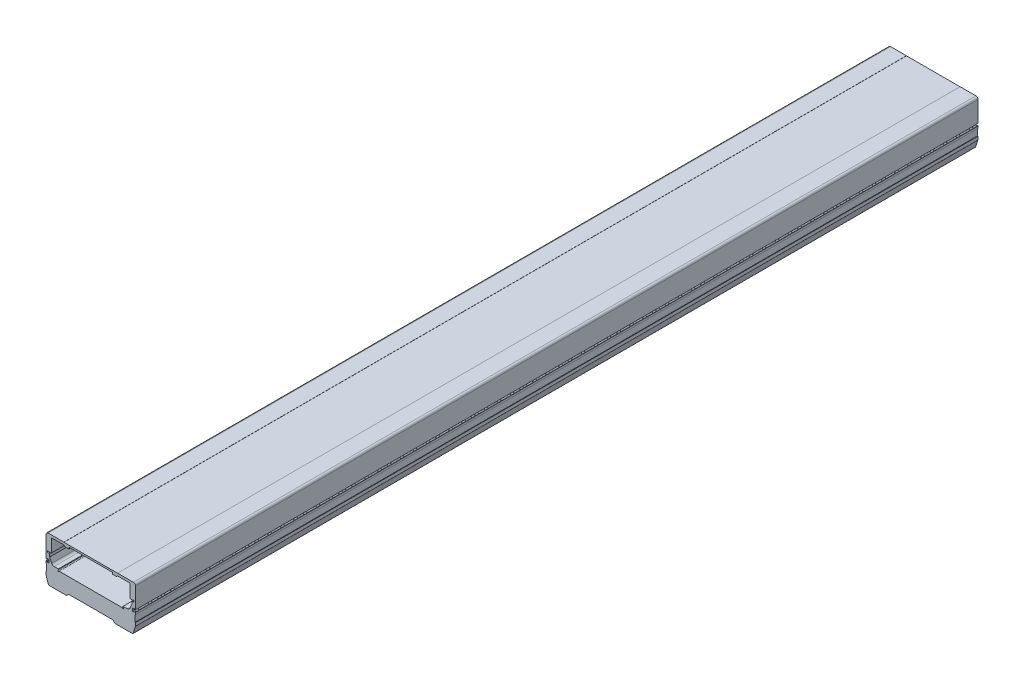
ISO-10303-21;
HEADER;
FILE_DESCRIPTION(('STEP AP214'),'2;1');
FILE_NAME('part.step','',(''),(''),'','','');
FILE_SCHEMA(('AUTOMOTIVE_DESIGN { 1 0 10303 214 1 1 1 1 }'));
ENDSEC;
DATA;
#1=APPLICATION_CONTEXT('core data for automotive mechanical design processes');
#2=APPLICATION_PROTOCOL_DEFINITION('international standard','automotive_design',2000,#1);
#3=PRODUCT_CONTEXT('',#1,'mechanical');
#4=PRODUCT('Part','Part','',(#3));
#5=PRODUCT_RELATED_PRODUCT_CATEGORY('part','',(#4));
#6=PRODUCT_DEFINITION_FORMATION('','',#4);
#7=PRODUCT_DEFINITION_CONTEXT('part definition',#1,'design');
#8=PRODUCT_DEFINITION('design','',#6,#7);
#9=PRODUCT_DEFINITION_SHAPE('','',#8);
#10=(LENGTH_UNIT() NAMED_UNIT(*) SI_UNIT(.MILLI.,.METRE.));
#11=(NAMED_UNIT(*) PLANE_ANGLE_UNIT() SI_UNIT($,.RADIAN.));
#12=(NAMED_UNIT(*) SI_UNIT($,.STERADIAN.) SOLID_ANGLE_UNIT());
#13=UNCERTAINTY_MEASURE_WITH_UNIT(LENGTH_MEASURE(1.E-05),#10,'distance_accuracy_value','');
#14=(GEOMETRIC_REPRESENTATION_CONTEXT(3) GLOBAL_UNCERTAINTY_ASSIGNED_CONTEXT((#13)) GLOBAL_UNIT_ASSIGNED_CONTEXT((#10,
#11,#12)) REPRESENTATION_CONTEXT('',''));
#15=CARTESIAN_POINT('',(0.,0.,0.));
#16=DIRECTION('',(0.,0.,1.));
#17=DIRECTION('',(1.,0.,0.));
#18=AXIS2_PLACEMENT_3D('',#15,#16,#17);
#19=CARTESIAN_POINT('',(-81.0000000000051,77.2999999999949,-1601.));
#20=DIRECTION('',(0.,0.,1.));
#21=DIRECTION('',(1.,0.,0.));
#22=AXIS2_PLACEMENT_3D('',#19,#20,#21);
#23=CYLINDRICAL_SURFACE('',#22,4.);
#24=CARTESIAN_POINT('',(-81.0000000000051,77.2999999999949,0.));
#25=DIRECTION('',(0.,0.,1.));
#26=DIRECTION('',(1.,0.,0.));
#27=AXIS2_PLACEMENT_3D('',#24,#25,#26);
#28=CIRCLE('',#27,4.);
#29=CARTESIAN_POINT('',(-81.0000000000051,81.299999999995,0.));
#30=VERTEX_POINT('',#29);
#31=CARTESIAN_POINT('',(-85.0000000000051,77.2999999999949,0.));
#32=VERTEX_POINT('',#31);
#33=EDGE_CURVE('E1019',#30,#32,#28,.T.);
#34=ORIENTED_EDGE('',*,*,#33,.F.);
#35=DIRECTION('',(0.,0.,1.));
#36=VECTOR('',#35,1.);
#37=CARTESIAN_POINT('',(-81.0000000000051,81.299999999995,-1601.));
#38=LINE('',#37,#36);
#39=CARTESIAN_POINT('',(-81.0000000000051,81.299999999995,-1601.));
#40=VERTEX_POINT('',#39);
#41=EDGE_CURVE('E11',#40,#30,#38,.T.);
#42=ORIENTED_EDGE('',*,*,#41,.F.);
#43=CARTESIAN_POINT('',(-81.0000000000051,77.2999999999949,-1601.));
#44=DIRECTION('',(0.,0.,1.));
#45=DIRECTION('',(1.,0.,0.));
#46=AXIS2_PLACEMENT_3D('',#43,#44,#45);
#47=CIRCLE('',#46,4.);
#48=CARTESIAN_POINT('',(-85.0000000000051,77.2999999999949,-1601.));
#49=VERTEX_POINT('',#48);
#50=EDGE_CURVE('E1093',#40,#49,#47,.T.);
#51=ORIENTED_EDGE('',*,*,#50,.T.);
#52=DIRECTION('',(0.,0.,1.));
#53=VECTOR('',#52,1.);
#54=CARTESIAN_POINT('',(-85.0000000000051,77.2999999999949,-1601.));
#55=LINE('',#54,#53);
#56=EDGE_CURVE('E39',#49,#32,#55,.T.);
#57=ORIENTED_EDGE('',*,*,#56,.T.);
#58=EDGE_LOOP('',(#34,#42,#51,#57));
#59=FACE_BOUND('',#58,.T.);
#60=ADVANCED_FACE('F36',(#59),#23,.T.);
#61=CARTESIAN_POINT('',(-51.0000000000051,81.299999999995,-1601.));
#62=DIRECTION('',(0.,1.,0.));
#63=DIRECTION('',(0.,0.,1.));
#64=AXIS2_PLACEMENT_3D('',#61,#62,#63);
#65=PLANE('',#64);
#66=DIRECTION('',(-1.,0.,0.));
#67=VECTOR('',#66,1.);
#68=CARTESIAN_POINT('',(-51.0000000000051,81.299999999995,0.));
#69=LINE('',#68,#67);
#70=CARTESIAN_POINT('',(-51.0000000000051,81.299999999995,0.));
#71=VERTEX_POINT('',#70);
#72=EDGE_CURVE('E1097',#71,#30,#69,.T.);
#73=ORIENTED_EDGE('',*,*,#72,.F.);
#74=DIRECTION('',(0.,0.,1.));
#75=VECTOR('',#74,1.);
#76=CARTESIAN_POINT('',(-51.0000000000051,81.299999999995,-1601.));
#77=LINE('',#76,#75);
#78=CARTESIAN_POINT('',(-51.0000000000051,81.299999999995,-1601.));
#79=VERTEX_POINT('',#78);
#80=EDGE_CURVE('E44',#79,#71,#77,.T.);
#81=ORIENTED_EDGE('',*,*,#80,.F.);
#82=DIRECTION('',(-1.,0.,0.));
#83=VECTOR('',#82,1.);
#84=CARTESIAN_POINT('',(-51.0000000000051,81.299999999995,-1601.));
#85=LINE('',#84,#83);
#86=EDGE_CURVE('E1271',#79,#40,#85,.T.);
#87=ORIENTED_EDGE('',*,*,#86,.T.);
#88=ORIENTED_EDGE('',*,*,#41,.T.);
#89=EDGE_LOOP('',(#73,#81,#87,#88));
#90=FACE_BOUND('',#89,.T.);
#91=ADVANCED_FACE('F1578',(#90),#65,.T.);
#92=CARTESIAN_POINT('',(-50.8689864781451,81.1689864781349,-1601.));
#93=DIRECTION('',(0.707106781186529,0.707106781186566,0.));
#94=DIRECTION('',(-0.707106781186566,0.707106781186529,0.));
#95=AXIS2_PLACEMENT_3D('',#92,#93,#94);
#96=PLANE('',#95);
#97=DIRECTION('',(-0.707106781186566,0.707106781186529,0.));
#98=VECTOR('',#97,1.);
#99=CARTESIAN_POINT('',(-50.8689864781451,81.1689864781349,0.));
#100=LINE('',#99,#98);
#101=CARTESIAN_POINT('',(-50.8689864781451,81.1689864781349,0.));
#102=VERTEX_POINT('',#101);
#103=EDGE_CURVE('E1447',#102,#71,#100,.T.);
#104=ORIENTED_EDGE('',*,*,#103,.F.);
#105=DIRECTION('',(0.,0.,1.));
#106=VECTOR('',#105,1.);
#107=CARTESIAN_POINT('',(-50.8689864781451,81.1689864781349,-1601.));
#108=LINE('',#107,#106);
#109=CARTESIAN_POINT('',(-50.8689864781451,81.1689864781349,-1601.));
#110=VERTEX_POINT('',#109);
#111=EDGE_CURVE('E1453',#110,#102,#108,.T.);
#112=ORIENTED_EDGE('',*,*,#111,.F.);
#113=DIRECTION('',(-0.707106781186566,0.707106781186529,0.));
#114=VECTOR('',#113,1.);
#115=CARTESIAN_POINT('',(-50.8689864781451,81.1689864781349,-1601.));
#116=LINE('',#115,#114);
#117=EDGE_CURVE('E1268',#110,#79,#116,.T.);
#118=ORIENTED_EDGE('',*,*,#117,.T.);
#119=ORIENTED_EDGE('',*,*,#80,.T.);
#120=EDGE_LOOP('',(#104,#112,#118,#119));
#121=FACE_BOUND('',#120,.T.);
#122=ADVANCED_FACE('F1807',(#121),#96,.T.);
#123=CARTESIAN_POINT('',(50.8689864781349,81.1689864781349,-1601.));
#124=DIRECTION('',(0.,1.,0.));
#125=DIRECTION('',(0.,0.,1.));
#126=AXIS2_PLACEMENT_3D('',#123,#124,#125);
#127=PLANE('',#126);
#128=DIRECTION('',(-1.,0.,0.));
#129=VECTOR('',#128,1.);
#130=CARTESIAN_POINT('',(50.8689864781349,81.1689864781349,0.));
#131=LINE('',#130,#129);
#132=CARTESIAN_POINT('',(50.8689864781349,81.1689864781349,0.));
#133=VERTEX_POINT('',#132);
#134=EDGE_CURVE('E1444',#133,#102,#131,.T.);
#135=ORIENTED_EDGE('',*,*,#134,.F.);
#136=DIRECTION('',(0.,0.,1.));
#137=VECTOR('',#136,1.);
#138=CARTESIAN_POINT('',(50.8689864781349,81.1689864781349,-1601.));
#139=LINE('',#138,#137);
#140=CARTESIAN_POINT('',(50.8689864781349,81.1689864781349,-1601.));
#141=VERTEX_POINT('',#140);
#142=EDGE_CURVE('E1455',#141,#133,#139,.T.);
#143=ORIENTED_EDGE('',*,*,#142,.F.);
#144=DIRECTION('',(-1.,0.,0.));
#145=VECTOR('',#144,1.);
#146=CARTESIAN_POINT('',(50.8689864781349,81.1689864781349,-1601.));
#147=LINE('',#146,#145);
#148=EDGE_CURVE('E1265',#141,#110,#147,.T.);
#149=ORIENTED_EDGE('',*,*,#148,.T.);
#150=ORIENTED_EDGE('',*,*,#111,.T.);
#151=EDGE_LOOP('',(#135,#143,#149,#150));
#152=FACE_BOUND('',#151,.T.);
#153=ADVANCED_FACE('F1804',(#152),#127,.T.);
#154=CARTESIAN_POINT('',(50.9999999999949,81.299999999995,-1601.));
#155=DIRECTION('',(-0.707106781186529,0.707106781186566,0.));
#156=DIRECTION('',(-0.707106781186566,-0.707106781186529,0.));
#157=AXIS2_PLACEMENT_3D('',#154,#155,#156);
#158=PLANE('',#157);
#159=DIRECTION('',(-0.707106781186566,-0.707106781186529,0.));
#160=VECTOR('',#159,1.);
#161=CARTESIAN_POINT('',(50.9999999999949,81.299999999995,0.));
#162=LINE('',#161,#160);
#163=CARTESIAN_POINT('',(50.9999999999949,81.299999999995,0.));
#164=VERTEX_POINT('',#163);
#165=EDGE_CURVE('E1441',#164,#133,#162,.T.);
#166=ORIENTED_EDGE('',*,*,#165,.F.);
#167=DIRECTION('',(0.,0.,1.));
#168=VECTOR('',#167,1.);
#169=CARTESIAN_POINT('',(50.9999999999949,81.299999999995,-1601.));
#170=LINE('',#169,#168);
#171=CARTESIAN_POINT('',(50.9999999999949,81.299999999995,-1601.));
#172=VERTEX_POINT('',#171);
#173=EDGE_CURVE('E1457',#172,#164,#170,.T.);
#174=ORIENTED_EDGE('',*,*,#173,.F.);
#175=DIRECTION('',(-0.707106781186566,-0.707106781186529,0.));
#176=VECTOR('',#175,1.);
#177=CARTESIAN_POINT('',(50.9999999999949,81.299999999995,-1601.));
#178=LINE('',#177,#176);
#179=EDGE_CURVE('E1262',#172,#141,#178,.T.);
#180=ORIENTED_EDGE('',*,*,#179,.T.);
#181=ORIENTED_EDGE('',*,*,#142,.T.);
#182=EDGE_LOOP('',(#166,#174,#180,#181));
#183=FACE_BOUND('',#182,.T.);
#184=ADVANCED_FACE('F1801',(#183),#158,.T.);
#185=CARTESIAN_POINT('',(80.9999999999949,81.299999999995,-1601.));
#186=DIRECTION('',(0.,1.,0.));
#187=DIRECTION('',(0.,0.,1.));
#188=AXIS2_PLACEMENT_3D('',#185,#186,#187);
#189=PLANE('',#188);
#190=DIRECTION('',(-1.,0.,0.));
#191=VECTOR('',#190,1.);
#192=CARTESIAN_POINT('',(80.9999999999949,81.299999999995,0.));
#193=LINE('',#192,#191);
#194=CARTESIAN_POINT('',(80.9999999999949,81.299999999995,0.));
#195=VERTEX_POINT('',#194);
#196=EDGE_CURVE('E1438',#195,#164,#193,.T.);
#197=ORIENTED_EDGE('',*,*,#196,.F.);
#198=DIRECTION('',(0.,0.,1.));
#199=VECTOR('',#198,1.);
#200=CARTESIAN_POINT('',(80.9999999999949,81.299999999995,-1601.));
#201=LINE('',#200,#199);
#202=CARTESIAN_POINT('',(80.9999999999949,81.299999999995,-1601.));
#203=VERTEX_POINT('',#202);
#204=EDGE_CURVE('E1459',#203,#195,#201,.T.);
#205=ORIENTED_EDGE('',*,*,#204,.F.);
#206=DIRECTION('',(-1.,0.,0.));
#207=VECTOR('',#206,1.);
#208=CARTESIAN_POINT('',(80.9999999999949,81.299999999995,-1601.));
#209=LINE('',#208,#207);
#210=EDGE_CURVE('E1259',#203,#172,#209,.T.);
#211=ORIENTED_EDGE('',*,*,#210,.T.);
#212=ORIENTED_EDGE('',*,*,#173,.T.);
#213=EDGE_LOOP('',(#197,#205,#211,#212));
#214=FACE_BOUND('',#213,.T.);
#215=ADVANCED_FACE('F1797',(#214),#189,.T.);
#216=CARTESIAN_POINT('',(80.9999999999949,77.2999999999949,-1601.));
#217=DIRECTION('',(0.,0.,1.));
#218=DIRECTION('',(1.,0.,0.));
#219=AXIS2_PLACEMENT_3D('',#216,#217,#218);
#220=CYLINDRICAL_SURFACE('',#219,4.);
#221=CARTESIAN_POINT('',(80.9999999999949,77.2999999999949,0.));
#222=DIRECTION('',(0.,0.,1.));
#223=DIRECTION('',(1.,0.,0.));
#224=AXIS2_PLACEMENT_3D('',#221,#222,#223);
#225=CIRCLE('',#224,4.);
#226=CARTESIAN_POINT('',(84.9999999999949,77.2999999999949,0.));
#227=VERTEX_POINT('',#226);
#228=EDGE_CURVE('E1435',#227,#195,#225,.T.);
#229=ORIENTED_EDGE('',*,*,#228,.F.);
#230=DIRECTION('',(0.,0.,1.));
#231=VECTOR('',#230,1.);
#232=CARTESIAN_POINT('',(84.9999999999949,77.2999999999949,-1601.));
#233=LINE('',#232,#231);
#234=CARTESIAN_POINT('',(84.9999999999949,77.2999999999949,-1601.));
#235=VERTEX_POINT('',#234);
#236=EDGE_CURVE('E1461',#235,#227,#233,.T.);
#237=ORIENTED_EDGE('',*,*,#236,.F.);
#238=CARTESIAN_POINT('',(80.9999999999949,77.2999999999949,-1601.));
#239=DIRECTION('',(0.,0.,1.));
#240=DIRECTION('',(1.,0.,0.));
#241=AXIS2_PLACEMENT_3D('',#238,#239,#240);
#242=CIRCLE('',#241,4.);
#243=EDGE_CURVE('E1256',#235,#203,#242,.T.);
#244=ORIENTED_EDGE('',*,*,#243,.T.);
#245=ORIENTED_EDGE('',*,*,#204,.T.);
#246=EDGE_LOOP('',(#229,#237,#244,#245));
#247=FACE_BOUND('',#246,.T.);
#248=ADVANCED_FACE('F1793',(#247),#220,.T.);
#249=CARTESIAN_POINT('',(84.9999999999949,37.8999999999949,-1601.));
#250=DIRECTION('',(1.,0.,0.));
#251=DIRECTION('',(0.,0.,-1.));
#252=AXIS2_PLACEMENT_3D('',#249,#250,#251);
#253=PLANE('',#252);
#254=DIRECTION('',(0.,1.,0.));
#255=VECTOR('',#254,1.);
#256=CARTESIAN_POINT('',(84.9999999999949,37.8999999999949,0.));
#257=LINE('',#256,#255);
#258=CARTESIAN_POINT('',(84.9999999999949,37.8999999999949,0.));
#259=VERTEX_POINT('',#258);
#260=EDGE_CURVE('E1432',#259,#227,#257,.T.);
#261=ORIENTED_EDGE('',*,*,#260,.F.);
#262=DIRECTION('',(0.,0.,1.));
#263=VECTOR('',#262,1.);
#264=CARTESIAN_POINT('',(84.9999999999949,37.8999999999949,-1601.));
#265=LINE('',#264,#263);
#266=CARTESIAN_POINT('',(84.9999999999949,37.8999999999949,-1601.));
#267=VERTEX_POINT('',#266);
#268=EDGE_CURVE('E1463',#267,#259,#265,.T.);
#269=ORIENTED_EDGE('',*,*,#268,.F.);
#270=DIRECTION('',(0.,1.,0.));
#271=VECTOR('',#270,1.);
#272=CARTESIAN_POINT('',(84.9999999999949,37.8999999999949,-1601.));
#273=LINE('',#272,#271);
#274=EDGE_CURVE('E1253',#267,#235,#273,.T.);
#275=ORIENTED_EDGE('',*,*,#274,.T.);
#276=ORIENTED_EDGE('',*,*,#236,.T.);
#277=EDGE_LOOP('',(#261,#269,#275,#276));
#278=FACE_BOUND('',#277,.T.);
#279=ADVANCED_FACE('F1789',(#278),#253,.T.);
#280=CARTESIAN_POINT('',(84.6999999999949,37.8999999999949,-1601.));
#281=DIRECTION('',(0.,0.,1.));
#282=DIRECTION('',(1.,0.,0.));
#283=AXIS2_PLACEMENT_3D('',#280,#281,#282);
#284=CYLINDRICAL_SURFACE('',#283,0.29999999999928);
#285=CARTESIAN_POINT('',(84.6999999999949,37.8999999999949,0.));
#286=DIRECTION('',(0.,0.,1.));
#287=DIRECTION('',(1.,0.,0.));
#288=AXIS2_PLACEMENT_3D('',#285,#286,#287);
#289=CIRCLE('',#288,0.29999999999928);
#290=CARTESIAN_POINT('',(84.7000000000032,37.5999999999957,0.));
#291=VERTEX_POINT('',#290);
#292=EDGE_CURVE('E1429',#291,#259,#289,.T.);
#293=ORIENTED_EDGE('',*,*,#292,.F.);
#294=DIRECTION('',(0.,0.,1.));
#295=VECTOR('',#294,1.);
#296=CARTESIAN_POINT('',(84.7000000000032,37.5999999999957,-1601.));
#297=LINE('',#296,#295);
#298=CARTESIAN_POINT('',(84.7000000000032,37.5999999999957,-1601.));
#299=VERTEX_POINT('',#298);
#300=EDGE_CURVE('E1465',#299,#291,#297,.T.);
#301=ORIENTED_EDGE('',*,*,#300,.F.);
#302=CARTESIAN_POINT('',(84.6999999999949,37.8999999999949,-1601.));
#303=DIRECTION('',(0.,0.,1.));
#304=DIRECTION('',(1.,0.,0.));
#305=AXIS2_PLACEMENT_3D('',#302,#303,#304);
#306=CIRCLE('',#305,0.29999999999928);
#307=EDGE_CURVE('E1250',#299,#267,#306,.T.);
#308=ORIENTED_EDGE('',*,*,#307,.T.);
#309=ORIENTED_EDGE('',*,*,#268,.T.);
#310=EDGE_LOOP('',(#293,#301,#308,#309));
#311=FACE_BOUND('',#310,.T.);
#312=ADVANCED_FACE('F1785',(#311),#284,.T.);
#313=CARTESIAN_POINT('',(83.3000000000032,37.5999999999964,-1601.));
#314=DIRECTION('',(0.,-1.,0.));
#315=DIRECTION('',(0.,0.,-1.));
#316=AXIS2_PLACEMENT_3D('',#313,#314,#315);
#317=PLANE('',#316);
#318=DIRECTION('',(1.,0.,0.));
#319=VECTOR('',#318,1.);
#320=CARTESIAN_POINT('',(83.3000000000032,37.5999999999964,0.));
#321=LINE('',#320,#319);
#322=CARTESIAN_POINT('',(83.3000000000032,37.5999999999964,0.));
#323=VERTEX_POINT('',#322);
#324=EDGE_CURVE('E1426',#323,#291,#321,.T.);
#325=ORIENTED_EDGE('',*,*,#324,.F.);
#326=DIRECTION('',(0.,0.,1.));
#327=VECTOR('',#326,1.);
#328=CARTESIAN_POINT('',(83.3000000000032,37.5999999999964,-1601.));
#329=LINE('',#328,#327);
#330=CARTESIAN_POINT('',(83.3000000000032,37.5999999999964,-1601.));
#331=VERTEX_POINT('',#330);
#332=EDGE_CURVE('E1467',#331,#323,#329,.T.);
#333=ORIENTED_EDGE('',*,*,#332,.F.);
#334=DIRECTION('',(1.,0.,0.));
#335=VECTOR('',#334,1.);
#336=CARTESIAN_POINT('',(83.3000000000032,37.5999999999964,-1601.));
#337=LINE('',#336,#335);
#338=EDGE_CURVE('E1247',#331,#299,#337,.T.);
#339=ORIENTED_EDGE('',*,*,#338,.T.);
#340=ORIENTED_EDGE('',*,*,#300,.T.);
#341=EDGE_LOOP('',(#325,#333,#339,#340));
#342=FACE_BOUND('',#341,.T.);
#343=ADVANCED_FACE('F1781',(#342),#317,.T.);
#344=CARTESIAN_POINT('',(83.3000000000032,37.8999999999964,-1601.));
#345=DIRECTION('',(0.,0.,1.));
#346=DIRECTION('',(1.,0.,0.));
#347=AXIS2_PLACEMENT_3D('',#344,#345,#346);
#348=CYLINDRICAL_SURFACE('',#347,0.299999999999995);
#349=CARTESIAN_POINT('',(83.3000000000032,37.8999999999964,0.));
#350=DIRECTION('',(0.,0.,1.));
#351=DIRECTION('',(1.,0.,0.));
#352=AXIS2_PLACEMENT_3D('',#349,#350,#351);
#353=CIRCLE('',#352,0.299999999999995);
#354=CARTESIAN_POINT('',(83.0000000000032,37.8999999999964,0.));
#355=VERTEX_POINT('',#354);
#356=EDGE_CURVE('E1423',#355,#323,#353,.T.);
#357=ORIENTED_EDGE('',*,*,#356,.F.);
#358=DIRECTION('',(0.,0.,1.));
#359=VECTOR('',#358,1.);
#360=CARTESIAN_POINT('',(83.0000000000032,37.8999999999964,-1601.));
#361=LINE('',#360,#359);
#362=CARTESIAN_POINT('',(83.0000000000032,37.8999999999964,-1601.));
#363=VERTEX_POINT('',#362);
#364=EDGE_CURVE('E1469',#363,#355,#361,.T.);
#365=ORIENTED_EDGE('',*,*,#364,.F.);
#366=CARTESIAN_POINT('',(83.3000000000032,37.8999999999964,-1601.));
#367=DIRECTION('',(0.,0.,1.));
#368=DIRECTION('',(1.,0.,0.));
#369=AXIS2_PLACEMENT_3D('',#366,#367,#368);
#370=CIRCLE('',#369,0.299999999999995);
#371=EDGE_CURVE('E1244',#363,#331,#370,.T.);
#372=ORIENTED_EDGE('',*,*,#371,.T.);
#373=ORIENTED_EDGE('',*,*,#332,.T.);
#374=EDGE_LOOP('',(#357,#365,#372,#373));
#375=FACE_BOUND('',#374,.T.);
#376=ADVANCED_FACE('F1777',(#375),#348,.T.);
#377=CARTESIAN_POINT('',(83.0000000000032,38.3999999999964,-1601.));
#378=DIRECTION('',(-1.,0.,0.));
#379=DIRECTION('',(0.,0.,1.));
#380=AXIS2_PLACEMENT_3D('',#377,#378,#379);
#381=PLANE('',#380);
#382=DIRECTION('',(0.,-1.,0.));
#383=VECTOR('',#382,1.);
#384=CARTESIAN_POINT('',(83.0000000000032,38.3999999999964,0.));
#385=LINE('',#384,#383);
#386=CARTESIAN_POINT('',(83.0000000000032,38.3999999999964,0.));
#387=VERTEX_POINT('',#386);
#388=EDGE_CURVE('E1420',#387,#355,#385,.T.);
#389=ORIENTED_EDGE('',*,*,#388,.F.);
#390=DIRECTION('',(0.,0.,1.));
#391=VECTOR('',#390,1.);
#392=CARTESIAN_POINT('',(83.0000000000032,38.3999999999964,-1601.));
#393=LINE('',#392,#391);
#394=CARTESIAN_POINT('',(83.0000000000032,38.3999999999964,-1601.));
#395=VERTEX_POINT('',#394);
#396=EDGE_CURVE('E1471',#395,#387,#393,.T.);
#397=ORIENTED_EDGE('',*,*,#396,.F.);
#398=DIRECTION('',(0.,-1.,0.));
#399=VECTOR('',#398,1.);
#400=CARTESIAN_POINT('',(83.0000000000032,38.3999999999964,-1601.));
#401=LINE('',#400,#399);
#402=EDGE_CURVE('E1241',#395,#363,#401,.T.);
#403=ORIENTED_EDGE('',*,*,#402,.T.);
#404=ORIENTED_EDGE('',*,*,#364,.T.);
#405=EDGE_LOOP('',(#389,#397,#403,#404));
#406=FACE_BOUND('',#405,.T.);
#407=ADVANCED_FACE('F1773',(#406),#381,.T.);
#408=CARTESIAN_POINT('',(82.7000000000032,38.3999999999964,-1601.));
#409=DIRECTION('',(0.,0.,1.));
#410=DIRECTION('',(1.,0.,0.));
#411=AXIS2_PLACEMENT_3D('',#408,#409,#410);
#412=CYLINDRICAL_SURFACE('',#411,0.299999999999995);
#413=CARTESIAN_POINT('',(82.7000000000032,38.3999999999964,0.));
#414=DIRECTION('',(0.,0.,-1.));
#415=DIRECTION('',(1.,0.,0.));
#416=AXIS2_PLACEMENT_3D('',#413,#414,#415);
#417=CIRCLE('',#416,0.299999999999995);
#418=CARTESIAN_POINT('',(82.7000000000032,38.6999999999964,0.));
#419=VERTEX_POINT('',#418);
#420=EDGE_CURVE('E1417',#419,#387,#417,.T.);
#421=ORIENTED_EDGE('',*,*,#420,.F.);
#422=DIRECTION('',(0.,0.,1.));
#423=VECTOR('',#422,1.);
#424=CARTESIAN_POINT('',(82.7000000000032,38.6999999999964,-1601.));
#425=LINE('',#424,#423);
#426=CARTESIAN_POINT('',(82.7000000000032,38.6999999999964,-1601.));
#427=VERTEX_POINT('',#426);
#428=EDGE_CURVE('E1473',#427,#419,#425,.T.);
#429=ORIENTED_EDGE('',*,*,#428,.F.);
#430=CARTESIAN_POINT('',(82.7000000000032,38.3999999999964,-1601.));
#431=DIRECTION('',(0.,0.,-1.));
#432=DIRECTION('',(1.,0.,0.));
#433=AXIS2_PLACEMENT_3D('',#430,#431,#432);
#434=CIRCLE('',#433,0.299999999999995);
#435=EDGE_CURVE('E1238',#427,#395,#434,.T.);
#436=ORIENTED_EDGE('',*,*,#435,.T.);
#437=ORIENTED_EDGE('',*,*,#396,.T.);
#438=EDGE_LOOP('',(#421,#429,#436,#437));
#439=FACE_BOUND('',#438,.T.);
#440=ADVANCED_FACE('F1769',(#439),#412,.F.);
#441=CARTESIAN_POINT('',(80.2000000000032,38.6999999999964,-1601.));
#442=DIRECTION('',(0.,-1.,0.));
#443=DIRECTION('',(0.,0.,-1.));
#444=AXIS2_PLACEMENT_3D('',#441,#442,#443);
#445=PLANE('',#444);
#446=DIRECTION('',(1.,0.,0.));
#447=VECTOR('',#446,1.);
#448=CARTESIAN_POINT('',(80.2000000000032,38.6999999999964,0.));
#449=LINE('',#448,#447);
#450=CARTESIAN_POINT('',(80.2000000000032,38.6999999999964,0.));
#451=VERTEX_POINT('',#450);
#452=EDGE_CURVE('E1414',#451,#419,#449,.T.);
#453=ORIENTED_EDGE('',*,*,#452,.F.);
#454=DIRECTION('',(0.,0.,1.));
#455=VECTOR('',#454,1.);
#456=CARTESIAN_POINT('',(80.2000000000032,38.6999999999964,-1601.));
#457=LINE('',#456,#455);
#458=CARTESIAN_POINT('',(80.2000000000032,38.6999999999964,-1601.));
#459=VERTEX_POINT('',#458);
#460=EDGE_CURVE('E1475',#459,#451,#457,.T.);
#461=ORIENTED_EDGE('',*,*,#460,.F.);
#462=DIRECTION('',(1.,0.,0.));
#463=VECTOR('',#462,1.);
#464=CARTESIAN_POINT('',(80.2000000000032,38.6999999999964,-1601.));
#465=LINE('',#464,#463);
#466=EDGE_CURVE('E1235',#459,#427,#465,.T.);
#467=ORIENTED_EDGE('',*,*,#466,.T.);
#468=ORIENTED_EDGE('',*,*,#428,.T.);
#469=EDGE_LOOP('',(#453,#461,#467,#468));
#470=FACE_BOUND('',#469,.T.);
#471=ADVANCED_FACE('F1765',(#470),#445,.T.);
#472=CARTESIAN_POINT('',(80.2000000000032,37.6999999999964,-1601.));
#473=DIRECTION('',(0.,0.,1.));
#474=DIRECTION('',(1.,0.,0.));
#475=AXIS2_PLACEMENT_3D('',#472,#473,#474);
#476=CYLINDRICAL_SURFACE('',#475,1.);
#477=CARTESIAN_POINT('',(80.2000000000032,37.6999999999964,0.));
#478=DIRECTION('',(0.,0.,-1.));
#479=DIRECTION('',(1.,0.,0.));
#480=AXIS2_PLACEMENT_3D('',#477,#478,#479);
#481=CIRCLE('',#480,1.);
#482=CARTESIAN_POINT('',(79.2000000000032,37.6999999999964,0.));
#483=VERTEX_POINT('',#482);
#484=EDGE_CURVE('E1411',#483,#451,#481,.T.);
#485=ORIENTED_EDGE('',*,*,#484,.F.);
#486=DIRECTION('',(0.,0.,1.));
#487=VECTOR('',#486,1.);
#488=CARTESIAN_POINT('',(79.2000000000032,37.6999999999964,-1601.));
#489=LINE('',#488,#487);
#490=CARTESIAN_POINT('',(79.2000000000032,37.6999999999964,-1601.));
#491=VERTEX_POINT('',#490);
#492=EDGE_CURVE('E1477',#491,#483,#489,.T.);
#493=ORIENTED_EDGE('',*,*,#492,.F.);
#494=CARTESIAN_POINT('',(80.2000000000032,37.6999999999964,-1601.));
#495=DIRECTION('',(0.,0.,-1.));
#496=DIRECTION('',(1.,0.,0.));
#497=AXIS2_PLACEMENT_3D('',#494,#495,#496);
#498=CIRCLE('',#497,1.);
#499=EDGE_CURVE('E1232',#491,#459,#498,.T.);
#500=ORIENTED_EDGE('',*,*,#499,.T.);
#501=ORIENTED_EDGE('',*,*,#460,.T.);
#502=EDGE_LOOP('',(#485,#493,#500,#501));
#503=FACE_BOUND('',#502,.T.);
#504=ADVANCED_FACE('F1761',(#503),#476,.F.);
#505=CARTESIAN_POINT('',(79.2000000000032,33.8999999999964,-1601.));
#506=DIRECTION('',(1.,0.,0.));
#507=DIRECTION('',(0.,0.,-1.));
#508=AXIS2_PLACEMENT_3D('',#505,#506,#507);
#509=PLANE('',#508);
#510=DIRECTION('',(0.,1.,0.));
#511=VECTOR('',#510,1.);
#512=CARTESIAN_POINT('',(79.2000000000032,33.8999999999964,0.));
#513=LINE('',#512,#511);
#514=CARTESIAN_POINT('',(79.2000000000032,33.8999999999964,0.));
#515=VERTEX_POINT('',#514);
#516=EDGE_CURVE('E1408',#515,#483,#513,.T.);
#517=ORIENTED_EDGE('',*,*,#516,.F.);
#518=DIRECTION('',(0.,0.,1.));
#519=VECTOR('',#518,1.);
#520=CARTESIAN_POINT('',(79.2000000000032,33.8999999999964,-1601.));
#521=LINE('',#520,#519);
#522=CARTESIAN_POINT('',(79.2000000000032,33.8999999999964,-1601.));
#523=VERTEX_POINT('',#522);
#524=EDGE_CURVE('E1479',#523,#515,#521,.T.);
#525=ORIENTED_EDGE('',*,*,#524,.F.);
#526=DIRECTION('',(0.,1.,0.));
#527=VECTOR('',#526,1.);
#528=CARTESIAN_POINT('',(79.2000000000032,33.8999999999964,-1601.));
#529=LINE('',#528,#527);
#530=EDGE_CURVE('E1229',#523,#491,#529,.T.);
#531=ORIENTED_EDGE('',*,*,#530,.T.);
#532=ORIENTED_EDGE('',*,*,#492,.T.);
#533=EDGE_LOOP('',(#517,#525,#531,#532));
#534=FACE_BOUND('',#533,.T.);
#535=ADVANCED_FACE('F1757',(#534),#509,.T.);
#536=CARTESIAN_POINT('',(80.2000000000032,33.8999999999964,-1601.));
#537=DIRECTION('',(0.,0.,1.));
#538=DIRECTION('',(1.,0.,0.));
#539=AXIS2_PLACEMENT_3D('',#536,#537,#538);
#540=CYLINDRICAL_SURFACE('',#539,0.999999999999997);
#541=CARTESIAN_POINT('',(80.2000000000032,33.8999999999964,0.));
#542=DIRECTION('',(0.,0.,-1.));
#543=DIRECTION('',(1.,0.,0.));
#544=AXIS2_PLACEMENT_3D('',#541,#542,#543);
#545=CIRCLE('',#544,0.999999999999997);
#546=CARTESIAN_POINT('',(80.2000000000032,32.8999999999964,0.));
#547=VERTEX_POINT('',#546);
#548=EDGE_CURVE('E1405',#547,#515,#545,.T.);
#549=ORIENTED_EDGE('',*,*,#548,.F.);
#550=DIRECTION('',(0.,0.,1.));
#551=VECTOR('',#550,1.);
#552=CARTESIAN_POINT('',(80.2000000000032,32.8999999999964,-1601.));
#553=LINE('',#552,#551);
#554=CARTESIAN_POINT('',(80.2000000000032,32.8999999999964,-1601.));
#555=VERTEX_POINT('',#554);
#556=EDGE_CURVE('E1481',#555,#547,#553,.T.);
#557=ORIENTED_EDGE('',*,*,#556,.F.);
#558=CARTESIAN_POINT('',(80.2000000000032,33.8999999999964,-1601.));
#559=DIRECTION('',(0.,0.,-1.));
#560=DIRECTION('',(1.,0.,0.));
#561=AXIS2_PLACEMENT_3D('',#558,#559,#560);
#562=CIRCLE('',#561,0.999999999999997);
#563=EDGE_CURVE('E1226',#555,#523,#562,.T.);
#564=ORIENTED_EDGE('',*,*,#563,.T.);
#565=ORIENTED_EDGE('',*,*,#524,.T.);
#566=EDGE_LOOP('',(#549,#557,#564,#565));
#567=FACE_BOUND('',#566,.T.);
#568=ADVANCED_FACE('F1753',(#567),#540,.F.);
#569=CARTESIAN_POINT('',(82.7000000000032,32.8999999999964,-1601.));
#570=DIRECTION('',(0.,1.,0.));
#571=DIRECTION('',(0.,0.,1.));
#572=AXIS2_PLACEMENT_3D('',#569,#570,#571);
#573=PLANE('',#572);
#574=DIRECTION('',(-1.,0.,0.));
#575=VECTOR('',#574,1.);
#576=CARTESIAN_POINT('',(82.7000000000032,32.8999999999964,0.));
#577=LINE('',#576,#575);
#578=CARTESIAN_POINT('',(82.7000000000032,32.8999999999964,0.));
#579=VERTEX_POINT('',#578);
#580=EDGE_CURVE('E1402',#579,#547,#577,.T.);
#581=ORIENTED_EDGE('',*,*,#580,.F.);
#582=DIRECTION('',(0.,0.,1.));
#583=VECTOR('',#582,1.);
#584=CARTESIAN_POINT('',(82.7000000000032,32.8999999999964,-1601.));
#585=LINE('',#584,#583);
#586=CARTESIAN_POINT('',(82.7000000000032,32.8999999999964,-1601.));
#587=VERTEX_POINT('',#586);
#588=EDGE_CURVE('E1483',#587,#579,#585,.T.);
#589=ORIENTED_EDGE('',*,*,#588,.F.);
#590=DIRECTION('',(-1.,0.,0.));
#591=VECTOR('',#590,1.);
#592=CARTESIAN_POINT('',(82.7000000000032,32.8999999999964,-1601.));
#593=LINE('',#592,#591);
#594=EDGE_CURVE('E1223',#587,#555,#593,.T.);
#595=ORIENTED_EDGE('',*,*,#594,.T.);
#596=ORIENTED_EDGE('',*,*,#556,.T.);
#597=EDGE_LOOP('',(#581,#589,#595,#596));
#598=FACE_BOUND('',#597,.T.);
#599=ADVANCED_FACE('F1749',(#598),#573,.T.);
#600=CARTESIAN_POINT('',(82.7000000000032,33.1999999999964,-1601.));
#601=DIRECTION('',(0.,0.,1.));
#602=DIRECTION('',(1.,0.,0.));
#603=AXIS2_PLACEMENT_3D('',#600,#601,#602);
#604=CYLINDRICAL_SURFACE('',#603,0.299999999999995);
#605=CARTESIAN_POINT('',(82.7000000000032,33.1999999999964,0.));
#606=DIRECTION('',(0.,0.,-1.));
#607=DIRECTION('',(1.,0.,0.));
#608=AXIS2_PLACEMENT_3D('',#605,#606,#607);
#609=CIRCLE('',#608,0.299999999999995);
#610=CARTESIAN_POINT('',(83.0000000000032,33.1999999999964,0.));
#611=VERTEX_POINT('',#610);
#612=EDGE_CURVE('E1399',#611,#579,#609,.T.);
#613=ORIENTED_EDGE('',*,*,#612,.F.);
#614=DIRECTION('',(0.,0.,1.));
#615=VECTOR('',#614,1.);
#616=CARTESIAN_POINT('',(83.0000000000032,33.1999999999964,-1601.));
#617=LINE('',#616,#615);
#618=CARTESIAN_POINT('',(83.0000000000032,33.1999999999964,-1601.));
#619=VERTEX_POINT('',#618);
#620=EDGE_CURVE('E1485',#619,#611,#617,.T.);
#621=ORIENTED_EDGE('',*,*,#620,.F.);
#622=CARTESIAN_POINT('',(82.7000000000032,33.1999999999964,-1601.));
#623=DIRECTION('',(0.,0.,-1.));
#624=DIRECTION('',(1.,0.,0.));
#625=AXIS2_PLACEMENT_3D('',#622,#623,#624);
#626=CIRCLE('',#625,0.299999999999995);
#627=EDGE_CURVE('E1220',#619,#587,#626,.T.);
#628=ORIENTED_EDGE('',*,*,#627,.T.);
#629=ORIENTED_EDGE('',*,*,#588,.T.);
#630=EDGE_LOOP('',(#613,#621,#628,#629));
#631=FACE_BOUND('',#630,.T.);
#632=ADVANCED_FACE('F1745',(#631),#604,.F.);
#633=CARTESIAN_POINT('',(83.0000000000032,33.6999999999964,-1601.));
#634=DIRECTION('',(-1.,0.,0.));
#635=DIRECTION('',(0.,0.,1.));
#636=AXIS2_PLACEMENT_3D('',#633,#634,#635);
#637=PLANE('',#636);
#638=DIRECTION('',(0.,-1.,0.));
#639=VECTOR('',#638,1.);
#640=CARTESIAN_POINT('',(83.0000000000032,33.6999999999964,0.));
#641=LINE('',#640,#639);
#642=CARTESIAN_POINT('',(83.0000000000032,33.6999999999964,0.));
#643=VERTEX_POINT('',#642);
#644=EDGE_CURVE('E1396',#643,#611,#641,.T.);
#645=ORIENTED_EDGE('',*,*,#644,.F.);
#646=DIRECTION('',(0.,0.,1.));
#647=VECTOR('',#646,1.);
#648=CARTESIAN_POINT('',(83.0000000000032,33.6999999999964,-1601.));
#649=LINE('',#648,#647);
#650=CARTESIAN_POINT('',(83.0000000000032,33.6999999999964,-1601.));
#651=VERTEX_POINT('',#650);
#652=EDGE_CURVE('E1487',#651,#643,#649,.T.);
#653=ORIENTED_EDGE('',*,*,#652,.F.);
#654=DIRECTION('',(0.,-1.,0.));
#655=VECTOR('',#654,1.);
#656=CARTESIAN_POINT('',(83.0000000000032,33.6999999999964,-1601.));
#657=LINE('',#656,#655);
#658=EDGE_CURVE('E1217',#651,#619,#657,.T.);
#659=ORIENTED_EDGE('',*,*,#658,.T.);
#660=ORIENTED_EDGE('',*,*,#620,.T.);
#661=EDGE_LOOP('',(#645,#653,#659,#660));
#662=FACE_BOUND('',#661,.T.);
#663=ADVANCED_FACE('F1741',(#662),#637,.T.);
#664=CARTESIAN_POINT('',(83.3000000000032,33.6999999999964,-1601.));
#665=DIRECTION('',(0.,0.,1.));
#666=DIRECTION('',(1.,0.,0.));
#667=AXIS2_PLACEMENT_3D('',#664,#665,#666);
#668=CYLINDRICAL_SURFACE('',#667,0.299999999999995);
#669=CARTESIAN_POINT('',(83.3000000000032,33.6999999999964,0.));
#670=DIRECTION('',(0.,0.,1.));
#671=DIRECTION('',(1.,0.,0.));
#672=AXIS2_PLACEMENT_3D('',#669,#670,#671);
#673=CIRCLE('',#672,0.299999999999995);
#674=CARTESIAN_POINT('',(83.3000000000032,33.9999999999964,0.));
#675=VERTEX_POINT('',#674);
#676=EDGE_CURVE('E1393',#675,#643,#673,.T.);
#677=ORIENTED_EDGE('',*,*,#676,.F.);
#678=DIRECTION('',(0.,0.,1.));
#679=VECTOR('',#678,1.);
#680=CARTESIAN_POINT('',(83.3000000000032,33.9999999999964,-1601.));
#681=LINE('',#680,#679);
#682=CARTESIAN_POINT('',(83.3000000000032,33.9999999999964,-1601.));
#683=VERTEX_POINT('',#682);
#684=EDGE_CURVE('E1489',#683,#675,#681,.T.);
#685=ORIENTED_EDGE('',*,*,#684,.F.);
#686=CARTESIAN_POINT('',(83.3000000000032,33.6999999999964,-1601.));
#687=DIRECTION('',(0.,0.,1.));
#688=DIRECTION('',(1.,0.,0.));
#689=AXIS2_PLACEMENT_3D('',#686,#687,#688);
#690=CIRCLE('',#689,0.299999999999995);
#691=EDGE_CURVE('E1214',#683,#651,#690,.T.);
#692=ORIENTED_EDGE('',*,*,#691,.T.);
#693=ORIENTED_EDGE('',*,*,#652,.T.);
#694=EDGE_LOOP('',(#677,#685,#692,#693));
#695=FACE_BOUND('',#694,.T.);
#696=ADVANCED_FACE('F1737',(#695),#668,.T.);
#697=CARTESIAN_POINT('',(84.7000000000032,33.9999999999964,-1601.));
#698=DIRECTION('',(0.,1.,0.));
#699=DIRECTION('',(0.,0.,1.));
#700=AXIS2_PLACEMENT_3D('',#697,#698,#699);
#701=PLANE('',#700);
#702=DIRECTION('',(-1.,0.,0.));
#703=VECTOR('',#702,1.);
#704=CARTESIAN_POINT('',(84.7000000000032,33.9999999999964,0.));
#705=LINE('',#704,#703);
#706=CARTESIAN_POINT('',(84.7000000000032,33.9999999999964,0.));
#707=VERTEX_POINT('',#706);
#708=EDGE_CURVE('E1390',#707,#675,#705,.T.);
#709=ORIENTED_EDGE('',*,*,#708,.F.);
#710=DIRECTION('',(0.,0.,1.));
#711=VECTOR('',#710,1.);
#712=CARTESIAN_POINT('',(84.7000000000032,33.9999999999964,-1601.));
#713=LINE('',#712,#711);
#714=CARTESIAN_POINT('',(84.7000000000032,33.9999999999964,-1601.));
#715=VERTEX_POINT('',#714);
#716=EDGE_CURVE('E1491',#715,#707,#713,.T.);
#717=ORIENTED_EDGE('',*,*,#716,.F.);
#718=DIRECTION('',(-1.,0.,0.));
#719=VECTOR('',#718,1.);
#720=CARTESIAN_POINT('',(84.7000000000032,33.9999999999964,-1601.));
#721=LINE('',#720,#719);
#722=EDGE_CURVE('E1211',#715,#683,#721,.T.);
#723=ORIENTED_EDGE('',*,*,#722,.T.);
#724=ORIENTED_EDGE('',*,*,#684,.T.);
#725=EDGE_LOOP('',(#709,#717,#723,#724));
#726=FACE_BOUND('',#725,.T.);
#727=ADVANCED_FACE('F1733',(#726),#701,.T.);
#728=CARTESIAN_POINT('',(84.7000000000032,33.6999999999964,-1601.));
#729=DIRECTION('',(0.,0.,1.));
#730=DIRECTION('',(1.,0.,0.));
#731=AXIS2_PLACEMENT_3D('',#728,#729,#730);
#732=CYLINDRICAL_SURFACE('',#731,0.299999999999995);
#733=CARTESIAN_POINT('',(84.7000000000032,33.6999999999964,0.));
#734=DIRECTION('',(0.,0.,1.));
#735=DIRECTION('',(1.,0.,0.));
#736=AXIS2_PLACEMENT_3D('',#733,#734,#735);
#737=CIRCLE('',#736,0.299999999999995);
#738=CARTESIAN_POINT('',(85.0000000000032,33.6999999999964,0.));
#739=VERTEX_POINT('',#738);
#740=EDGE_CURVE('E1387',#739,#707,#737,.T.);
#741=ORIENTED_EDGE('',*,*,#740,.F.);
#742=DIRECTION('',(0.,0.,1.));
#743=VECTOR('',#742,1.);
#744=CARTESIAN_POINT('',(85.0000000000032,33.6999999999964,-1601.));
#745=LINE('',#744,#743);
#746=CARTESIAN_POINT('',(85.0000000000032,33.6999999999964,-1601.));
#747=VERTEX_POINT('',#746);
#748=EDGE_CURVE('E1493',#747,#739,#745,.T.);
#749=ORIENTED_EDGE('',*,*,#748,.F.);
#750=CARTESIAN_POINT('',(84.7000000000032,33.6999999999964,-1601.));
#751=DIRECTION('',(0.,0.,1.));
#752=DIRECTION('',(1.,0.,0.));
#753=AXIS2_PLACEMENT_3D('',#750,#751,#752);
#754=CIRCLE('',#753,0.299999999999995);
#755=EDGE_CURVE('E1208',#747,#715,#754,.T.);
#756=ORIENTED_EDGE('',*,*,#755,.T.);
#757=ORIENTED_EDGE('',*,*,#716,.T.);
#758=EDGE_LOOP('',(#741,#749,#756,#757));
#759=FACE_BOUND('',#758,.T.);
#760=ADVANCED_FACE('F1729',(#759),#732,.T.);
#761=CARTESIAN_POINT('',(85.0000000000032,29.7999999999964,-1601.));
#762=DIRECTION('',(1.,0.,0.));
#763=DIRECTION('',(0.,0.,-1.));
#764=AXIS2_PLACEMENT_3D('',#761,#762,#763);
#765=PLANE('',#764);
#766=DIRECTION('',(0.,1.,0.));
#767=VECTOR('',#766,1.);
#768=CARTESIAN_POINT('',(85.0000000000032,29.7999999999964,0.));
#769=LINE('',#768,#767);
#770=CARTESIAN_POINT('',(85.0000000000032,29.7999999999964,0.));
#771=VERTEX_POINT('',#770);
#772=EDGE_CURVE('E1384',#771,#739,#769,.T.);
#773=ORIENTED_EDGE('',*,*,#772,.F.);
#774=DIRECTION('',(0.,0.,1.));
#775=VECTOR('',#774,1.);
#776=CARTESIAN_POINT('',(85.0000000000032,29.7999999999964,-1601.));
#777=LINE('',#776,#775);
#778=CARTESIAN_POINT('',(85.0000000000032,29.7999999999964,-1601.));
#779=VERTEX_POINT('',#778);
#780=EDGE_CURVE('E1495',#779,#771,#777,.T.);
#781=ORIENTED_EDGE('',*,*,#780,.F.);
#782=DIRECTION('',(0.,1.,0.));
#783=VECTOR('',#782,1.);
#784=CARTESIAN_POINT('',(85.0000000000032,29.7999999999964,-1601.));
#785=LINE('',#784,#783);
#786=EDGE_CURVE('E1205',#779,#747,#785,.T.);
#787=ORIENTED_EDGE('',*,*,#786,.T.);
#788=ORIENTED_EDGE('',*,*,#748,.T.);
#789=EDGE_LOOP('',(#773,#781,#787,#788));
#790=FACE_BOUND('',#789,.T.);
#791=ADVANCED_FACE('F1725',(#790),#765,.T.);
#792=CARTESIAN_POINT('',(84.5000000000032,29.2999999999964,-1601.));
#793=DIRECTION('',(0.707106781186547,-0.707106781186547,0.));
#794=DIRECTION('',(0.707106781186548,0.707106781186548,0.));
#795=AXIS2_PLACEMENT_3D('',#792,#793,#794);
#796=PLANE('',#795);
#797=DIRECTION('',(0.707106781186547,0.707106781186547,0.));
#798=VECTOR('',#797,1.);
#799=CARTESIAN_POINT('',(84.5000000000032,29.2999999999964,0.));
#800=LINE('',#799,#798);
#801=CARTESIAN_POINT('',(84.5000000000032,29.2999999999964,0.));
#802=VERTEX_POINT('',#801);
#803=EDGE_CURVE('E1381',#802,#771,#800,.T.);
#804=ORIENTED_EDGE('',*,*,#803,.F.);
#805=DIRECTION('',(0.,0.,1.));
#806=VECTOR('',#805,1.);
#807=CARTESIAN_POINT('',(84.5000000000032,29.2999999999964,-1601.));
#808=LINE('',#807,#806);
#809=CARTESIAN_POINT('',(84.5000000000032,29.2999999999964,-1601.));
#810=VERTEX_POINT('',#809);
#811=EDGE_CURVE('E1497',#810,#802,#808,.T.);
#812=ORIENTED_EDGE('',*,*,#811,.F.);
#813=DIRECTION('',(0.707106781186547,0.707106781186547,0.));
#814=VECTOR('',#813,1.);
#815=CARTESIAN_POINT('',(84.5000000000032,29.2999999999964,-1601.));
#816=LINE('',#815,#814);
#817=EDGE_CURVE('E1202',#810,#779,#816,.T.);
#818=ORIENTED_EDGE('',*,*,#817,.T.);
#819=ORIENTED_EDGE('',*,*,#780,.T.);
#820=EDGE_LOOP('',(#804,#812,#818,#819));
#821=FACE_BOUND('',#820,.T.);
#822=ADVANCED_FACE('F1721',(#821),#796,.T.);
#823=CARTESIAN_POINT('',(84.5000000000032,17.2999999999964,-1601.));
#824=DIRECTION('',(1.,0.,0.));
#825=DIRECTION('',(0.,0.,-1.));
#826=AXIS2_PLACEMENT_3D('',#823,#824,#825);
#827=PLANE('',#826);
#828=DIRECTION('',(0.,1.,0.));
#829=VECTOR('',#828,1.);
#830=CARTESIAN_POINT('',(84.5000000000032,17.2999999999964,0.));
#831=LINE('',#830,#829);
#832=CARTESIAN_POINT('',(84.5000000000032,17.2999999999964,0.));
#833=VERTEX_POINT('',#832);
#834=EDGE_CURVE('E1378',#833,#802,#831,.T.);
#835=ORIENTED_EDGE('',*,*,#834,.F.);
#836=DIRECTION('',(0.,0.,1.));
#837=VECTOR('',#836,1.);
#838=CARTESIAN_POINT('',(84.5000000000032,17.2999999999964,-1601.));
#839=LINE('',#838,#837);
#840=CARTESIAN_POINT('',(84.5000000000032,17.2999999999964,-1601.));
#841=VERTEX_POINT('',#840);
#842=EDGE_CURVE('E1499',#841,#833,#839,.T.);
#843=ORIENTED_EDGE('',*,*,#842,.F.);
#844=DIRECTION('',(0.,1.,0.));
#845=VECTOR('',#844,1.);
#846=CARTESIAN_POINT('',(84.5000000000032,17.2999999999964,-1601.));
#847=LINE('',#846,#845);
#848=EDGE_CURVE('E1199',#841,#810,#847,.T.);
#849=ORIENTED_EDGE('',*,*,#848,.T.);
#850=ORIENTED_EDGE('',*,*,#811,.T.);
#851=EDGE_LOOP('',(#835,#843,#849,#850));
#852=FACE_BOUND('',#851,.T.);
#853=ADVANCED_FACE('F1717',(#852),#827,.T.);
#854=CARTESIAN_POINT('',(85.0000000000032,16.7999999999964,-1601.));
#855=DIRECTION('',(0.707106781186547,0.707106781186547,0.));
#856=DIRECTION('',(-0.707106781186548,0.707106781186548,0.));
#857=AXIS2_PLACEMENT_3D('',#854,#855,#856);
#858=PLANE('',#857);
#859=DIRECTION('',(-0.707106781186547,0.707106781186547,0.));
#860=VECTOR('',#859,1.);
#861=CARTESIAN_POINT('',(85.0000000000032,16.7999999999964,0.));
#862=LINE('',#861,#860);
#863=CARTESIAN_POINT('',(85.0000000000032,16.7999999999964,0.));
#864=VERTEX_POINT('',#863);
#865=EDGE_CURVE('E1375',#864,#833,#862,.T.);
#866=ORIENTED_EDGE('',*,*,#865,.F.);
#867=DIRECTION('',(0.,0.,1.));
#868=VECTOR('',#867,1.);
#869=CARTESIAN_POINT('',(85.0000000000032,16.7999999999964,-1601.));
#870=LINE('',#869,#868);
#871=CARTESIAN_POINT('',(85.0000000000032,16.7999999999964,-1601.));
#872=VERTEX_POINT('',#871);
#873=EDGE_CURVE('E1501',#872,#864,#870,.T.);
#874=ORIENTED_EDGE('',*,*,#873,.F.);
#875=DIRECTION('',(-0.707106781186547,0.707106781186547,0.));
#876=VECTOR('',#875,1.);
#877=CARTESIAN_POINT('',(85.0000000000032,16.7999999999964,-1601.));
#878=LINE('',#877,#876);
#879=EDGE_CURVE('E1196',#872,#841,#878,.T.);
#880=ORIENTED_EDGE('',*,*,#879,.T.);
#881=ORIENTED_EDGE('',*,*,#842,.T.);
#882=EDGE_LOOP('',(#866,#874,#880,#881));
#883=FACE_BOUND('',#882,.T.);
#884=ADVANCED_FACE('F1713',(#883),#858,.T.);
#885=CARTESIAN_POINT('',(85.0000000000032,10.8622776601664,-1601.));
#886=DIRECTION('',(1.,0.,0.));
#887=DIRECTION('',(0.,0.,-1.));
#888=AXIS2_PLACEMENT_3D('',#885,#886,#887);
#889=PLANE('',#888);
#890=DIRECTION('',(0.,1.,0.));
#891=VECTOR('',#890,1.);
#892=CARTESIAN_POINT('',(85.0000000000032,10.8622776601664,0.));
#893=LINE('',#892,#891);
#894=CARTESIAN_POINT('',(85.0000000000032,10.8622776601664,0.));
#895=VERTEX_POINT('',#894);
#896=EDGE_CURVE('E1372',#895,#864,#893,.T.);
#897=ORIENTED_EDGE('',*,*,#896,.F.);
#898=DIRECTION('',(0.,0.,1.));
#899=VECTOR('',#898,1.);
#900=CARTESIAN_POINT('',(85.0000000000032,10.8622776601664,-1601.));
#901=LINE('',#900,#899);
#902=CARTESIAN_POINT('',(85.0000000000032,10.8622776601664,-1601.));
#903=VERTEX_POINT('',#902);
#904=EDGE_CURVE('E1503',#903,#895,#901,.T.);
#905=ORIENTED_EDGE('',*,*,#904,.F.);
#906=DIRECTION('',(0.,1.,0.));
#907=VECTOR('',#906,1.);
#908=CARTESIAN_POINT('',(85.0000000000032,10.8622776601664,-1601.));
#909=LINE('',#908,#907);
#910=EDGE_CURVE('E1193',#903,#872,#909,.T.);
#911=ORIENTED_EDGE('',*,*,#910,.T.);
#912=ORIENTED_EDGE('',*,*,#873,.T.);
#913=EDGE_LOOP('',(#897,#905,#911,#912));
#914=FACE_BOUND('',#913,.T.);
#915=ADVANCED_FACE('F1709',(#914),#889,.T.);
#916=CARTESIAN_POINT('',(84.0000000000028,10.8622776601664,-1601.));
#917=DIRECTION('',(0.,0.,1.));
#918=DIRECTION('',(1.,0.,0.));
#919=AXIS2_PLACEMENT_3D('',#916,#917,#918);
#920=CYLINDRICAL_SURFACE('',#919,1.00000000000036);
#921=CARTESIAN_POINT('',(84.0000000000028,10.8622776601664,0.));
#922=DIRECTION('',(0.,0.,1.));
#923=DIRECTION('',(1.,0.,0.));
#924=AXIS2_PLACEMENT_3D('',#921,#922,#923);
#925=CIRCLE('',#924,1.00000000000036);
#926=CARTESIAN_POINT('',(84.9486832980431,10.5460498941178,0.));
#927=VERTEX_POINT('',#926);
#928=EDGE_CURVE('E1369',#927,#895,#925,.T.);
#929=ORIENTED_EDGE('',*,*,#928,.F.);
#930=DIRECTION('',(0.,0.,1.));
#931=VECTOR('',#930,1.);
#932=CARTESIAN_POINT('',(84.9486832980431,10.5460498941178,-1601.));
#933=LINE('',#932,#931);
#934=CARTESIAN_POINT('',(84.9486832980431,10.5460498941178,-1601.));
#935=VERTEX_POINT('',#934);
#936=EDGE_CURVE('E1505',#935,#927,#933,.T.);
#937=ORIENTED_EDGE('',*,*,#936,.F.);
#938=CARTESIAN_POINT('',(84.0000000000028,10.8622776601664,-1601.));
#939=DIRECTION('',(0.,0.,1.));
#940=DIRECTION('',(1.,0.,0.));
#941=AXIS2_PLACEMENT_3D('',#938,#939,#940);
#942=CIRCLE('',#941,1.00000000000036);
#943=EDGE_CURVE('E1190',#935,#903,#942,.T.);
#944=ORIENTED_EDGE('',*,*,#943,.T.);
#945=ORIENTED_EDGE('',*,*,#904,.T.);
#946=EDGE_LOOP('',(#929,#937,#944,#945));
#947=FACE_BOUND('',#946,.T.);
#948=ADVANCED_FACE('F1705',(#947),#920,.T.);
#949=CARTESIAN_POINT('',(80.3279240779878,-3.3162277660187,-1601.));
#950=DIRECTION('',(0.948683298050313,-0.316227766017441,0.));
#951=DIRECTION('',(0.316227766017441,0.948683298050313,0.));
#952=AXIS2_PLACEMENT_3D('',#949,#950,#951);
#953=PLANE('',#952);
#954=DIRECTION('',(0.316227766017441,0.948683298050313,0.));
#955=VECTOR('',#954,1.);
#956=CARTESIAN_POINT('',(80.3279240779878,-3.3162277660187,0.));
#957=LINE('',#956,#955);
#958=CARTESIAN_POINT('',(80.3279240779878,-3.3162277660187,0.));
#959=VERTEX_POINT('',#958);
#960=EDGE_CURVE('E1366',#959,#927,#957,.T.);
#961=ORIENTED_EDGE('',*,*,#960,.F.);
#962=DIRECTION('',(0.,0.,1.));
#963=VECTOR('',#962,1.);
#964=CARTESIAN_POINT('',(80.3279240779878,-3.3162277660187,-1601.));
#965=LINE('',#964,#963);
#966=CARTESIAN_POINT('',(80.3279240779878,-3.3162277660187,-1601.));
#967=VERTEX_POINT('',#966);
#968=EDGE_CURVE('E1507',#967,#959,#965,.T.);
#969=ORIENTED_EDGE('',*,*,#968,.F.);
#970=DIRECTION('',(0.316227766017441,0.948683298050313,0.));
#971=VECTOR('',#970,1.);
#972=CARTESIAN_POINT('',(80.3279240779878,-3.3162277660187,-1601.));
#973=LINE('',#972,#971);
#974=EDGE_CURVE('E1187',#967,#935,#973,.T.);
#975=ORIENTED_EDGE('',*,*,#974,.T.);
#976=ORIENTED_EDGE('',*,*,#936,.T.);
#977=EDGE_LOOP('',(#961,#969,#975,#976));
#978=FACE_BOUND('',#977,.T.);
#979=ADVANCED_FACE('F1701',(#978),#953,.T.);
#980=CARTESIAN_POINT('',(79.3792407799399,-3.00000000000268,-1601.));
#981=DIRECTION('',(0.,0.,1.));
#982=DIRECTION('',(1.,0.,0.));
#983=AXIS2_PLACEMENT_3D('',#980,#981,#982);
#984=CYLINDRICAL_SURFACE('',#983,0.99999999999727);
#985=CARTESIAN_POINT('',(79.3792407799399,-3.00000000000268,0.));
#986=DIRECTION('',(0.,0.,1.));
#987=DIRECTION('',(1.,0.,0.));
#988=AXIS2_PLACEMENT_3D('',#985,#986,#987);
#989=CIRCLE('',#988,0.99999999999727);
#990=CARTESIAN_POINT('',(79.3792407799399,-3.99999999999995,0.));
#991=VERTEX_POINT('',#990);
#992=EDGE_CURVE('E1363',#991,#959,#989,.T.);
#993=ORIENTED_EDGE('',*,*,#992,.F.);
#994=DIRECTION('',(0.,0.,1.));
#995=VECTOR('',#994,1.);
#996=CARTESIAN_POINT('',(79.3792407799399,-3.99999999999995,-1601.));
#997=LINE('',#996,#995);
#998=CARTESIAN_POINT('',(79.3792407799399,-3.99999999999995,-1601.));
#999=VERTEX_POINT('',#998);
#1000=EDGE_CURVE('E1509',#999,#991,#997,.T.);
#1001=ORIENTED_EDGE('',*,*,#1000,.F.);
#1002=CARTESIAN_POINT('',(79.3792407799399,-3.00000000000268,-1601.));
#1003=DIRECTION('',(0.,0.,1.));
#1004=DIRECTION('',(1.,0.,0.));
#1005=AXIS2_PLACEMENT_3D('',#1002,#1003,#1004);
#1006=CIRCLE('',#1005,0.99999999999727);
#1007=EDGE_CURVE('E1184',#999,#967,#1006,.T.);
#1008=ORIENTED_EDGE('',*,*,#1007,.T.);
#1009=ORIENTED_EDGE('',*,*,#968,.T.);
#1010=EDGE_LOOP('',(#993,#1001,#1008,#1009));
#1011=FACE_BOUND('',#1010,.T.);
#1012=ADVANCED_FACE('F1697',(#1011),#984,.T.);
#1013=CARTESIAN_POINT('',(45.9999999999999,-3.99999999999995,-1601.));
#1014=DIRECTION('',(0.,-1.,0.));
#1015=DIRECTION('',(0.,0.,-1.));
#1016=AXIS2_PLACEMENT_3D('',#1013,#1014,#1015);
#1017=PLANE('',#1016);
#1018=CARTESIAN_POINT('',(70.,-4.00000000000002,-1542.5));
#1019=DIRECTION('',(0.,-1.,0.));
#1020=DIRECTION('',(0.,0.,-1.));
#1021=AXIS2_PLACEMENT_3D('',#1018,#1019,#1020);
#1022=CIRCLE('',#1021,3.4);
#1023=CARTESIAN_POINT('',(70.,-4.00000000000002,-1545.9));
#1024=VERTEX_POINT('',#1023);
#1025=EDGE_CURVE('E697',#1024,#1024,#1022,.T.);
#1026=ORIENTED_EDGE('',*,*,#1025,.F.);
#1027=EDGE_LOOP('',(#1026));
#1028=FACE_BOUND('',#1027,.T.);
#1029=CARTESIAN_POINT('',(70.,-4.00000000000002,-1392.5));
#1030=DIRECTION('',(0.,-1.,0.));
#1031=DIRECTION('',(0.,0.,-1.));
#1032=AXIS2_PLACEMENT_3D('',#1029,#1030,#1031);
#1033=CIRCLE('',#1032,3.4);
#1034=CARTESIAN_POINT('',(70.,-4.00000000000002,-1395.9));
#1035=VERTEX_POINT('',#1034);
#1036=EDGE_CURVE('E714',#1035,#1035,#1033,.T.);
#1037=ORIENTED_EDGE('',*,*,#1036,.F.);
#1038=EDGE_LOOP('',(#1037));
#1039=FACE_BOUND('',#1038,.T.);
#1040=CARTESIAN_POINT('',(70.,-4.00000000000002,-1192.5));
#1041=DIRECTION('',(0.,-1.,0.));
#1042=DIRECTION('',(0.,0.,-1.));
#1043=AXIS2_PLACEMENT_3D('',#1040,#1041,#1042);
#1044=CIRCLE('',#1043,3.4);
#1045=CARTESIAN_POINT('',(70.,-4.00000000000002,-1195.9));
#1046=VERTEX_POINT('',#1045);
#1047=EDGE_CURVE('E720',#1046,#1046,#1044,.T.);
#1048=ORIENTED_EDGE('',*,*,#1047,.F.);
#1049=EDGE_LOOP('',(#1048));
#1050=FACE_BOUND('',#1049,.T.);
#1051=CARTESIAN_POINT('',(70.,-4.00000000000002,-992.5));
#1052=DIRECTION('',(0.,-1.,0.));
#1053=DIRECTION('',(0.,0.,-1.));
#1054=AXIS2_PLACEMENT_3D('',#1051,#1052,#1053);
#1055=CIRCLE('',#1054,3.4);
#1056=CARTESIAN_POINT('',(70.,-4.00000000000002,-995.9));
#1057=VERTEX_POINT('',#1056);
#1058=EDGE_CURVE('E732',#1057,#1057,#1055,.T.);
#1059=ORIENTED_EDGE('',*,*,#1058,.F.);
#1060=EDGE_LOOP('',(#1059));
#1061=FACE_BOUND('',#1060,.T.);
#1062=CARTESIAN_POINT('',(70.,-4.00000000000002,-792.5));
#1063=DIRECTION('',(0.,-1.,0.));
#1064=DIRECTION('',(0.,0.,-1.));
#1065=AXIS2_PLACEMENT_3D('',#1062,#1063,#1064);
#1066=CIRCLE('',#1065,3.4);
#1067=CARTESIAN_POINT('',(70.,-4.00000000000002,-795.9));
#1068=VERTEX_POINT('',#1067);
#1069=EDGE_CURVE('E744',#1068,#1068,#1066,.T.);
#1070=ORIENTED_EDGE('',*,*,#1069,.F.);
#1071=EDGE_LOOP('',(#1070));
#1072=FACE_BOUND('',#1071,.T.);
#1073=CARTESIAN_POINT('',(70.,-4.00000000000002,-592.5));
#1074=DIRECTION('',(0.,-1.,0.));
#1075=DIRECTION('',(0.,0.,-1.));
#1076=AXIS2_PLACEMENT_3D('',#1073,#1074,#1075);
#1077=CIRCLE('',#1076,3.4);
#1078=CARTESIAN_POINT('',(70.,-4.00000000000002,-595.9));
#1079=VERTEX_POINT('',#1078);
#1080=EDGE_CURVE('E756',#1079,#1079,#1077,.T.);
#1081=ORIENTED_EDGE('',*,*,#1080,.F.);
#1082=EDGE_LOOP('',(#1081));
#1083=FACE_BOUND('',#1082,.T.);
#1084=CARTESIAN_POINT('',(70.,-4.00000000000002,-392.5));
#1085=DIRECTION('',(0.,-1.,0.));
#1086=DIRECTION('',(0.,0.,-1.));
#1087=AXIS2_PLACEMENT_3D('',#1084,#1085,#1086);
#1088=CIRCLE('',#1087,3.4);
#1089=CARTESIAN_POINT('',(70.,-4.00000000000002,-395.9));
#1090=VERTEX_POINT('',#1089);
#1091=EDGE_CURVE('E774',#1090,#1090,#1088,.T.);
#1092=ORIENTED_EDGE('',*,*,#1091,.F.);
#1093=EDGE_LOOP('',(#1092));
#1094=FACE_BOUND('',#1093,.T.);
#1095=CARTESIAN_POINT('',(70.,-4.00000000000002,-192.5));
#1096=DIRECTION('',(0.,-1.,0.));
#1097=DIRECTION('',(0.,0.,-1.));
#1098=AXIS2_PLACEMENT_3D('',#1095,#1096,#1097);
#1099=CIRCLE('',#1098,3.4);
#1100=CARTESIAN_POINT('',(70.,-4.00000000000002,-195.9));
#1101=VERTEX_POINT('',#1100);
#1102=EDGE_CURVE('E780',#1101,#1101,#1099,.T.);
#1103=ORIENTED_EDGE('',*,*,#1102,.F.);
#1104=EDGE_LOOP('',(#1103));
#1105=FACE_BOUND('',#1104,.T.);
#1106=DIRECTION('',(1.,0.,0.));
#1107=VECTOR('',#1106,1.);
#1108=CARTESIAN_POINT('',(45.9999999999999,-3.99999999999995,0.));
#1109=LINE('',#1108,#1107);
#1110=CARTESIAN_POINT('',(45.9999999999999,-3.99999999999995,0.));
#1111=VERTEX_POINT('',#1110);
#1112=EDGE_CURVE('E1360',#1111,#991,#1109,.T.);
#1113=ORIENTED_EDGE('',*,*,#1112,.F.);
#1114=DIRECTION('',(0.,0.,1.));
#1115=VECTOR('',#1114,1.);
#1116=CARTESIAN_POINT('',(45.9999999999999,-3.99999999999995,-1601.));
#1117=LINE('',#1116,#1115);
#1118=CARTESIAN_POINT('',(45.9999999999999,-3.99999999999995,-1601.));
#1119=VERTEX_POINT('',#1118);
#1120=EDGE_CURVE('E1511',#1119,#1111,#1117,.T.);
#1121=ORIENTED_EDGE('',*,*,#1120,.F.);
#1122=DIRECTION('',(1.,0.,0.));
#1123=VECTOR('',#1122,1.);
#1124=CARTESIAN_POINT('',(45.9999999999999,-3.99999999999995,-1601.));
#1125=LINE('',#1124,#1123);
#1126=EDGE_CURVE('E1181',#1119,#999,#1125,.T.);
#1127=ORIENTED_EDGE('',*,*,#1126,.T.);
#1128=ORIENTED_EDGE('',*,*,#1000,.T.);
#1129=EDGE_LOOP('',(#1113,#1121,#1127,#1128));
#1130=FACE_BOUND('',#1129,.T.);
#1131=ADVANCED_FACE('F1693',(#1028,#1039,#1050,#1061,#1072,#1083,#1094,#1105,#1130),#1017,.T.);
#1132=CARTESIAN_POINT('',(42.,0.,-1601.));
#1133=DIRECTION('',(-0.707106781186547,-0.707106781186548,0.));
#1134=DIRECTION('',(0.707106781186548,-0.707106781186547,0.));
#1135=AXIS2_PLACEMENT_3D('',#1132,#1133,#1134);
#1136=PLANE('',#1135);
#1137=DIRECTION('',(0.707106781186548,-0.707106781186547,0.));
#1138=VECTOR('',#1137,1.);
#1139=CARTESIAN_POINT('',(42.,0.,0.));
#1140=LINE('',#1139,#1138);
#1141=CARTESIAN_POINT('',(42.,0.,0.));
#1142=VERTEX_POINT('',#1141);
#1143=EDGE_CURVE('E1357',#1142,#1111,#1140,.T.);
#1144=ORIENTED_EDGE('',*,*,#1143,.F.);
#1145=DIRECTION('',(0.,0.,1.));
#1146=VECTOR('',#1145,1.);
#1147=CARTESIAN_POINT('',(42.,0.,-1601.));
#1148=LINE('',#1147,#1146);
#1149=CARTESIAN_POINT('',(42.,0.,-1601.));
#1150=VERTEX_POINT('',#1149);
#1151=EDGE_CURVE('E1513',#1150,#1142,#1148,.T.);
#1152=ORIENTED_EDGE('',*,*,#1151,.F.);
#1153=DIRECTION('',(0.707106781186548,-0.707106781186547,0.));
#1154=VECTOR('',#1153,1.);
#1155=CARTESIAN_POINT('',(42.,0.,-1601.));
#1156=LINE('',#1155,#1154);
#1157=EDGE_CURVE('E1178',#1150,#1119,#1156,.T.);
#1158=ORIENTED_EDGE('',*,*,#1157,.T.);
#1159=ORIENTED_EDGE('',*,*,#1120,.T.);
#1160=EDGE_LOOP('',(#1144,#1152,#1158,#1159));
#1161=FACE_BOUND('',#1160,.T.);
#1162=ADVANCED_FACE('F1689',(#1161),#1136,.T.);
#1163=CARTESIAN_POINT('',(-42.,0.,-1601.));
#1164=DIRECTION('',(0.,-1.,0.));
#1165=DIRECTION('',(0.,0.,-1.));
#1166=AXIS2_PLACEMENT_3D('',#1163,#1164,#1165);
#1167=PLANE('',#1166);
#1168=DIRECTION('',(1.,0.,0.));
#1169=VECTOR('',#1168,1.);
#1170=CARTESIAN_POINT('',(-42.,0.,0.));
#1171=LINE('',#1170,#1169);
#1172=CARTESIAN_POINT('',(-42.,0.,0.));
#1173=VERTEX_POINT('',#1172);
#1174=EDGE_CURVE('E1354',#1173,#1142,#1171,.T.);
#1175=ORIENTED_EDGE('',*,*,#1174,.F.);
#1176=DIRECTION('',(0.,0.,1.));
#1177=VECTOR('',#1176,1.);
#1178=CARTESIAN_POINT('',(-42.,0.,-1601.));
#1179=LINE('',#1178,#1177);
#1180=CARTESIAN_POINT('',(-42.,0.,-1601.));
#1181=VERTEX_POINT('',#1180);
#1182=EDGE_CURVE('E1515',#1181,#1173,#1179,.T.);
#1183=ORIENTED_EDGE('',*,*,#1182,.F.);
#1184=DIRECTION('',(1.,0.,0.));
#1185=VECTOR('',#1184,1.);
#1186=CARTESIAN_POINT('',(-42.,0.,-1601.));
#1187=LINE('',#1186,#1185);
#1188=EDGE_CURVE('E1175',#1181,#1150,#1187,.T.);
#1189=ORIENTED_EDGE('',*,*,#1188,.T.);
#1190=ORIENTED_EDGE('',*,*,#1151,.T.);
#1191=EDGE_LOOP('',(#1175,#1183,#1189,#1190));
#1192=FACE_BOUND('',#1191,.T.);
#1193=ADVANCED_FACE('F1685',(#1192),#1167,.T.);
#1194=CARTESIAN_POINT('',(-46.,-4.00000000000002,-1601.));
#1195=DIRECTION('',(0.707106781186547,-0.707106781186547,0.));
#1196=DIRECTION('',(0.707106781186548,0.707106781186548,0.));
#1197=AXIS2_PLACEMENT_3D('',#1194,#1195,#1196);
#1198=PLANE('',#1197);
#1199=DIRECTION('',(0.707106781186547,0.707106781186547,0.));
#1200=VECTOR('',#1199,1.);
#1201=CARTESIAN_POINT('',(-46.,-4.00000000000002,0.));
#1202=LINE('',#1201,#1200);
#1203=CARTESIAN_POINT('',(-46.,-4.00000000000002,0.));
#1204=VERTEX_POINT('',#1203);
#1205=EDGE_CURVE('E1351',#1204,#1173,#1202,.T.);
#1206=ORIENTED_EDGE('',*,*,#1205,.F.);
#1207=DIRECTION('',(0.,0.,1.));
#1208=VECTOR('',#1207,1.);
#1209=CARTESIAN_POINT('',(-46.,-4.00000000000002,-1601.));
#1210=LINE('',#1209,#1208);
#1211=CARTESIAN_POINT('',(-46.,-4.00000000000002,-1601.));
#1212=VERTEX_POINT('',#1211);
#1213=EDGE_CURVE('E1517',#1212,#1204,#1210,.T.);
#1214=ORIENTED_EDGE('',*,*,#1213,.F.);
#1215=DIRECTION('',(0.707106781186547,0.707106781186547,0.));
#1216=VECTOR('',#1215,1.);
#1217=CARTESIAN_POINT('',(-46.,-4.00000000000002,-1601.));
#1218=LINE('',#1217,#1216);
#1219=EDGE_CURVE('E1172',#1212,#1181,#1218,.T.);
#1220=ORIENTED_EDGE('',*,*,#1219,.T.);
#1221=ORIENTED_EDGE('',*,*,#1182,.T.);
#1222=EDGE_LOOP('',(#1206,#1214,#1220,#1221));
#1223=FACE_BOUND('',#1222,.T.);
#1224=ADVANCED_FACE('F1681',(#1223),#1198,.T.);
#1225=CARTESIAN_POINT('',(-79.3792407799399,-4.00000000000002,-1601.));
#1226=DIRECTION('',(0.,-1.,0.));
#1227=DIRECTION('',(0.,0.,-1.));
#1228=AXIS2_PLACEMENT_3D('',#1225,#1226,#1227);
#1229=PLANE('',#1228);
#1230=CARTESIAN_POINT('',(-70.,-4.00000000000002,-1542.5));
#1231=DIRECTION('',(0.,-1.,0.));
#1232=DIRECTION('',(0.,0.,-1.));
#1233=AXIS2_PLACEMENT_3D('',#1230,#1231,#1232);
#1234=CIRCLE('',#1233,3.4);
#1235=CARTESIAN_POINT('',(-70.,-4.00000000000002,-1545.9));
#1236=VERTEX_POINT('',#1235);
#1237=EDGE_CURVE('E698',#1236,#1236,#1234,.T.);
#1238=ORIENTED_EDGE('',*,*,#1237,.F.);
#1239=EDGE_LOOP('',(#1238));
#1240=FACE_BOUND('',#1239,.T.);
#1241=CARTESIAN_POINT('',(-70.,-4.00000000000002,-1392.5));
#1242=DIRECTION('',(0.,-1.,0.));
#1243=DIRECTION('',(0.,0.,-1.));
#1244=AXIS2_PLACEMENT_3D('',#1241,#1242,#1243);
#1245=CIRCLE('',#1244,3.4);
#1246=CARTESIAN_POINT('',(-70.,-4.00000000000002,-1395.9));
#1247=VERTEX_POINT('',#1246);
#1248=EDGE_CURVE('E708',#1247,#1247,#1245,.T.);
#1249=ORIENTED_EDGE('',*,*,#1248,.F.);
#1250=EDGE_LOOP('',(#1249));
#1251=FACE_BOUND('',#1250,.T.);
#1252=CARTESIAN_POINT('',(-70.0000000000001,-4.00000000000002,-1192.5));
#1253=DIRECTION('',(0.,-1.,0.));
#1254=DIRECTION('',(0.,0.,-1.));
#1255=AXIS2_PLACEMENT_3D('',#1252,#1253,#1254);
#1256=CIRCLE('',#1255,3.4);
#1257=CARTESIAN_POINT('',(-70.0000000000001,-4.00000000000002,-1195.9));
#1258=VERTEX_POINT('',#1257);
#1259=EDGE_CURVE('E726',#1258,#1258,#1256,.T.);
#1260=ORIENTED_EDGE('',*,*,#1259,.F.);
#1261=EDGE_LOOP('',(#1260));
#1262=FACE_BOUND('',#1261,.T.);
#1263=CARTESIAN_POINT('',(-70.0000000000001,-4.00000000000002,-992.5));
#1264=DIRECTION('',(0.,-1.,0.));
#1265=DIRECTION('',(0.,0.,-1.));
#1266=AXIS2_PLACEMENT_3D('',#1263,#1264,#1265);
#1267=CIRCLE('',#1266,3.4);
#1268=CARTESIAN_POINT('',(-70.0000000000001,-4.00000000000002,-995.9));
#1269=VERTEX_POINT('',#1268);
#1270=EDGE_CURVE('E738',#1269,#1269,#1267,.T.);
#1271=ORIENTED_EDGE('',*,*,#1270,.F.);
#1272=EDGE_LOOP('',(#1271));
#1273=FACE_BOUND('',#1272,.T.);
#1274=CARTESIAN_POINT('',(-70.0000000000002,-4.00000000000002,-792.5));
#1275=DIRECTION('',(0.,-1.,0.));
#1276=DIRECTION('',(0.,0.,-1.));
#1277=AXIS2_PLACEMENT_3D('',#1274,#1275,#1276);
#1278=CIRCLE('',#1277,3.4);
#1279=CARTESIAN_POINT('',(-70.0000000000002,-4.00000000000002,-795.9));
#1280=VERTEX_POINT('',#1279);
#1281=EDGE_CURVE('E750',#1280,#1280,#1278,.T.);
#1282=ORIENTED_EDGE('',*,*,#1281,.F.);
#1283=EDGE_LOOP('',(#1282));
#1284=FACE_BOUND('',#1283,.T.);
#1285=CARTESIAN_POINT('',(-70.0000000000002,-4.00000000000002,-592.5));
#1286=DIRECTION('',(0.,-1.,0.));
#1287=DIRECTION('',(0.,0.,-1.));
#1288=AXIS2_PLACEMENT_3D('',#1285,#1286,#1287);
#1289=CIRCLE('',#1288,3.4);
#1290=CARTESIAN_POINT('',(-70.0000000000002,-4.00000000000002,-595.9));
#1291=VERTEX_POINT('',#1290);
#1292=EDGE_CURVE('E762',#1291,#1291,#1289,.T.);
#1293=ORIENTED_EDGE('',*,*,#1292,.F.);
#1294=EDGE_LOOP('',(#1293));
#1295=FACE_BOUND('',#1294,.T.);
#1296=CARTESIAN_POINT('',(-70.0000000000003,-4.00000000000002,-392.5));
#1297=DIRECTION('',(0.,-1.,0.));
#1298=DIRECTION('',(0.,0.,-1.));
#1299=AXIS2_PLACEMENT_3D('',#1296,#1297,#1298);
#1300=CIRCLE('',#1299,3.4);
#1301=CARTESIAN_POINT('',(-70.0000000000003,-4.00000000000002,-395.9));
#1302=VERTEX_POINT('',#1301);
#1303=EDGE_CURVE('E768',#1302,#1302,#1300,.T.);
#1304=ORIENTED_EDGE('',*,*,#1303,.F.);
#1305=EDGE_LOOP('',(#1304));
#1306=FACE_BOUND('',#1305,.T.);
#1307=CARTESIAN_POINT('',(-70.0000000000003,-4.00000000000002,-192.5));
#1308=DIRECTION('',(0.,-1.,0.));
#1309=DIRECTION('',(0.,0.,-1.));
#1310=AXIS2_PLACEMENT_3D('',#1307,#1308,#1309);
#1311=CIRCLE('',#1310,3.4);
#1312=CARTESIAN_POINT('',(-70.0000000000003,-4.00000000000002,-195.9));
#1313=VERTEX_POINT('',#1312);
#1314=EDGE_CURVE('E786',#1313,#1313,#1311,.T.);
#1315=ORIENTED_EDGE('',*,*,#1314,.F.);
#1316=EDGE_LOOP('',(#1315));
#1317=FACE_BOUND('',#1316,.T.);
#1318=DIRECTION('',(1.,0.,0.));
#1319=VECTOR('',#1318,1.);
#1320=CARTESIAN_POINT('',(-79.3792407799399,-4.00000000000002,0.));
#1321=LINE('',#1320,#1319);
#1322=CARTESIAN_POINT('',(-79.3792407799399,-4.00000000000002,0.));
#1323=VERTEX_POINT('',#1322);
#1324=EDGE_CURVE('E1348',#1323,#1204,#1321,.T.);
#1325=ORIENTED_EDGE('',*,*,#1324,.F.);
#1326=DIRECTION('',(0.,0.,1.));
#1327=VECTOR('',#1326,1.);
#1328=CARTESIAN_POINT('',(-79.3792407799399,-4.00000000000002,-1601.));
#1329=LINE('',#1328,#1327);
#1330=CARTESIAN_POINT('',(-79.3792407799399,-4.00000000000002,-1601.));
#1331=VERTEX_POINT('',#1330);
#1332=EDGE_CURVE('E1519',#1331,#1323,#1329,.T.);
#1333=ORIENTED_EDGE('',*,*,#1332,.F.);
#1334=DIRECTION('',(1.,0.,0.));
#1335=VECTOR('',#1334,1.);
#1336=CARTESIAN_POINT('',(-79.3792407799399,-4.00000000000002,-1601.));
#1337=LINE('',#1336,#1335);
#1338=EDGE_CURVE('E1169',#1331,#1212,#1337,.T.);
#1339=ORIENTED_EDGE('',*,*,#1338,.T.);
#1340=ORIENTED_EDGE('',*,*,#1213,.T.);
#1341=EDGE_LOOP('',(#1325,#1333,#1339,#1340));
#1342=FACE_BOUND('',#1341,.T.);
#1343=ADVANCED_FACE('F1677',(#1240,#1251,#1262,#1273,#1284,#1295,#1306,#1317,#1342),#1229,.T.);
#1344=CARTESIAN_POINT('',(-79.3792407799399,-3.00000000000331,-1601.));
#1345=DIRECTION('',(0.,0.,1.));
#1346=DIRECTION('',(1.,0.,0.));
#1347=AXIS2_PLACEMENT_3D('',#1344,#1345,#1346);
#1348=CYLINDRICAL_SURFACE('',#1347,0.999999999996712);
#1349=CARTESIAN_POINT('',(-79.3792407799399,-3.00000000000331,0.));
#1350=DIRECTION('',(0.,0.,1.));
#1351=DIRECTION('',(1.,0.,0.));
#1352=AXIS2_PLACEMENT_3D('',#1349,#1350,#1351);
#1353=CIRCLE('',#1352,0.999999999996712);
#1354=CARTESIAN_POINT('',(-80.3279240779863,-3.31622776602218,0.));
#1355=VERTEX_POINT('',#1354);
#1356=EDGE_CURVE('E1345',#1355,#1323,#1353,.T.);
#1357=ORIENTED_EDGE('',*,*,#1356,.F.);
#1358=DIRECTION('',(0.,0.,1.));
#1359=VECTOR('',#1358,1.);
#1360=CARTESIAN_POINT('',(-80.3279240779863,-3.31622776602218,-1601.));
#1361=LINE('',#1360,#1359);
#1362=CARTESIAN_POINT('',(-80.3279240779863,-3.31622776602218,-1601.));
#1363=VERTEX_POINT('',#1362);
#1364=EDGE_CURVE('E1521',#1363,#1355,#1361,.T.);
#1365=ORIENTED_EDGE('',*,*,#1364,.F.);
#1366=CARTESIAN_POINT('',(-79.3792407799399,-3.00000000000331,-1601.));
#1367=DIRECTION('',(0.,0.,1.));
#1368=DIRECTION('',(1.,0.,0.));
#1369=AXIS2_PLACEMENT_3D('',#1366,#1367,#1368);
#1370=CIRCLE('',#1369,0.999999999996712);
#1371=EDGE_CURVE('E1166',#1363,#1331,#1370,.T.);
#1372=ORIENTED_EDGE('',*,*,#1371,.T.);
#1373=ORIENTED_EDGE('',*,*,#1332,.T.);
#1374=EDGE_LOOP('',(#1357,#1365,#1372,#1373));
#1375=FACE_BOUND('',#1374,.T.);
#1376=ADVANCED_FACE('F1673',(#1375),#1348,.T.);
#1377=CARTESIAN_POINT('',(-84.9486832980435,10.5460498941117,-1601.));
#1378=DIRECTION('',(-0.948683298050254,-0.316227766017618,0.));
#1379=DIRECTION('',(0.316227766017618,-0.948683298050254,0.));
#1380=AXIS2_PLACEMENT_3D('',#1377,#1378,#1379);
#1381=PLANE('',#1380);
#1382=DIRECTION('',(0.316227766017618,-0.948683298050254,0.));
#1383=VECTOR('',#1382,1.);
#1384=CARTESIAN_POINT('',(-84.9486832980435,10.5460498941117,0.));
#1385=LINE('',#1384,#1383);
#1386=CARTESIAN_POINT('',(-84.9486832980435,10.5460498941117,0.));
#1387=VERTEX_POINT('',#1386);
#1388=EDGE_CURVE('E1342',#1387,#1355,#1385,.T.);
#1389=ORIENTED_EDGE('',*,*,#1388,.F.);
#1390=DIRECTION('',(0.,0.,1.));
#1391=VECTOR('',#1390,1.);
#1392=CARTESIAN_POINT('',(-84.9486832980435,10.5460498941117,-1601.));
#1393=LINE('',#1392,#1391);
#1394=CARTESIAN_POINT('',(-84.9486832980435,10.5460498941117,-1601.));
#1395=VERTEX_POINT('',#1394);
#1396=EDGE_CURVE('E1523',#1395,#1387,#1393,.T.);
#1397=ORIENTED_EDGE('',*,*,#1396,.F.);
#1398=DIRECTION('',(0.316227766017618,-0.948683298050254,0.));
#1399=VECTOR('',#1398,1.);
#1400=CARTESIAN_POINT('',(-84.9486832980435,10.5460498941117,-1601.));
#1401=LINE('',#1400,#1399);
#1402=EDGE_CURVE('E1163',#1395,#1363,#1401,.T.);
#1403=ORIENTED_EDGE('',*,*,#1402,.T.);
#1404=ORIENTED_EDGE('',*,*,#1364,.T.);
#1405=EDGE_LOOP('',(#1389,#1397,#1403,#1404));
#1406=FACE_BOUND('',#1405,.T.);
#1407=ADVANCED_FACE('F1669',(#1406),#1381,.T.);
#1408=CARTESIAN_POINT('',(-84.0000000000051,10.8622776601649,-1601.));
#1409=DIRECTION('',(0.,0.,1.));
#1410=DIRECTION('',(1.,0.,0.));
#1411=AXIS2_PLACEMENT_3D('',#1408,#1409,#1410);
#1412=CYLINDRICAL_SURFACE('',#1411,1.00000000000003);
#1413=CARTESIAN_POINT('',(-84.0000000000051,10.8622776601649,0.));
#1414=DIRECTION('',(0.,0.,1.));
#1415=DIRECTION('',(1.,0.,0.));
#1416=AXIS2_PLACEMENT_3D('',#1413,#1414,#1415);
#1417=CIRCLE('',#1416,1.00000000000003);
#1418=CARTESIAN_POINT('',(-85.0000000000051,10.8622776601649,0.));
#1419=VERTEX_POINT('',#1418);
#1420=EDGE_CURVE('E1339',#1419,#1387,#1417,.T.);
#1421=ORIENTED_EDGE('',*,*,#1420,.F.);
#1422=DIRECTION('',(0.,0.,1.));
#1423=VECTOR('',#1422,1.);
#1424=CARTESIAN_POINT('',(-85.0000000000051,10.8622776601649,-1601.));
#1425=LINE('',#1424,#1423);
#1426=CARTESIAN_POINT('',(-85.0000000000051,10.8622776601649,-1601.));
#1427=VERTEX_POINT('',#1426);
#1428=EDGE_CURVE('E1525',#1427,#1419,#1425,.T.);
#1429=ORIENTED_EDGE('',*,*,#1428,.F.);
#1430=CARTESIAN_POINT('',(-84.0000000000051,10.8622776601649,-1601.));
#1431=DIRECTION('',(0.,0.,1.));
#1432=DIRECTION('',(1.,0.,0.));
#1433=AXIS2_PLACEMENT_3D('',#1430,#1431,#1432);
#1434=CIRCLE('',#1433,1.00000000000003);
#1435=EDGE_CURVE('E1160',#1427,#1395,#1434,.T.);
#1436=ORIENTED_EDGE('',*,*,#1435,.T.);
#1437=ORIENTED_EDGE('',*,*,#1396,.T.);
#1438=EDGE_LOOP('',(#1421,#1429,#1436,#1437));
#1439=FACE_BOUND('',#1438,.T.);
#1440=ADVANCED_FACE('F1665',(#1439),#1412,.T.);
#1441=CARTESIAN_POINT('',(-85.0000000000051,16.7999999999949,-1601.));
#1442=DIRECTION('',(-1.,0.,0.));
#1443=DIRECTION('',(0.,0.,1.));
#1444=AXIS2_PLACEMENT_3D('',#1441,#1442,#1443);
#1445=PLANE('',#1444);
#1446=DIRECTION('',(0.,-1.,0.));
#1447=VECTOR('',#1446,1.);
#1448=CARTESIAN_POINT('',(-85.0000000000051,16.7999999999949,0.));
#1449=LINE('',#1448,#1447);
#1450=CARTESIAN_POINT('',(-85.0000000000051,16.7999999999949,0.));
#1451=VERTEX_POINT('',#1450);
#1452=EDGE_CURVE('E1336',#1451,#1419,#1449,.T.);
#1453=ORIENTED_EDGE('',*,*,#1452,.F.);
#1454=DIRECTION('',(0.,0.,1.));
#1455=VECTOR('',#1454,1.);
#1456=CARTESIAN_POINT('',(-85.0000000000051,16.7999999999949,-1601.));
#1457=LINE('',#1456,#1455);
#1458=CARTESIAN_POINT('',(-85.0000000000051,16.7999999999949,-1601.));
#1459=VERTEX_POINT('',#1458);
#1460=EDGE_CURVE('E1527',#1459,#1451,#1457,.T.);
#1461=ORIENTED_EDGE('',*,*,#1460,.F.);
#1462=DIRECTION('',(0.,-1.,0.));
#1463=VECTOR('',#1462,1.);
#1464=CARTESIAN_POINT('',(-85.0000000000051,16.7999999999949,-1601.));
#1465=LINE('',#1464,#1463);
#1466=EDGE_CURVE('E1157',#1459,#1427,#1465,.T.);
#1467=ORIENTED_EDGE('',*,*,#1466,.T.);
#1468=ORIENTED_EDGE('',*,*,#1428,.T.);
#1469=EDGE_LOOP('',(#1453,#1461,#1467,#1468));
#1470=FACE_BOUND('',#1469,.T.);
#1471=ADVANCED_FACE('F1661',(#1470),#1445,.T.);
#1472=CARTESIAN_POINT('',(-84.5000000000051,17.2999999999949,-1601.));
#1473=DIRECTION('',(-0.707106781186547,0.707106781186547,0.));
#1474=DIRECTION('',(-0.707106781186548,-0.707106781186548,0.));
#1475=AXIS2_PLACEMENT_3D('',#1472,#1473,#1474);
#1476=PLANE('',#1475);
#1477=DIRECTION('',(-0.707106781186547,-0.707106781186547,0.));
#1478=VECTOR('',#1477,1.);
#1479=CARTESIAN_POINT('',(-84.5000000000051,17.2999999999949,0.));
#1480=LINE('',#1479,#1478);
#1481=CARTESIAN_POINT('',(-84.5000000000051,17.2999999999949,0.));
#1482=VERTEX_POINT('',#1481);
#1483=EDGE_CURVE('E1333',#1482,#1451,#1480,.T.);
#1484=ORIENTED_EDGE('',*,*,#1483,.F.);
#1485=DIRECTION('',(0.,0.,1.));
#1486=VECTOR('',#1485,1.);
#1487=CARTESIAN_POINT('',(-84.5000000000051,17.2999999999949,-1601.));
#1488=LINE('',#1487,#1486);
#1489=CARTESIAN_POINT('',(-84.5000000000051,17.2999999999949,-1601.));
#1490=VERTEX_POINT('',#1489);
#1491=EDGE_CURVE('E1529',#1490,#1482,#1488,.T.);
#1492=ORIENTED_EDGE('',*,*,#1491,.F.);
#1493=DIRECTION('',(-0.707106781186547,-0.707106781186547,0.));
#1494=VECTOR('',#1493,1.);
#1495=CARTESIAN_POINT('',(-84.5000000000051,17.2999999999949,-1601.));
#1496=LINE('',#1495,#1494);
#1497=EDGE_CURVE('E1154',#1490,#1459,#1496,.T.);
#1498=ORIENTED_EDGE('',*,*,#1497,.T.);
#1499=ORIENTED_EDGE('',*,*,#1460,.T.);
#1500=EDGE_LOOP('',(#1484,#1492,#1498,#1499));
#1501=FACE_BOUND('',#1500,.T.);
#1502=ADVANCED_FACE('F1657',(#1501),#1476,.T.);
#1503=CARTESIAN_POINT('',(-84.5000000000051,29.2999999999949,-1601.));
#1504=DIRECTION('',(-1.,0.,0.));
#1505=DIRECTION('',(0.,0.,1.));
#1506=AXIS2_PLACEMENT_3D('',#1503,#1504,#1505);
#1507=PLANE('',#1506);
#1508=DIRECTION('',(0.,-1.,0.));
#1509=VECTOR('',#1508,1.);
#1510=CARTESIAN_POINT('',(-84.5000000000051,29.2999999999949,0.));
#1511=LINE('',#1510,#1509);
#1512=CARTESIAN_POINT('',(-84.5000000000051,29.2999999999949,0.));
#1513=VERTEX_POINT('',#1512);
#1514=EDGE_CURVE('E1330',#1513,#1482,#1511,.T.);
#1515=ORIENTED_EDGE('',*,*,#1514,.F.);
#1516=DIRECTION('',(0.,0.,1.));
#1517=VECTOR('',#1516,1.);
#1518=CARTESIAN_POINT('',(-84.5000000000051,29.2999999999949,-1601.));
#1519=LINE('',#1518,#1517);
#1520=CARTESIAN_POINT('',(-84.5000000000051,29.2999999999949,-1601.));
#1521=VERTEX_POINT('',#1520);
#1522=EDGE_CURVE('E1531',#1521,#1513,#1519,.T.);
#1523=ORIENTED_EDGE('',*,*,#1522,.F.);
#1524=DIRECTION('',(0.,-1.,0.));
#1525=VECTOR('',#1524,1.);
#1526=CARTESIAN_POINT('',(-84.5000000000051,29.2999999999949,-1601.));
#1527=LINE('',#1526,#1525);
#1528=EDGE_CURVE('E1151',#1521,#1490,#1527,.T.);
#1529=ORIENTED_EDGE('',*,*,#1528,.T.);
#1530=ORIENTED_EDGE('',*,*,#1491,.T.);
#1531=EDGE_LOOP('',(#1515,#1523,#1529,#1530));
#1532=FACE_BOUND('',#1531,.T.);
#1533=ADVANCED_FACE('F1653',(#1532),#1507,.T.);
#1534=CARTESIAN_POINT('',(-85.0000000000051,29.7999999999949,-1601.));
#1535=DIRECTION('',(-0.707106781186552,-0.707106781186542,0.));
#1536=DIRECTION('',(0.707106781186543,-0.707106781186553,0.));
#1537=AXIS2_PLACEMENT_3D('',#1534,#1535,#1536);
#1538=PLANE('',#1537);
#1539=DIRECTION('',(0.707106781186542,-0.707106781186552,0.));
#1540=VECTOR('',#1539,1.);
#1541=CARTESIAN_POINT('',(-85.0000000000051,29.7999999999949,0.));
#1542=LINE('',#1541,#1540);
#1543=CARTESIAN_POINT('',(-85.0000000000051,29.7999999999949,0.));
#1544=VERTEX_POINT('',#1543);
#1545=EDGE_CURVE('E1327',#1544,#1513,#1542,.T.);
#1546=ORIENTED_EDGE('',*,*,#1545,.F.);
#1547=DIRECTION('',(0.,0.,1.));
#1548=VECTOR('',#1547,1.);
#1549=CARTESIAN_POINT('',(-85.0000000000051,29.7999999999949,-1601.));
#1550=LINE('',#1549,#1548);
#1551=CARTESIAN_POINT('',(-85.0000000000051,29.7999999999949,-1601.));
#1552=VERTEX_POINT('',#1551);
#1553=EDGE_CURVE('E1533',#1552,#1544,#1550,.T.);
#1554=ORIENTED_EDGE('',*,*,#1553,.F.);
#1555=DIRECTION('',(0.707106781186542,-0.707106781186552,0.));
#1556=VECTOR('',#1555,1.);
#1557=CARTESIAN_POINT('',(-85.0000000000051,29.7999999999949,-1601.));
#1558=LINE('',#1557,#1556);
#1559=EDGE_CURVE('E1148',#1552,#1521,#1558,.T.);
#1560=ORIENTED_EDGE('',*,*,#1559,.T.);
#1561=ORIENTED_EDGE('',*,*,#1522,.T.);
#1562=EDGE_LOOP('',(#1546,#1554,#1560,#1561));
#1563=FACE_BOUND('',#1562,.T.);
#1564=ADVANCED_FACE('F1649',(#1563),#1538,.T.);
#1565=CARTESIAN_POINT('',(-85.0000000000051,33.699999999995,-1601.));
#1566=DIRECTION('',(-1.,0.,0.));
#1567=DIRECTION('',(0.,0.,1.));
#1568=AXIS2_PLACEMENT_3D('',#1565,#1566,#1567);
#1569=PLANE('',#1568);
#1570=DIRECTION('',(0.,-1.,0.));
#1571=VECTOR('',#1570,1.);
#1572=CARTESIAN_POINT('',(-85.0000000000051,33.699999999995,0.));
#1573=LINE('',#1572,#1571);
#1574=CARTESIAN_POINT('',(-85.0000000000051,33.699999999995,0.));
#1575=VERTEX_POINT('',#1574);
#1576=EDGE_CURVE('E1324',#1575,#1544,#1573,.T.);
#1577=ORIENTED_EDGE('',*,*,#1576,.F.);
#1578=DIRECTION('',(0.,0.,1.));
#1579=VECTOR('',#1578,1.);
#1580=CARTESIAN_POINT('',(-85.0000000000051,33.699999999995,-1601.));
#1581=LINE('',#1580,#1579);
#1582=CARTESIAN_POINT('',(-85.0000000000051,33.699999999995,-1601.));
#1583=VERTEX_POINT('',#1582);
#1584=EDGE_CURVE('E1535',#1583,#1575,#1581,.T.);
#1585=ORIENTED_EDGE('',*,*,#1584,.F.);
#1586=DIRECTION('',(0.,-1.,0.));
#1587=VECTOR('',#1586,1.);
#1588=CARTESIAN_POINT('',(-85.0000000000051,33.699999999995,-1601.));
#1589=LINE('',#1588,#1587);
#1590=EDGE_CURVE('E1145',#1583,#1552,#1589,.T.);
#1591=ORIENTED_EDGE('',*,*,#1590,.T.);
#1592=ORIENTED_EDGE('',*,*,#1553,.T.);
#1593=EDGE_LOOP('',(#1577,#1585,#1591,#1592));
#1594=FACE_BOUND('',#1593,.T.);
#1595=ADVANCED_FACE('F1645',(#1594),#1569,.T.);
#1596=CARTESIAN_POINT('',(-84.7000000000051,33.699999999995,-1601.));
#1597=DIRECTION('',(0.,0.,1.));
#1598=DIRECTION('',(1.,0.,0.));
#1599=AXIS2_PLACEMENT_3D('',#1596,#1597,#1598);
#1600=CYLINDRICAL_SURFACE('',#1599,0.299999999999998);
#1601=CARTESIAN_POINT('',(-84.7000000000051,33.699999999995,0.));
#1602=DIRECTION('',(0.,0.,1.));
#1603=DIRECTION('',(1.,0.,0.));
#1604=AXIS2_PLACEMENT_3D('',#1601,#1602,#1603);
#1605=CIRCLE('',#1604,0.299999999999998);
#1606=CARTESIAN_POINT('',(-84.7000000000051,33.9999999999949,0.));
#1607=VERTEX_POINT('',#1606);
#1608=EDGE_CURVE('E1321',#1607,#1575,#1605,.T.);
#1609=ORIENTED_EDGE('',*,*,#1608,.F.);
#1610=DIRECTION('',(0.,0.,1.));
#1611=VECTOR('',#1610,1.);
#1612=CARTESIAN_POINT('',(-84.7000000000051,33.9999999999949,-1601.));
#1613=LINE('',#1612,#1611);
#1614=CARTESIAN_POINT('',(-84.7000000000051,33.9999999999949,-1601.));
#1615=VERTEX_POINT('',#1614);
#1616=EDGE_CURVE('E1537',#1615,#1607,#1613,.T.);
#1617=ORIENTED_EDGE('',*,*,#1616,.F.);
#1618=CARTESIAN_POINT('',(-84.7000000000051,33.699999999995,-1601.));
#1619=DIRECTION('',(0.,0.,1.));
#1620=DIRECTION('',(1.,0.,0.));
#1621=AXIS2_PLACEMENT_3D('',#1618,#1619,#1620);
#1622=CIRCLE('',#1621,0.299999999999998);
#1623=EDGE_CURVE('E1142',#1615,#1583,#1622,.T.);
#1624=ORIENTED_EDGE('',*,*,#1623,.T.);
#1625=ORIENTED_EDGE('',*,*,#1584,.T.);
#1626=EDGE_LOOP('',(#1609,#1617,#1624,#1625));
#1627=FACE_BOUND('',#1626,.T.);
#1628=ADVANCED_FACE('F1641',(#1627),#1600,.T.);
#1629=CARTESIAN_POINT('',(-83.3000000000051,33.9999999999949,-1601.));
#1630=DIRECTION('',(0.,1.,0.));
#1631=DIRECTION('',(-1.,0.,0.));
#1632=AXIS2_PLACEMENT_3D('',#1629,#1630,#1631);
#1633=PLANE('',#1632);
#1634=DIRECTION('',(-1.,0.,0.));
#1635=VECTOR('',#1634,1.);
#1636=CARTESIAN_POINT('',(-83.3000000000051,33.9999999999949,0.));
#1637=LINE('',#1636,#1635);
#1638=CARTESIAN_POINT('',(-83.3000000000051,33.9999999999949,0.));
#1639=VERTEX_POINT('',#1638);
#1640=EDGE_CURVE('E1318',#1639,#1607,#1637,.T.);
#1641=ORIENTED_EDGE('',*,*,#1640,.F.);
#1642=DIRECTION('',(0.,0.,1.));
#1643=VECTOR('',#1642,1.);
#1644=CARTESIAN_POINT('',(-83.3000000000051,33.9999999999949,-1601.));
#1645=LINE('',#1644,#1643);
#1646=CARTESIAN_POINT('',(-83.3000000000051,33.9999999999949,-1601.));
#1647=VERTEX_POINT('',#1646);
#1648=EDGE_CURVE('E1539',#1647,#1639,#1645,.T.);
#1649=ORIENTED_EDGE('',*,*,#1648,.F.);
#1650=DIRECTION('',(-1.,0.,0.));
#1651=VECTOR('',#1650,1.);
#1652=CARTESIAN_POINT('',(-83.3000000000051,33.9999999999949,-1601.));
#1653=LINE('',#1652,#1651);
#1654=EDGE_CURVE('E1139',#1647,#1615,#1653,.T.);
#1655=ORIENTED_EDGE('',*,*,#1654,.T.);
#1656=ORIENTED_EDGE('',*,*,#1616,.T.);
#1657=EDGE_LOOP('',(#1641,#1649,#1655,#1656));
#1658=FACE_BOUND('',#1657,.T.);
#1659=ADVANCED_FACE('F1637',(#1658),#1633,.T.);
#1660=CARTESIAN_POINT('',(-83.3000000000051,33.699999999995,-1601.));
#1661=DIRECTION('',(0.,0.,1.));
#1662=DIRECTION('',(1.,0.,0.));
#1663=AXIS2_PLACEMENT_3D('',#1660,#1661,#1662);
#1664=CYLINDRICAL_SURFACE('',#1663,0.299999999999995);
#1665=CARTESIAN_POINT('',(-83.3000000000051,33.699999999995,0.));
#1666=DIRECTION('',(0.,0.,1.));
#1667=DIRECTION('',(1.,0.,0.));
#1668=AXIS2_PLACEMENT_3D('',#1665,#1666,#1667);
#1669=CIRCLE('',#1668,0.299999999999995);
#1670=CARTESIAN_POINT('',(-83.0000000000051,33.699999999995,0.));
#1671=VERTEX_POINT('',#1670);
#1672=EDGE_CURVE('E1315',#1671,#1639,#1669,.T.);
#1673=ORIENTED_EDGE('',*,*,#1672,.F.);
#1674=DIRECTION('',(0.,0.,1.));
#1675=VECTOR('',#1674,1.);
#1676=CARTESIAN_POINT('',(-83.0000000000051,33.699999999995,-1601.));
#1677=LINE('',#1676,#1675);
#1678=CARTESIAN_POINT('',(-83.0000000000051,33.699999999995,-1601.));
#1679=VERTEX_POINT('',#1678);
#1680=EDGE_CURVE('E1541',#1679,#1671,#1677,.T.);
#1681=ORIENTED_EDGE('',*,*,#1680,.F.);
#1682=CARTESIAN_POINT('',(-83.3000000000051,33.699999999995,-1601.));
#1683=DIRECTION('',(0.,0.,1.));
#1684=DIRECTION('',(1.,0.,0.));
#1685=AXIS2_PLACEMENT_3D('',#1682,#1683,#1684);
#1686=CIRCLE('',#1685,0.299999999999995);
#1687=EDGE_CURVE('E1136',#1679,#1647,#1686,.T.);
#1688=ORIENTED_EDGE('',*,*,#1687,.T.);
#1689=ORIENTED_EDGE('',*,*,#1648,.T.);
#1690=EDGE_LOOP('',(#1673,#1681,#1688,#1689));
#1691=FACE_BOUND('',#1690,.T.);
#1692=ADVANCED_FACE('F1633',(#1691),#1664,.T.);
#1693=CARTESIAN_POINT('',(-83.0000000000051,33.199999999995,-1601.));
#1694=DIRECTION('',(1.,0.,0.));
#1695=DIRECTION('',(0.,0.,-1.));
#1696=AXIS2_PLACEMENT_3D('',#1693,#1694,#1695);
#1697=PLANE('',#1696);
#1698=DIRECTION('',(0.,1.,0.));
#1699=VECTOR('',#1698,1.);
#1700=CARTESIAN_POINT('',(-83.0000000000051,33.199999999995,0.));
#1701=LINE('',#1700,#1699);
#1702=CARTESIAN_POINT('',(-83.0000000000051,33.199999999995,0.));
#1703=VERTEX_POINT('',#1702);
#1704=EDGE_CURVE('E1312',#1703,#1671,#1701,.T.);
#1705=ORIENTED_EDGE('',*,*,#1704,.F.);
#1706=DIRECTION('',(0.,0.,1.));
#1707=VECTOR('',#1706,1.);
#1708=CARTESIAN_POINT('',(-83.0000000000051,33.199999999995,-1601.));
#1709=LINE('',#1708,#1707);
#1710=CARTESIAN_POINT('',(-83.0000000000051,33.199999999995,-1601.));
#1711=VERTEX_POINT('',#1710);
#1712=EDGE_CURVE('E1543',#1711,#1703,#1709,.T.);
#1713=ORIENTED_EDGE('',*,*,#1712,.F.);
#1714=DIRECTION('',(0.,1.,0.));
#1715=VECTOR('',#1714,1.);
#1716=CARTESIAN_POINT('',(-83.0000000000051,33.199999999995,-1601.));
#1717=LINE('',#1716,#1715);
#1718=EDGE_CURVE('E1133',#1711,#1679,#1717,.T.);
#1719=ORIENTED_EDGE('',*,*,#1718,.T.);
#1720=ORIENTED_EDGE('',*,*,#1680,.T.);
#1721=EDGE_LOOP('',(#1705,#1713,#1719,#1720));
#1722=FACE_BOUND('',#1721,.T.);
#1723=ADVANCED_FACE('F1629',(#1722),#1697,.T.);
#1724=CARTESIAN_POINT('',(-82.7000000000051,33.199999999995,-1601.));
#1725=DIRECTION('',(0.,0.,1.));
#1726=DIRECTION('',(1.,0.,0.));
#1727=AXIS2_PLACEMENT_3D('',#1724,#1725,#1726);
#1728=CYLINDRICAL_SURFACE('',#1727,0.299999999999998);
#1729=CARTESIAN_POINT('',(-82.7000000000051,33.199999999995,0.));
#1730=DIRECTION('',(0.,0.,-1.));
#1731=DIRECTION('',(1.,0.,0.));
#1732=AXIS2_PLACEMENT_3D('',#1729,#1730,#1731);
#1733=CIRCLE('',#1732,0.299999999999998);
#1734=CARTESIAN_POINT('',(-82.7000000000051,32.8999999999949,0.));
#1735=VERTEX_POINT('',#1734);
#1736=EDGE_CURVE('E1309',#1735,#1703,#1733,.T.);
#1737=ORIENTED_EDGE('',*,*,#1736,.F.);
#1738=DIRECTION('',(0.,0.,1.));
#1739=VECTOR('',#1738,1.);
#1740=CARTESIAN_POINT('',(-82.7000000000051,32.8999999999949,-1601.));
#1741=LINE('',#1740,#1739);
#1742=CARTESIAN_POINT('',(-82.7000000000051,32.8999999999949,-1601.));
#1743=VERTEX_POINT('',#1742);
#1744=EDGE_CURVE('E1545',#1743,#1735,#1741,.T.);
#1745=ORIENTED_EDGE('',*,*,#1744,.F.);
#1746=CARTESIAN_POINT('',(-82.7000000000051,33.199999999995,-1601.));
#1747=DIRECTION('',(0.,0.,-1.));
#1748=DIRECTION('',(1.,0.,0.));
#1749=AXIS2_PLACEMENT_3D('',#1746,#1747,#1748);
#1750=CIRCLE('',#1749,0.299999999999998);
#1751=EDGE_CURVE('E1130',#1743,#1711,#1750,.T.);
#1752=ORIENTED_EDGE('',*,*,#1751,.T.);
#1753=ORIENTED_EDGE('',*,*,#1712,.T.);
#1754=EDGE_LOOP('',(#1737,#1745,#1752,#1753));
#1755=FACE_BOUND('',#1754,.T.);
#1756=ADVANCED_FACE('F1625',(#1755),#1728,.F.);
#1757=CARTESIAN_POINT('',(-80.2000000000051,32.8999999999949,-1601.));
#1758=DIRECTION('',(0.,1.,0.));
#1759=DIRECTION('',(0.,0.,1.));
#1760=AXIS2_PLACEMENT_3D('',#1757,#1758,#1759);
#1761=PLANE('',#1760);
#1762=DIRECTION('',(-1.,0.,0.));
#1763=VECTOR('',#1762,1.);
#1764=CARTESIAN_POINT('',(-80.2000000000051,32.8999999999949,0.));
#1765=LINE('',#1764,#1763);
#1766=CARTESIAN_POINT('',(-80.2000000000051,32.8999999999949,0.));
#1767=VERTEX_POINT('',#1766);
#1768=EDGE_CURVE('E1306',#1767,#1735,#1765,.T.);
#1769=ORIENTED_EDGE('',*,*,#1768,.F.);
#1770=DIRECTION('',(0.,0.,1.));
#1771=VECTOR('',#1770,1.);
#1772=CARTESIAN_POINT('',(-80.2000000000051,32.8999999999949,-1601.));
#1773=LINE('',#1772,#1771);
#1774=CARTESIAN_POINT('',(-80.2000000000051,32.8999999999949,-1601.));
#1775=VERTEX_POINT('',#1774);
#1776=EDGE_CURVE('E1547',#1775,#1767,#1773,.T.);
#1777=ORIENTED_EDGE('',*,*,#1776,.F.);
#1778=DIRECTION('',(-1.,0.,0.));
#1779=VECTOR('',#1778,1.);
#1780=CARTESIAN_POINT('',(-80.2000000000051,32.8999999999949,-1601.));
#1781=LINE('',#1780,#1779);
#1782=EDGE_CURVE('E1127',#1775,#1743,#1781,.T.);
#1783=ORIENTED_EDGE('',*,*,#1782,.T.);
#1784=ORIENTED_EDGE('',*,*,#1744,.T.);
#1785=EDGE_LOOP('',(#1769,#1777,#1783,#1784));
#1786=FACE_BOUND('',#1785,.T.);
#1787=ADVANCED_FACE('F1621',(#1786),#1761,.T.);
#1788=CARTESIAN_POINT('',(-80.2000000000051,33.8999999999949,-1601.));
#1789=DIRECTION('',(0.,0.,1.));
#1790=DIRECTION('',(1.,0.,0.));
#1791=AXIS2_PLACEMENT_3D('',#1788,#1789,#1790);
#1792=CYLINDRICAL_SURFACE('',#1791,0.999999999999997);
#1793=CARTESIAN_POINT('',(-80.2000000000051,33.8999999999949,0.));
#1794=DIRECTION('',(0.,0.,-1.));
#1795=DIRECTION('',(1.,0.,0.));
#1796=AXIS2_PLACEMENT_3D('',#1793,#1794,#1795);
#1797=CIRCLE('',#1796,0.999999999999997);
#1798=CARTESIAN_POINT('',(-79.2000000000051,33.8999999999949,0.));
#1799=VERTEX_POINT('',#1798);
#1800=EDGE_CURVE('E1303',#1799,#1767,#1797,.T.);
#1801=ORIENTED_EDGE('',*,*,#1800,.F.);
#1802=DIRECTION('',(0.,0.,1.));
#1803=VECTOR('',#1802,1.);
#1804=CARTESIAN_POINT('',(-79.2000000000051,33.8999999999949,-1601.));
#1805=LINE('',#1804,#1803);
#1806=CARTESIAN_POINT('',(-79.2000000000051,33.8999999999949,-1601.));
#1807=VERTEX_POINT('',#1806);
#1808=EDGE_CURVE('E1549',#1807,#1799,#1805,.T.);
#1809=ORIENTED_EDGE('',*,*,#1808,.F.);
#1810=CARTESIAN_POINT('',(-80.2000000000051,33.8999999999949,-1601.));
#1811=DIRECTION('',(0.,0.,-1.));
#1812=DIRECTION('',(1.,0.,0.));
#1813=AXIS2_PLACEMENT_3D('',#1810,#1811,#1812);
#1814=CIRCLE('',#1813,0.999999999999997);
#1815=EDGE_CURVE('E1124',#1807,#1775,#1814,.T.);
#1816=ORIENTED_EDGE('',*,*,#1815,.T.);
#1817=ORIENTED_EDGE('',*,*,#1776,.T.);
#1818=EDGE_LOOP('',(#1801,#1809,#1816,#1817));
#1819=FACE_BOUND('',#1818,.T.);
#1820=ADVANCED_FACE('F1617',(#1819),#1792,.F.);
#1821=CARTESIAN_POINT('',(-79.2000000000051,37.6999999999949,-1601.));
#1822=DIRECTION('',(-1.,0.,0.));
#1823=DIRECTION('',(0.,0.,1.));
#1824=AXIS2_PLACEMENT_3D('',#1821,#1822,#1823);
#1825=PLANE('',#1824);
#1826=DIRECTION('',(0.,-1.,0.));
#1827=VECTOR('',#1826,1.);
#1828=CARTESIAN_POINT('',(-79.2000000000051,37.6999999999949,0.));
#1829=LINE('',#1828,#1827);
#1830=CARTESIAN_POINT('',(-79.2000000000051,37.6999999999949,0.));
#1831=VERTEX_POINT('',#1830);
#1832=EDGE_CURVE('E1300',#1831,#1799,#1829,.T.);
#1833=ORIENTED_EDGE('',*,*,#1832,.F.);
#1834=DIRECTION('',(0.,0.,1.));
#1835=VECTOR('',#1834,1.);
#1836=CARTESIAN_POINT('',(-79.2000000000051,37.6999999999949,-1601.));
#1837=LINE('',#1836,#1835);
#1838=CARTESIAN_POINT('',(-79.2000000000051,37.6999999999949,-1601.));
#1839=VERTEX_POINT('',#1838);
#1840=EDGE_CURVE('E1551',#1839,#1831,#1837,.T.);
#1841=ORIENTED_EDGE('',*,*,#1840,.F.);
#1842=DIRECTION('',(0.,-1.,0.));
#1843=VECTOR('',#1842,1.);
#1844=CARTESIAN_POINT('',(-79.2000000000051,37.6999999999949,-1601.));
#1845=LINE('',#1844,#1843);
#1846=EDGE_CURVE('E1121',#1839,#1807,#1845,.T.);
#1847=ORIENTED_EDGE('',*,*,#1846,.T.);
#1848=ORIENTED_EDGE('',*,*,#1808,.T.);
#1849=EDGE_LOOP('',(#1833,#1841,#1847,#1848));
#1850=FACE_BOUND('',#1849,.T.);
#1851=ADVANCED_FACE('F1613',(#1850),#1825,.T.);
#1852=CARTESIAN_POINT('',(-80.2000000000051,37.6999999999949,-1601.));
#1853=DIRECTION('',(0.,0.,1.));
#1854=DIRECTION('',(1.,0.,0.));
#1855=AXIS2_PLACEMENT_3D('',#1852,#1853,#1854);
#1856=CYLINDRICAL_SURFACE('',#1855,1.);
#1857=CARTESIAN_POINT('',(-80.2000000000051,37.6999999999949,0.));
#1858=DIRECTION('',(0.,0.,-1.));
#1859=DIRECTION('',(1.,0.,0.));
#1860=AXIS2_PLACEMENT_3D('',#1857,#1858,#1859);
#1861=CIRCLE('',#1860,1.);
#1862=CARTESIAN_POINT('',(-80.2000000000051,38.6999999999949,0.));
#1863=VERTEX_POINT('',#1862);
#1864=EDGE_CURVE('E1297',#1863,#1831,#1861,.T.);
#1865=ORIENTED_EDGE('',*,*,#1864,.F.);
#1866=DIRECTION('',(0.,0.,1.));
#1867=VECTOR('',#1866,1.);
#1868=CARTESIAN_POINT('',(-80.2000000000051,38.6999999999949,-1601.));
#1869=LINE('',#1868,#1867);
#1870=CARTESIAN_POINT('',(-80.2000000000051,38.6999999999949,-1601.));
#1871=VERTEX_POINT('',#1870);
#1872=EDGE_CURVE('E1553',#1871,#1863,#1869,.T.);
#1873=ORIENTED_EDGE('',*,*,#1872,.F.);
#1874=CARTESIAN_POINT('',(-80.2000000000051,37.6999999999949,-1601.));
#1875=DIRECTION('',(0.,0.,-1.));
#1876=DIRECTION('',(1.,0.,0.));
#1877=AXIS2_PLACEMENT_3D('',#1874,#1875,#1876);
#1878=CIRCLE('',#1877,1.);
#1879=EDGE_CURVE('E1118',#1871,#1839,#1878,.T.);
#1880=ORIENTED_EDGE('',*,*,#1879,.T.);
#1881=ORIENTED_EDGE('',*,*,#1840,.T.);
#1882=EDGE_LOOP('',(#1865,#1873,#1880,#1881));
#1883=FACE_BOUND('',#1882,.T.);
#1884=ADVANCED_FACE('F1609',(#1883),#1856,.F.);
#1885=CARTESIAN_POINT('',(-82.7000000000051,38.6999999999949,-1601.));
#1886=DIRECTION('',(0.,-1.,0.));
#1887=DIRECTION('',(0.,0.,-1.));
#1888=AXIS2_PLACEMENT_3D('',#1885,#1886,#1887);
#1889=PLANE('',#1888);
#1890=DIRECTION('',(1.,0.,0.));
#1891=VECTOR('',#1890,1.);
#1892=CARTESIAN_POINT('',(-82.7000000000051,38.6999999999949,0.));
#1893=LINE('',#1892,#1891);
#1894=CARTESIAN_POINT('',(-82.7000000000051,38.6999999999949,0.));
#1895=VERTEX_POINT('',#1894);
#1896=EDGE_CURVE('E1294',#1895,#1863,#1893,.T.);
#1897=ORIENTED_EDGE('',*,*,#1896,.F.);
#1898=DIRECTION('',(0.,0.,1.));
#1899=VECTOR('',#1898,1.);
#1900=CARTESIAN_POINT('',(-82.7000000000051,38.6999999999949,-1601.));
#1901=LINE('',#1900,#1899);
#1902=CARTESIAN_POINT('',(-82.7000000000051,38.6999999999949,-1601.));
#1903=VERTEX_POINT('',#1902);
#1904=EDGE_CURVE('E1555',#1903,#1895,#1901,.T.);
#1905=ORIENTED_EDGE('',*,*,#1904,.F.);
#1906=DIRECTION('',(1.,0.,0.));
#1907=VECTOR('',#1906,1.);
#1908=CARTESIAN_POINT('',(-82.7000000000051,38.6999999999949,-1601.));
#1909=LINE('',#1908,#1907);
#1910=EDGE_CURVE('E1115',#1903,#1871,#1909,.T.);
#1911=ORIENTED_EDGE('',*,*,#1910,.T.);
#1912=ORIENTED_EDGE('',*,*,#1872,.T.);
#1913=EDGE_LOOP('',(#1897,#1905,#1911,#1912));
#1914=FACE_BOUND('',#1913,.T.);
#1915=ADVANCED_FACE('F1605',(#1914),#1889,.T.);
#1916=CARTESIAN_POINT('',(-82.7000000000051,38.3999999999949,-1601.));
#1917=DIRECTION('',(0.,0.,1.));
#1918=DIRECTION('',(1.,0.,0.));
#1919=AXIS2_PLACEMENT_3D('',#1916,#1917,#1918);
#1920=CYLINDRICAL_SURFACE('',#1919,0.299999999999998);
#1921=CARTESIAN_POINT('',(-82.7000000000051,38.3999999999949,0.));
#1922=DIRECTION('',(0.,0.,-1.));
#1923=DIRECTION('',(1.,0.,0.));
#1924=AXIS2_PLACEMENT_3D('',#1921,#1922,#1923);
#1925=CIRCLE('',#1924,0.299999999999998);
#1926=CARTESIAN_POINT('',(-83.0000000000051,38.3999999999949,0.));
#1927=VERTEX_POINT('',#1926);
#1928=EDGE_CURVE('E1291',#1927,#1895,#1925,.T.);
#1929=ORIENTED_EDGE('',*,*,#1928,.F.);
#1930=DIRECTION('',(0.,0.,1.));
#1931=VECTOR('',#1930,1.);
#1932=CARTESIAN_POINT('',(-83.0000000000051,38.3999999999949,-1601.));
#1933=LINE('',#1932,#1931);
#1934=CARTESIAN_POINT('',(-83.0000000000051,38.3999999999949,-1601.));
#1935=VERTEX_POINT('',#1934);
#1936=EDGE_CURVE('E1557',#1935,#1927,#1933,.T.);
#1937=ORIENTED_EDGE('',*,*,#1936,.F.);
#1938=CARTESIAN_POINT('',(-82.7000000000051,38.3999999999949,-1601.));
#1939=DIRECTION('',(0.,0.,-1.));
#1940=DIRECTION('',(1.,0.,0.));
#1941=AXIS2_PLACEMENT_3D('',#1938,#1939,#1940);
#1942=CIRCLE('',#1941,0.299999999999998);
#1943=EDGE_CURVE('E1112',#1935,#1903,#1942,.T.);
#1944=ORIENTED_EDGE('',*,*,#1943,.T.);
#1945=ORIENTED_EDGE('',*,*,#1904,.T.);
#1946=EDGE_LOOP('',(#1929,#1937,#1944,#1945));
#1947=FACE_BOUND('',#1946,.T.);
#1948=ADVANCED_FACE('F1601',(#1947),#1920,.F.);
#1949=CARTESIAN_POINT('',(-83.0000000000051,37.8999999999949,-1601.));
#1950=DIRECTION('',(1.,0.,0.));
#1951=DIRECTION('',(0.,0.,-1.));
#1952=AXIS2_PLACEMENT_3D('',#1949,#1950,#1951);
#1953=PLANE('',#1952);
#1954=DIRECTION('',(0.,1.,0.));
#1955=VECTOR('',#1954,1.);
#1956=CARTESIAN_POINT('',(-83.0000000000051,37.8999999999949,0.));
#1957=LINE('',#1956,#1955);
#1958=CARTESIAN_POINT('',(-83.0000000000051,37.8999999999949,0.));
#1959=VERTEX_POINT('',#1958);
#1960=EDGE_CURVE('E1288',#1959,#1927,#1957,.T.);
#1961=ORIENTED_EDGE('',*,*,#1960,.F.);
#1962=DIRECTION('',(0.,0.,1.));
#1963=VECTOR('',#1962,1.);
#1964=CARTESIAN_POINT('',(-83.0000000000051,37.8999999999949,-1601.));
#1965=LINE('',#1964,#1963);
#1966=CARTESIAN_POINT('',(-83.0000000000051,37.8999999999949,-1601.));
#1967=VERTEX_POINT('',#1966);
#1968=EDGE_CURVE('E1559',#1967,#1959,#1965,.T.);
#1969=ORIENTED_EDGE('',*,*,#1968,.F.);
#1970=DIRECTION('',(0.,1.,0.));
#1971=VECTOR('',#1970,1.);
#1972=CARTESIAN_POINT('',(-83.0000000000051,37.8999999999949,-1601.));
#1973=LINE('',#1972,#1971);
#1974=EDGE_CURVE('E1109',#1967,#1935,#1973,.T.);
#1975=ORIENTED_EDGE('',*,*,#1974,.T.);
#1976=ORIENTED_EDGE('',*,*,#1936,.T.);
#1977=EDGE_LOOP('',(#1961,#1969,#1975,#1976));
#1978=FACE_BOUND('',#1977,.T.);
#1979=ADVANCED_FACE('F1597',(#1978),#1953,.T.);
#1980=CARTESIAN_POINT('',(-83.3000000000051,37.8999999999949,-1601.));
#1981=DIRECTION('',(0.,0.,1.));
#1982=DIRECTION('',(1.,0.,0.));
#1983=AXIS2_PLACEMENT_3D('',#1980,#1981,#1982);
#1984=CYLINDRICAL_SURFACE('',#1983,0.299999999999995);
#1985=CARTESIAN_POINT('',(-83.3000000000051,37.8999999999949,0.));
#1986=DIRECTION('',(0.,0.,1.));
#1987=DIRECTION('',(1.,0.,0.));
#1988=AXIS2_PLACEMENT_3D('',#1985,#1986,#1987);
#1989=CIRCLE('',#1988,0.299999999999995);
#1990=CARTESIAN_POINT('',(-83.3000000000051,37.5999999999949,0.));
#1991=VERTEX_POINT('',#1990);
#1992=EDGE_CURVE('E1285',#1991,#1959,#1989,.T.);
#1993=ORIENTED_EDGE('',*,*,#1992,.F.);
#1994=DIRECTION('',(0.,0.,1.));
#1995=VECTOR('',#1994,1.);
#1996=CARTESIAN_POINT('',(-83.3000000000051,37.5999999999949,-1601.));
#1997=LINE('',#1996,#1995);
#1998=CARTESIAN_POINT('',(-83.3000000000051,37.5999999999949,-1601.));
#1999=VERTEX_POINT('',#1998);
#2000=EDGE_CURVE('E1561',#1999,#1991,#1997,.T.);
#2001=ORIENTED_EDGE('',*,*,#2000,.F.);
#2002=CARTESIAN_POINT('',(-83.3000000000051,37.8999999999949,-1601.));
#2003=DIRECTION('',(0.,0.,1.));
#2004=DIRECTION('',(1.,0.,0.));
#2005=AXIS2_PLACEMENT_3D('',#2002,#2003,#2004);
#2006=CIRCLE('',#2005,0.299999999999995);
#2007=EDGE_CURVE('E1106',#1999,#1967,#2006,.T.);
#2008=ORIENTED_EDGE('',*,*,#2007,.T.);
#2009=ORIENTED_EDGE('',*,*,#1968,.T.);
#2010=EDGE_LOOP('',(#1993,#2001,#2008,#2009));
#2011=FACE_BOUND('',#2010,.T.);
#2012=ADVANCED_FACE('F1593',(#2011),#1984,.T.);
#2013=CARTESIAN_POINT('',(-84.7000000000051,37.5999999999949,-1601.));
#2014=DIRECTION('',(0.,-1.,0.));
#2015=DIRECTION('',(1.,0.,0.));
#2016=AXIS2_PLACEMENT_3D('',#2013,#2014,#2015);
#2017=PLANE('',#2016);
#2018=DIRECTION('',(1.,0.,0.));
#2019=VECTOR('',#2018,1.);
#2020=CARTESIAN_POINT('',(-84.7000000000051,37.5999999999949,0.));
#2021=LINE('',#2020,#2019);
#2022=CARTESIAN_POINT('',(-84.7000000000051,37.5999999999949,0.));
#2023=VERTEX_POINT('',#2022);
#2024=EDGE_CURVE('E1282',#2023,#1991,#2021,.T.);
#2025=ORIENTED_EDGE('',*,*,#2024,.F.);
#2026=DIRECTION('',(0.,0.,1.));
#2027=VECTOR('',#2026,1.);
#2028=CARTESIAN_POINT('',(-84.7000000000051,37.5999999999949,-1601.));
#2029=LINE('',#2028,#2027);
#2030=CARTESIAN_POINT('',(-84.7000000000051,37.5999999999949,-1601.));
#2031=VERTEX_POINT('',#2030);
#2032=EDGE_CURVE('E1563',#2031,#2023,#2029,.T.);
#2033=ORIENTED_EDGE('',*,*,#2032,.F.);
#2034=DIRECTION('',(1.,0.,0.));
#2035=VECTOR('',#2034,1.);
#2036=CARTESIAN_POINT('',(-84.7000000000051,37.5999999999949,-1601.));
#2037=LINE('',#2036,#2035);
#2038=EDGE_CURVE('E1103',#2031,#1999,#2037,.T.);
#2039=ORIENTED_EDGE('',*,*,#2038,.T.);
#2040=ORIENTED_EDGE('',*,*,#2000,.T.);
#2041=EDGE_LOOP('',(#2025,#2033,#2039,#2040));
#2042=FACE_BOUND('',#2041,.T.);
#2043=ADVANCED_FACE('F1591',(#2042),#2017,.T.);
#2044=CARTESIAN_POINT('',(-84.7000000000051,37.8999999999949,-1601.));
#2045=DIRECTION('',(0.,0.,1.));
#2046=DIRECTION('',(1.,0.,0.));
#2047=AXIS2_PLACEMENT_3D('',#2044,#2045,#2046);
#2048=CYLINDRICAL_SURFACE('',#2047,0.299999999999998);
#2049=CARTESIAN_POINT('',(-84.7000000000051,37.8999999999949,0.));
#2050=DIRECTION('',(0.,0.,1.));
#2051=DIRECTION('',(1.,0.,0.));
#2052=AXIS2_PLACEMENT_3D('',#2049,#2050,#2051);
#2053=CIRCLE('',#2052,0.299999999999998);
#2054=CARTESIAN_POINT('',(-85.0000000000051,37.8999999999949,0.));
#2055=VERTEX_POINT('',#2054);
#2056=EDGE_CURVE('E1279',#2055,#2023,#2053,.T.);
#2057=ORIENTED_EDGE('',*,*,#2056,.F.);
#2058=DIRECTION('',(0.,0.,1.));
#2059=VECTOR('',#2058,1.);
#2060=CARTESIAN_POINT('',(-85.0000000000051,37.8999999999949,-1601.));
#2061=LINE('',#2060,#2059);
#2062=CARTESIAN_POINT('',(-85.0000000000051,37.8999999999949,-1601.));
#2063=VERTEX_POINT('',#2062);
#2064=EDGE_CURVE('E1564',#2063,#2055,#2061,.T.);
#2065=ORIENTED_EDGE('',*,*,#2064,.F.);
#2066=CARTESIAN_POINT('',(-84.7000000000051,37.8999999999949,-1601.));
#2067=DIRECTION('',(0.,0.,1.));
#2068=DIRECTION('',(1.,0.,0.));
#2069=AXIS2_PLACEMENT_3D('',#2066,#2067,#2068);
#2070=CIRCLE('',#2069,0.299999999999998);
#2071=EDGE_CURVE('E1100',#2063,#2031,#2070,.T.);
#2072=ORIENTED_EDGE('',*,*,#2071,.T.);
#2073=ORIENTED_EDGE('',*,*,#2032,.T.);
#2074=EDGE_LOOP('',(#2057,#2065,#2072,#2073));
#2075=FACE_BOUND('',#2074,.T.);
#2076=ADVANCED_FACE('F1587',(#2075),#2048,.T.);
#2077=CARTESIAN_POINT('',(-85.0000000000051,77.2999999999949,-1601.));
#2078=DIRECTION('',(-1.,0.,0.));
#2079=DIRECTION('',(0.,0.,1.));
#2080=AXIS2_PLACEMENT_3D('',#2077,#2078,#2079);
#2081=PLANE('',#2080);
#2082=DIRECTION('',(0.,-1.,0.));
#2083=VECTOR('',#2082,1.);
#2084=CARTESIAN_POINT('',(-85.0000000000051,77.2999999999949,0.));
#2085=LINE('',#2084,#2083);
#2086=EDGE_CURVE('E1276',#32,#2055,#2085,.T.);
#2087=ORIENTED_EDGE('',*,*,#2086,.F.);
#2088=ORIENTED_EDGE('',*,*,#56,.F.);
#2089=DIRECTION('',(0.,-1.,0.));
#2090=VECTOR('',#2089,1.);
#2091=CARTESIAN_POINT('',(-85.0000000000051,77.2999999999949,-1601.));
#2092=LINE('',#2091,#2090);
#2093=EDGE_CURVE('E1096',#49,#2063,#2092,.T.);
#2094=ORIENTED_EDGE('',*,*,#2093,.T.);
#2095=ORIENTED_EDGE('',*,*,#2064,.T.);
#2096=EDGE_LOOP('',(#2087,#2088,#2094,#2095));
#2097=FACE_BOUND('',#2096,.T.);
#2098=ADVANCED_FACE('F1572',(#2097),#2081,.T.);
#2099=CARTESIAN_POINT('',(-81.0000000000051,77.2999999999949,-1601.));
#2100=DIRECTION('',(0.,0.,1.));
#2101=DIRECTION('',(1.,0.,0.));
#2102=AXIS2_PLACEMENT_3D('',#2099,#2100,#2101);
#2103=PLANE('',#2102);
#2104=DIRECTION('',(0.,-1.,0.));
#2105=VECTOR('',#2104,1.);
#2106=CARTESIAN_POINT('',(-41.0000000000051,77.7999999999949,-1601.));
#2107=LINE('',#2106,#2105);
#2108=CARTESIAN_POINT('',(-41.0000000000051,77.7999999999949,-1601.));
#2109=VERTEX_POINT('',#2108);
#2110=CARTESIAN_POINT('',(-41.0000000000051,75.0999999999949,-1601.));
#2111=VERTEX_POINT('',#2110);
#2112=EDGE_CURVE('E902',#2109,#2111,#2107,.T.);
#2113=ORIENTED_EDGE('',*,*,#2112,.T.);
#2114=CARTESIAN_POINT('',(-41.3000000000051,75.0999999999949,-1601.));
#2115=DIRECTION('',(0.,0.,-1.));
#2116=DIRECTION('',(1.,0.,0.));
#2117=AXIS2_PLACEMENT_3D('',#2114,#2115,#2116);
#2118=CIRCLE('',#2117,0.299999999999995);
#2119=CARTESIAN_POINT('',(-41.3000000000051,74.7999999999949,-1601.));
#2120=VERTEX_POINT('',#2119);
#2121=EDGE_CURVE('E792',#2111,#2120,#2118,.T.);
#2122=ORIENTED_EDGE('',*,*,#2121,.T.);
#2123=DIRECTION('',(-1.,0.,0.));
#2124=VECTOR('',#2123,1.);
#2125=CARTESIAN_POINT('',(-41.3000000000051,74.7999999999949,-1601.));
#2126=LINE('',#2125,#2124);
#2127=CARTESIAN_POINT('',(-49.0000000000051,74.7999999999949,-1601.));
#2128=VERTEX_POINT('',#2127);
#2129=EDGE_CURVE('E795',#2120,#2128,#2126,.T.);
#2130=ORIENTED_EDGE('',*,*,#2129,.T.);
#2131=DIRECTION('',(-0.707106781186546,0.707106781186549,0.));
#2132=VECTOR('',#2131,1.);
#2133=CARTESIAN_POINT('',(-49.0000000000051,74.7999999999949,-1601.));
#2134=LINE('',#2133,#2132);
#2135=CARTESIAN_POINT('',(-51.0000000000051,76.799999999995,-1601.));
#2136=VERTEX_POINT('',#2135);
#2137=EDGE_CURVE('E52',#2128,#2136,#2134,.T.);
#2138=ORIENTED_EDGE('',*,*,#2137,.T.);
#2139=DIRECTION('',(-1.,0.,0.));
#2140=VECTOR('',#2139,1.);
#2141=CARTESIAN_POINT('',(-51.0000000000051,76.799999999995,-1601.));
#2142=LINE('',#2141,#2140);
#2143=CARTESIAN_POINT('',(-74.0000000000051,76.7999999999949,-1601.));
#2144=VERTEX_POINT('',#2143);
#2145=EDGE_CURVE('E800',#2136,#2144,#2142,.T.);
#2146=ORIENTED_EDGE('',*,*,#2145,.T.);
#2147=CARTESIAN_POINT('',(-74.0000000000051,75.7999999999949,-1601.));
#2148=DIRECTION('',(0.,0.,1.));
#2149=DIRECTION('',(1.,0.,0.));
#2150=AXIS2_PLACEMENT_3D('',#2147,#2148,#2149);
#2151=CIRCLE('',#2150,1.);
#2152=CARTESIAN_POINT('',(-75.0000000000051,75.7999999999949,-1601.));
#2153=VERTEX_POINT('',#2152);
#2154=EDGE_CURVE('E803',#2144,#2153,#2151,.T.);
#2155=ORIENTED_EDGE('',*,*,#2154,.T.);
#2156=DIRECTION('',(0.,-1.,0.));
#2157=VECTOR('',#2156,1.);
#2158=CARTESIAN_POINT('',(-75.0000000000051,75.7999999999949,-1601.));
#2159=LINE('',#2158,#2157);
#2160=CARTESIAN_POINT('',(-75.0000000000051,51.2999999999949,-1601.));
#2161=VERTEX_POINT('',#2160);
#2162=EDGE_CURVE('E806',#2153,#2161,#2159,.T.);
#2163=ORIENTED_EDGE('',*,*,#2162,.T.);
#2164=DIRECTION('',(-1.,0.,0.));
#2165=VECTOR('',#2164,1.);
#2166=CARTESIAN_POINT('',(-75.0000000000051,51.2999999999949,-1601.));
#2167=LINE('',#2166,#2165);
#2168=CARTESIAN_POINT('',(-79.6875595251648,51.2999999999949,-1601.));
#2169=VERTEX_POINT('',#2168);
#2170=EDGE_CURVE('E809',#2161,#2169,#2167,.T.);
#2171=ORIENTED_EDGE('',*,*,#2170,.T.);
#2172=CARTESIAN_POINT('',(-81.0000000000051,50.2999999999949,-1601.));
#2173=DIRECTION('',(0.,0.,1.));
#2174=DIRECTION('',(1.,0.,0.));
#2175=AXIS2_PLACEMENT_3D('',#2172,#2173,#2174);
#2176=CIRCLE('',#2175,1.64999999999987);
#2177=CARTESIAN_POINT('',(-79.6875595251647,49.2999999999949,-1601.));
#2178=VERTEX_POINT('',#2177);
#2179=EDGE_CURVE('E812',#2169,#2178,#2176,.T.);
#2180=ORIENTED_EDGE('',*,*,#2179,.T.);
#2181=DIRECTION('',(1.,1.0052823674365E-13,0.));
#2182=VECTOR('',#2181,1.);
#2183=CARTESIAN_POINT('',(-79.6875595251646,49.2999999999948,-1601.));
#2184=LINE('',#2183,#2182);
#2185=CARTESIAN_POINT('',(-78.1000000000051,49.2999999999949,-1601.));
#2186=VERTEX_POINT('',#2185);
#2187=EDGE_CURVE('E815',#2178,#2186,#2184,.T.);
#2188=ORIENTED_EDGE('',*,*,#2187,.T.);
#2189=DIRECTION('',(0.,-1.,0.));
#2190=VECTOR('',#2189,1.);
#2191=CARTESIAN_POINT('',(-78.1000000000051,49.2999999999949,-1601.));
#2192=LINE('',#2191,#2190);
#2193=CARTESIAN_POINT('',(-78.1000000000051,43.2999999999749,-1601.));
#2194=VERTEX_POINT('',#2193);
#2195=EDGE_CURVE('E818',#2186,#2194,#2192,.T.);
#2196=ORIENTED_EDGE('',*,*,#2195,.T.);
#2197=DIRECTION('',(0.422618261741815,-0.90630778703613,0.));
#2198=VECTOR('',#2197,1.);
#2199=CARTESIAN_POINT('',(-78.1000000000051,43.2999999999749,-1601.));
#2200=LINE('',#2199,#2198);
#2201=CARTESIAN_POINT('',(-74.1769110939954,34.8869086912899,-1601.));
#2202=VERTEX_POINT('',#2201);
#2203=EDGE_CURVE('E821',#2194,#2202,#2200,.T.);
#2204=ORIENTED_EDGE('',*,*,#2203,.T.);
#2205=CARTESIAN_POINT('',(-69.6453721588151,36.9999999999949,-1601.));
#2206=DIRECTION('',(0.,0.,1.));
#2207=DIRECTION('',(1.,0.,0.));
#2208=AXIS2_PLACEMENT_3D('',#2205,#2206,#2207);
#2209=CIRCLE('',#2208,4.99999999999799);
#2210=CARTESIAN_POINT('',(-69.6453721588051,31.999999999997,-1601.));
#2211=VERTEX_POINT('',#2210);
#2212=EDGE_CURVE('E824',#2202,#2211,#2209,.T.);
#2213=ORIENTED_EDGE('',*,*,#2212,.T.);
#2214=DIRECTION('',(1.,0.,0.));
#2215=VECTOR('',#2214,1.);
#2216=CARTESIAN_POINT('',(-69.6453721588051,31.9999999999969,-1601.));
#2217=LINE('',#2216,#2215);
#2218=CARTESIAN_POINT('',(-61.5000000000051,31.999999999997,-1601.));
#2219=VERTEX_POINT('',#2218);
#2220=EDGE_CURVE('E827',#2211,#2219,#2217,.T.);
#2221=ORIENTED_EDGE('',*,*,#2220,.T.);
#2222=DIRECTION('',(0.,-1.,0.));
#2223=VECTOR('',#2222,1.);
#2224=CARTESIAN_POINT('',(-61.5000000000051,31.999999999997,-1601.));
#2225=LINE('',#2224,#2223);
#2226=CARTESIAN_POINT('',(-61.5000000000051,30.4142135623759,-1601.));
#2227=VERTEX_POINT('',#2226);
#2228=EDGE_CURVE('E830',#2219,#2227,#2225,.T.);
#2229=ORIENTED_EDGE('',*,*,#2228,.T.);
#2230=DIRECTION('',(-0.707106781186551,-0.707106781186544,0.));
#2231=VECTOR('',#2230,1.);
#2232=CARTESIAN_POINT('',(-61.5000000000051,30.4142135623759,-1601.));
#2233=LINE('',#2232,#2231);
#2234=CARTESIAN_POINT('',(-62.2071067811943,29.7071067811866,-1601.));
#2235=VERTEX_POINT('',#2234);
#2236=EDGE_CURVE('E833',#2227,#2235,#2233,.T.);
#2237=ORIENTED_EDGE('',*,*,#2236,.T.);
#2238=CARTESIAN_POINT('',(-61.5000000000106,29.0000000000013,-1601.));
#2239=DIRECTION('',(0.,0.,1.));
#2240=DIRECTION('',(1.,0.,0.));
#2241=AXIS2_PLACEMENT_3D('',#2238,#2239,#2240);
#2242=CIRCLE('',#2241,0.999999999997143);
#2243=CARTESIAN_POINT('',(-60.7928932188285,28.2928932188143,-1601.));
#2244=VERTEX_POINT('',#2243);
#2245=EDGE_CURVE('E836',#2235,#2244,#2242,.T.);
#2246=ORIENTED_EDGE('',*,*,#2245,.T.);
#2247=DIRECTION('',(0.707106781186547,0.707106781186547,0.));
#2248=VECTOR('',#2247,1.);
#2249=CARTESIAN_POINT('',(-60.7928932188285,28.2928932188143,-1601.));
#2250=LINE('',#2249,#2248);
#2251=CARTESIAN_POINT('',(-60.0857864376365,29.0000000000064,-1601.));
#2252=VERTEX_POINT('',#2251);
#2253=EDGE_CURVE('E839',#2244,#2252,#2250,.T.);
#2254=ORIENTED_EDGE('',*,*,#2253,.T.);
#2255=DIRECTION('',(1.,0.,0.));
#2256=VECTOR('',#2255,1.);
#2257=CARTESIAN_POINT('',(-60.0857864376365,29.0000000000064,-1601.));
#2258=LINE('',#2257,#2256);
#2259=CARTESIAN_POINT('',(60.0857864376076,29.0000000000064,-1601.));
#2260=VERTEX_POINT('',#2259);
#2261=EDGE_CURVE('E842',#2252,#2260,#2258,.T.);
#2262=ORIENTED_EDGE('',*,*,#2261,.T.);
#2263=DIRECTION('',(0.707106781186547,-0.707106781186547,0.));
#2264=VECTOR('',#2263,1.);
#2265=CARTESIAN_POINT('',(60.0857864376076,29.0000000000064,-1601.));
#2266=LINE('',#2265,#2264);
#2267=CARTESIAN_POINT('',(60.7928932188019,28.2928932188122,-1601.));
#2268=VERTEX_POINT('',#2267);
#2269=EDGE_CURVE('E845',#2260,#2268,#2266,.T.);
#2270=ORIENTED_EDGE('',*,*,#2269,.T.);
#2271=CARTESIAN_POINT('',(61.4999999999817,29.0000000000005,-1601.));
#2272=DIRECTION('',(0.,0.,1.));
#2273=DIRECTION('',(1.,0.,0.));
#2274=AXIS2_PLACEMENT_3D('',#2271,#2272,#2273);
#2275=CIRCLE('',#2274,0.99999999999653);
#2276=CARTESIAN_POINT('',(62.2071067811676,29.7071067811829,-1601.));
#2277=VERTEX_POINT('',#2276);
#2278=EDGE_CURVE('E848',#2268,#2277,#2275,.T.);
#2279=ORIENTED_EDGE('',*,*,#2278,.T.);
#2280=DIRECTION('',(-0.707106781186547,0.707106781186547,0.));
#2281=VECTOR('',#2280,1.);
#2282=CARTESIAN_POINT('',(62.2071067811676,29.7071067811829,-1601.));
#2283=LINE('',#2282,#2281);
#2284=CARTESIAN_POINT('',(61.4999999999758,30.4142135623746,-1601.));
#2285=VERTEX_POINT('',#2284);
#2286=EDGE_CURVE('E851',#2277,#2285,#2283,.T.);
#2287=ORIENTED_EDGE('',*,*,#2286,.T.);
#2288=DIRECTION('',(0.,1.,0.));
#2289=VECTOR('',#2288,1.);
#2290=CARTESIAN_POINT('',(61.4999999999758,30.4142135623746,-1601.));
#2291=LINE('',#2290,#2289);
#2292=CARTESIAN_POINT('',(61.4999999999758,31.9999999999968,-1601.));
#2293=VERTEX_POINT('',#2292);
#2294=EDGE_CURVE('E854',#2285,#2293,#2291,.T.);
#2295=ORIENTED_EDGE('',*,*,#2294,.T.);
#2296=DIRECTION('',(1.,0.,0.));
#2297=VECTOR('',#2296,1.);
#2298=CARTESIAN_POINT('',(61.4999999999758,31.9999999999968,-1601.));
#2299=LINE('',#2298,#2297);
#2300=CARTESIAN_POINT('',(69.6453721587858,31.9999999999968,-1601.));
#2301=VERTEX_POINT('',#2300);
#2302=EDGE_CURVE('E857',#2293,#2301,#2299,.T.);
#2303=ORIENTED_EDGE('',*,*,#2302,.T.);
#2304=CARTESIAN_POINT('',(69.6453721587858,36.9999999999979,-1601.));
#2305=DIRECTION('',(0.,0.,1.));
#2306=DIRECTION('',(1.,0.,0.));
#2307=AXIS2_PLACEMENT_3D('',#2304,#2305,#2306);
#2308=CIRCLE('',#2307,5.00000000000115);
#2309=CARTESIAN_POINT('',(74.176911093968,34.8869086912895,-1601.));
#2310=VERTEX_POINT('',#2309);
#2311=EDGE_CURVE('E860',#2301,#2310,#2308,.T.);
#2312=ORIENTED_EDGE('',*,*,#2311,.T.);
#2313=DIRECTION('',(0.422618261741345,0.906307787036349,0.));
#2314=VECTOR('',#2313,1.);
#2315=CARTESIAN_POINT('',(74.176911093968,34.8869086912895,-1601.));
#2316=LINE('',#2315,#2314);
#2317=CARTESIAN_POINT('',(78.0999999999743,43.2999999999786,-1601.));
#2318=VERTEX_POINT('',#2317);
#2319=EDGE_CURVE('E863',#2310,#2318,#2316,.T.);
#2320=ORIENTED_EDGE('',*,*,#2319,.T.);
#2321=DIRECTION('',(0.,1.,0.));
#2322=VECTOR('',#2321,1.);
#2323=CARTESIAN_POINT('',(78.0999999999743,43.2999999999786,-1601.));
#2324=LINE('',#2323,#2322);
#2325=CARTESIAN_POINT('',(78.0999999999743,49.2999999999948,-1601.));
#2326=VERTEX_POINT('',#2325);
#2327=EDGE_CURVE('E866',#2318,#2326,#2324,.T.);
#2328=ORIENTED_EDGE('',*,*,#2327,.T.);
#2329=DIRECTION('',(1.,0.,0.));
#2330=VECTOR('',#2329,1.);
#2331=CARTESIAN_POINT('',(78.0999999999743,49.2999999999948,-1601.));
#2332=LINE('',#2331,#2330);
#2333=CARTESIAN_POINT('',(79.6875595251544,49.2999999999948,-1601.));
#2334=VERTEX_POINT('',#2333);
#2335=EDGE_CURVE('E869',#2326,#2334,#2332,.T.);
#2336=ORIENTED_EDGE('',*,*,#2335,.T.);
#2337=CARTESIAN_POINT('',(80.9999999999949,50.2999999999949,-1601.));
#2338=DIRECTION('',(0.,0.,1.));
#2339=DIRECTION('',(1.,0.,0.));
#2340=AXIS2_PLACEMENT_3D('',#2337,#2338,#2339);
#2341=CIRCLE('',#2340,1.65);
#2342=CARTESIAN_POINT('',(79.6875595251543,51.2999999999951,-1601.));
#2343=VERTEX_POINT('',#2342);
#2344=EDGE_CURVE('E872',#2334,#2343,#2341,.T.);
#2345=ORIENTED_EDGE('',*,*,#2344,.T.);
#2346=DIRECTION('',(-1.,0.,0.));
#2347=VECTOR('',#2346,1.);
#2348=CARTESIAN_POINT('',(79.6875595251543,51.2999999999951,-1601.));
#2349=LINE('',#2348,#2347);
#2350=CARTESIAN_POINT('',(74.9999999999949,51.2999999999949,-1601.));
#2351=VERTEX_POINT('',#2350);
#2352=EDGE_CURVE('E875',#2343,#2351,#2349,.T.);
#2353=ORIENTED_EDGE('',*,*,#2352,.T.);
#2354=DIRECTION('',(0.,1.,0.));
#2355=VECTOR('',#2354,1.);
#2356=CARTESIAN_POINT('',(74.9999999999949,51.2999999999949,-1601.));
#2357=LINE('',#2356,#2355);
#2358=CARTESIAN_POINT('',(74.9999999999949,75.7999999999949,-1601.));
#2359=VERTEX_POINT('',#2358);
#2360=EDGE_CURVE('E878',#2351,#2359,#2357,.T.);
#2361=ORIENTED_EDGE('',*,*,#2360,.T.);
#2362=CARTESIAN_POINT('',(73.9999999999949,75.7999999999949,-1601.));
#2363=DIRECTION('',(0.,0.,1.));
#2364=DIRECTION('',(1.,0.,0.));
#2365=AXIS2_PLACEMENT_3D('',#2362,#2363,#2364);
#2366=CIRCLE('',#2365,1.);
#2367=CARTESIAN_POINT('',(73.9999999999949,76.7999999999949,-1601.));
#2368=VERTEX_POINT('',#2367);
#2369=EDGE_CURVE('E881',#2359,#2368,#2366,.T.);
#2370=ORIENTED_EDGE('',*,*,#2369,.T.);
#2371=DIRECTION('',(-1.,0.,0.));
#2372=VECTOR('',#2371,1.);
#2373=CARTESIAN_POINT('',(73.9999999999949,76.7999999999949,-1601.));
#2374=LINE('',#2373,#2372);
#2375=CARTESIAN_POINT('',(50.9999999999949,76.7999999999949,-1601.));
#2376=VERTEX_POINT('',#2375);
#2377=EDGE_CURVE('E884',#2368,#2376,#2374,.T.);
#2378=ORIENTED_EDGE('',*,*,#2377,.T.);
#2379=DIRECTION('',(-0.707106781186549,-0.707106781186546,0.));
#2380=VECTOR('',#2379,1.);
#2381=CARTESIAN_POINT('',(50.9999999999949,76.7999999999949,-1601.));
#2382=LINE('',#2381,#2380);
#2383=CARTESIAN_POINT('',(48.9999999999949,74.799999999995,-1601.));
#2384=VERTEX_POINT('',#2383);
#2385=EDGE_CURVE('E887',#2376,#2384,#2382,.T.);
#2386=ORIENTED_EDGE('',*,*,#2385,.T.);
#2387=DIRECTION('',(-1.,0.,0.));
#2388=VECTOR('',#2387,1.);
#2389=CARTESIAN_POINT('',(48.9999999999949,74.799999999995,-1601.));
#2390=LINE('',#2389,#2388);
#2391=CARTESIAN_POINT('',(41.2999999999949,74.7999999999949,-1601.));
#2392=VERTEX_POINT('',#2391);
#2393=EDGE_CURVE('E890',#2384,#2392,#2390,.T.);
#2394=ORIENTED_EDGE('',*,*,#2393,.T.);
#2395=CARTESIAN_POINT('',(41.2999999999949,75.0999999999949,-1601.));
#2396=DIRECTION('',(0.,0.,-1.));
#2397=DIRECTION('',(1.,0.,0.));
#2398=AXIS2_PLACEMENT_3D('',#2395,#2396,#2397);
#2399=CIRCLE('',#2398,0.299999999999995);
#2400=CARTESIAN_POINT('',(40.9999999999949,75.0999999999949,-1601.));
#2401=VERTEX_POINT('',#2400);
#2402=EDGE_CURVE('E893',#2392,#2401,#2399,.T.);
#2403=ORIENTED_EDGE('',*,*,#2402,.T.);
#2404=DIRECTION('',(0.,1.,0.));
#2405=VECTOR('',#2404,1.);
#2406=CARTESIAN_POINT('',(40.9999999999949,75.0999999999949,-1601.));
#2407=LINE('',#2406,#2405);
#2408=CARTESIAN_POINT('',(40.9999999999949,77.7999999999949,-1601.));
#2409=VERTEX_POINT('',#2408);
#2410=EDGE_CURVE('E896',#2401,#2409,#2407,.T.);
#2411=ORIENTED_EDGE('',*,*,#2410,.T.);
#2412=DIRECTION('',(-1.,0.,0.));
#2413=VECTOR('',#2412,1.);
#2414=CARTESIAN_POINT('',(40.9999999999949,77.7999999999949,-1601.));
#2415=LINE('',#2414,#2413);
#2416=EDGE_CURVE('E899',#2409,#2109,#2415,.T.);
#2417=ORIENTED_EDGE('',*,*,#2416,.T.);
#2418=EDGE_LOOP('',(#2113,#2122,#2130,#2138,#2146,#2155,#2163,#2171,#2180,#2188,#2196,#2204,
#2213,#2221,#2229,#2237,#2246,#2254,#2262,#2270,#2279,#2287,#2295,#2303,#2312,#2320,#2328,#2336,
#2345,#2353,#2361,#2370,#2378,#2386,#2394,#2403,#2411,#2417));
#2419=FACE_BOUND('',#2418,.T.);
#2420=ORIENTED_EDGE('',*,*,#50,.F.);
#2421=ORIENTED_EDGE('',*,*,#86,.F.);
#2422=ORIENTED_EDGE('',*,*,#117,.F.);
#2423=ORIENTED_EDGE('',*,*,#148,.F.);
#2424=ORIENTED_EDGE('',*,*,#179,.F.);
#2425=ORIENTED_EDGE('',*,*,#210,.F.);
#2426=ORIENTED_EDGE('',*,*,#243,.F.);
#2427=ORIENTED_EDGE('',*,*,#274,.F.);
#2428=ORIENTED_EDGE('',*,*,#307,.F.);
#2429=ORIENTED_EDGE('',*,*,#338,.F.);
#2430=ORIENTED_EDGE('',*,*,#371,.F.);
#2431=ORIENTED_EDGE('',*,*,#402,.F.);
#2432=ORIENTED_EDGE('',*,*,#435,.F.);
#2433=ORIENTED_EDGE('',*,*,#466,.F.);
#2434=ORIENTED_EDGE('',*,*,#499,.F.);
#2435=ORIENTED_EDGE('',*,*,#530,.F.);
#2436=ORIENTED_EDGE('',*,*,#563,.F.);
#2437=ORIENTED_EDGE('',*,*,#594,.F.);
#2438=ORIENTED_EDGE('',*,*,#627,.F.);
#2439=ORIENTED_EDGE('',*,*,#658,.F.);
#2440=ORIENTED_EDGE('',*,*,#691,.F.);
#2441=ORIENTED_EDGE('',*,*,#722,.F.);
#2442=ORIENTED_EDGE('',*,*,#755,.F.);
#2443=ORIENTED_EDGE('',*,*,#786,.F.);
#2444=ORIENTED_EDGE('',*,*,#817,.F.);
#2445=ORIENTED_EDGE('',*,*,#848,.F.);
#2446=ORIENTED_EDGE('',*,*,#879,.F.);
#2447=ORIENTED_EDGE('',*,*,#910,.F.);
#2448=ORIENTED_EDGE('',*,*,#943,.F.);
#2449=ORIENTED_EDGE('',*,*,#974,.F.);
#2450=ORIENTED_EDGE('',*,*,#1007,.F.);
#2451=ORIENTED_EDGE('',*,*,#1126,.F.);
#2452=ORIENTED_EDGE('',*,*,#1157,.F.);
#2453=ORIENTED_EDGE('',*,*,#1188,.F.);
#2454=ORIENTED_EDGE('',*,*,#1219,.F.);
#2455=ORIENTED_EDGE('',*,*,#1338,.F.);
#2456=ORIENTED_EDGE('',*,*,#1371,.F.);
#2457=ORIENTED_EDGE('',*,*,#1402,.F.);
#2458=ORIENTED_EDGE('',*,*,#1435,.F.);
#2459=ORIENTED_EDGE('',*,*,#1466,.F.);
#2460=ORIENTED_EDGE('',*,*,#1497,.F.);
#2461=ORIENTED_EDGE('',*,*,#1528,.F.);
#2462=ORIENTED_EDGE('',*,*,#1559,.F.);
#2463=ORIENTED_EDGE('',*,*,#1590,.F.);
#2464=ORIENTED_EDGE('',*,*,#1623,.F.);
#2465=ORIENTED_EDGE('',*,*,#1654,.F.);
#2466=ORIENTED_EDGE('',*,*,#1687,.F.);
#2467=ORIENTED_EDGE('',*,*,#1718,.F.);
#2468=ORIENTED_EDGE('',*,*,#1751,.F.);
#2469=ORIENTED_EDGE('',*,*,#1782,.F.);
#2470=ORIENTED_EDGE('',*,*,#1815,.F.);
#2471=ORIENTED_EDGE('',*,*,#1846,.F.);
#2472=ORIENTED_EDGE('',*,*,#1879,.F.);
#2473=ORIENTED_EDGE('',*,*,#1910,.F.);
#2474=ORIENTED_EDGE('',*,*,#1943,.F.);
#2475=ORIENTED_EDGE('',*,*,#1974,.F.);
#2476=ORIENTED_EDGE('',*,*,#2007,.F.);
#2477=ORIENTED_EDGE('',*,*,#2038,.F.);
#2478=ORIENTED_EDGE('',*,*,#2071,.F.);
#2479=ORIENTED_EDGE('',*,*,#2093,.F.);
#2480=EDGE_LOOP('',(#2420,#2421,#2422,#2423,#2424,#2425,#2426,#2427,#2428,#2429,#2430,#2431,
#2432,#2433,#2434,#2435,#2436,#2437,#2438,#2439,#2440,#2441,#2442,#2443,#2444,#2445,#2446,#2447,
#2448,#2449,#2450,#2451,#2452,#2453,#2454,#2455,#2456,#2457,#2458,#2459,#2460,#2461,#2462,#2463,
#2464,#2465,#2466,#2467,#2468,#2469,#2470,#2471,#2472,#2473,#2474,#2475,#2476,#2477,#2478,#2479));
#2481=FACE_BOUND('',#2480,.T.);
#2482=ADVANCED_FACE('F1581',(#2419,#2481),#2103,.F.);
#2483=CARTESIAN_POINT('',(-81.0000000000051,77.2999999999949,0.));
#2484=DIRECTION('',(0.,0.,1.));
#2485=DIRECTION('',(1.,0.,0.));
#2486=AXIS2_PLACEMENT_3D('',#2483,#2484,#2485);
#2487=PLANE('',#2486);
#2488=CARTESIAN_POINT('',(-41.3000000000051,75.0999999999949,0.));
#2489=DIRECTION('',(0.,0.,-1.));
#2490=DIRECTION('',(1.,0.,0.));
#2491=AXIS2_PLACEMENT_3D('',#2488,#2489,#2490);
#2492=CIRCLE('',#2491,0.299999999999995);
#2493=CARTESIAN_POINT('',(-41.0000000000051,75.0999999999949,0.));
#2494=VERTEX_POINT('',#2493);
#2495=CARTESIAN_POINT('',(-41.3000000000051,74.7999999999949,0.));
#2496=VERTEX_POINT('',#2495);
#2497=EDGE_CURVE('E60',#2494,#2496,#2492,.T.);
#2498=ORIENTED_EDGE('',*,*,#2497,.F.);
#2499=DIRECTION('',(0.,-1.,0.));
#2500=VECTOR('',#2499,1.);
#2501=CARTESIAN_POINT('',(-41.0000000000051,77.7999999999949,0.));
#2502=LINE('',#2501,#2500);
#2503=CARTESIAN_POINT('',(-41.0000000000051,77.7999999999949,0.));
#2504=VERTEX_POINT('',#2503);
#2505=EDGE_CURVE('E796',#2504,#2494,#2502,.T.);
#2506=ORIENTED_EDGE('',*,*,#2505,.F.);
#2507=DIRECTION('',(-1.,0.,0.));
#2508=VECTOR('',#2507,1.);
#2509=CARTESIAN_POINT('',(40.9999999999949,77.7999999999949,0.));
#2510=LINE('',#2509,#2508);
#2511=CARTESIAN_POINT('',(40.9999999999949,77.7999999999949,0.));
#2512=VERTEX_POINT('',#2511);
#2513=EDGE_CURVE('E1012',#2512,#2504,#2510,.T.);
#2514=ORIENTED_EDGE('',*,*,#2513,.F.);
#2515=DIRECTION('',(0.,1.,0.));
#2516=VECTOR('',#2515,1.);
#2517=CARTESIAN_POINT('',(40.9999999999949,75.0999999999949,0.));
#2518=LINE('',#2517,#2516);
#2519=CARTESIAN_POINT('',(40.9999999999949,75.0999999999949,0.));
#2520=VERTEX_POINT('',#2519);
#2521=EDGE_CURVE('E1009',#2520,#2512,#2518,.T.);
#2522=ORIENTED_EDGE('',*,*,#2521,.F.);
#2523=CARTESIAN_POINT('',(41.2999999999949,75.0999999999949,0.));
#2524=DIRECTION('',(0.,0.,-1.));
#2525=DIRECTION('',(1.,0.,0.));
#2526=AXIS2_PLACEMENT_3D('',#2523,#2524,#2525);
#2527=CIRCLE('',#2526,0.299999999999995);
#2528=CARTESIAN_POINT('',(41.2999999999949,74.7999999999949,0.));
#2529=VERTEX_POINT('',#2528);
#2530=EDGE_CURVE('E1006',#2529,#2520,#2527,.T.);
#2531=ORIENTED_EDGE('',*,*,#2530,.F.);
#2532=DIRECTION('',(-1.,0.,0.));
#2533=VECTOR('',#2532,1.);
#2534=CARTESIAN_POINT('',(48.9999999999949,74.799999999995,0.));
#2535=LINE('',#2534,#2533);
#2536=CARTESIAN_POINT('',(48.9999999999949,74.799999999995,0.));
#2537=VERTEX_POINT('',#2536);
#2538=EDGE_CURVE('E1003',#2537,#2529,#2535,.T.);
#2539=ORIENTED_EDGE('',*,*,#2538,.F.);
#2540=DIRECTION('',(-0.707106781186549,-0.707106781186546,0.));
#2541=VECTOR('',#2540,1.);
#2542=CARTESIAN_POINT('',(50.9999999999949,76.7999999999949,0.));
#2543=LINE('',#2542,#2541);
#2544=CARTESIAN_POINT('',(50.9999999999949,76.7999999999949,0.));
#2545=VERTEX_POINT('',#2544);
#2546=EDGE_CURVE('E1000',#2545,#2537,#2543,.T.);
#2547=ORIENTED_EDGE('',*,*,#2546,.F.);
#2548=DIRECTION('',(-1.,0.,0.));
#2549=VECTOR('',#2548,1.);
#2550=CARTESIAN_POINT('',(73.9999999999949,76.7999999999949,0.));
#2551=LINE('',#2550,#2549);
#2552=CARTESIAN_POINT('',(73.9999999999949,76.7999999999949,0.));
#2553=VERTEX_POINT('',#2552);
#2554=EDGE_CURVE('E997',#2553,#2545,#2551,.T.);
#2555=ORIENTED_EDGE('',*,*,#2554,.F.);
#2556=CARTESIAN_POINT('',(73.9999999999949,75.7999999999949,0.));
#2557=DIRECTION('',(0.,0.,1.));
#2558=DIRECTION('',(1.,0.,0.));
#2559=AXIS2_PLACEMENT_3D('',#2556,#2557,#2558);
#2560=CIRCLE('',#2559,1.);
#2561=CARTESIAN_POINT('',(74.9999999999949,75.7999999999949,0.));
#2562=VERTEX_POINT('',#2561);
#2563=EDGE_CURVE('E994',#2562,#2553,#2560,.T.);
#2564=ORIENTED_EDGE('',*,*,#2563,.F.);
#2565=DIRECTION('',(0.,1.,0.));
#2566=VECTOR('',#2565,1.);
#2567=CARTESIAN_POINT('',(74.9999999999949,51.2999999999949,0.));
#2568=LINE('',#2567,#2566);
#2569=CARTESIAN_POINT('',(74.9999999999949,51.2999999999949,0.));
#2570=VERTEX_POINT('',#2569);
#2571=EDGE_CURVE('E991',#2570,#2562,#2568,.T.);
#2572=ORIENTED_EDGE('',*,*,#2571,.F.);
#2573=DIRECTION('',(-1.,0.,0.));
#2574=VECTOR('',#2573,1.);
#2575=CARTESIAN_POINT('',(79.6875595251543,51.2999999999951,0.));
#2576=LINE('',#2575,#2574);
#2577=CARTESIAN_POINT('',(79.6875595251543,51.2999999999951,0.));
#2578=VERTEX_POINT('',#2577);
#2579=EDGE_CURVE('E988',#2578,#2570,#2576,.T.);
#2580=ORIENTED_EDGE('',*,*,#2579,.F.);
#2581=CARTESIAN_POINT('',(80.9999999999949,50.2999999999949,0.));
#2582=DIRECTION('',(0.,0.,1.));
#2583=DIRECTION('',(1.,0.,0.));
#2584=AXIS2_PLACEMENT_3D('',#2581,#2582,#2583);
#2585=CIRCLE('',#2584,1.65);
#2586=CARTESIAN_POINT('',(79.6875595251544,49.2999999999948,0.));
#2587=VERTEX_POINT('',#2586);
#2588=EDGE_CURVE('E985',#2587,#2578,#2585,.T.);
#2589=ORIENTED_EDGE('',*,*,#2588,.F.);
#2590=DIRECTION('',(1.,0.,0.));
#2591=VECTOR('',#2590,1.);
#2592=CARTESIAN_POINT('',(78.0999999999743,49.2999999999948,0.));
#2593=LINE('',#2592,#2591);
#2594=CARTESIAN_POINT('',(78.0999999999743,49.2999999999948,0.));
#2595=VERTEX_POINT('',#2594);
#2596=EDGE_CURVE('E982',#2595,#2587,#2593,.T.);
#2597=ORIENTED_EDGE('',*,*,#2596,.F.);
#2598=DIRECTION('',(0.,1.,0.));
#2599=VECTOR('',#2598,1.);
#2600=CARTESIAN_POINT('',(78.0999999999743,43.2999999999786,0.));
#2601=LINE('',#2600,#2599);
#2602=CARTESIAN_POINT('',(78.0999999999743,43.2999999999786,0.));
#2603=VERTEX_POINT('',#2602);
#2604=EDGE_CURVE('E979',#2603,#2595,#2601,.T.);
#2605=ORIENTED_EDGE('',*,*,#2604,.F.);
#2606=DIRECTION('',(0.422618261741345,0.906307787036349,0.));
#2607=VECTOR('',#2606,1.);
#2608=CARTESIAN_POINT('',(74.176911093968,34.8869086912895,0.));
#2609=LINE('',#2608,#2607);
#2610=CARTESIAN_POINT('',(74.176911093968,34.8869086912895,0.));
#2611=VERTEX_POINT('',#2610);
#2612=EDGE_CURVE('E976',#2611,#2603,#2609,.T.);
#2613=ORIENTED_EDGE('',*,*,#2612,.F.);
#2614=CARTESIAN_POINT('',(69.6453721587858,36.9999999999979,0.));
#2615=DIRECTION('',(0.,0.,1.));
#2616=DIRECTION('',(1.,0.,0.));
#2617=AXIS2_PLACEMENT_3D('',#2614,#2615,#2616);
#2618=CIRCLE('',#2617,5.00000000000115);
#2619=CARTESIAN_POINT('',(69.6453721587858,31.9999999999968,0.));
#2620=VERTEX_POINT('',#2619);
#2621=EDGE_CURVE('E973',#2620,#2611,#2618,.T.);
#2622=ORIENTED_EDGE('',*,*,#2621,.F.);
#2623=DIRECTION('',(1.,0.,0.));
#2624=VECTOR('',#2623,1.);
#2625=CARTESIAN_POINT('',(61.4999999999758,31.9999999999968,0.));
#2626=LINE('',#2625,#2624);
#2627=CARTESIAN_POINT('',(61.4999999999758,31.9999999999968,0.));
#2628=VERTEX_POINT('',#2627);
#2629=EDGE_CURVE('E970',#2628,#2620,#2626,.T.);
#2630=ORIENTED_EDGE('',*,*,#2629,.F.);
#2631=DIRECTION('',(0.,1.,0.));
#2632=VECTOR('',#2631,1.);
#2633=CARTESIAN_POINT('',(61.4999999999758,30.4142135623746,0.));
#2634=LINE('',#2633,#2632);
#2635=CARTESIAN_POINT('',(61.4999999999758,30.4142135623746,0.));
#2636=VERTEX_POINT('',#2635);
#2637=EDGE_CURVE('E967',#2636,#2628,#2634,.T.);
#2638=ORIENTED_EDGE('',*,*,#2637,.F.);
#2639=DIRECTION('',(-0.707106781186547,0.707106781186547,0.));
#2640=VECTOR('',#2639,1.);
#2641=CARTESIAN_POINT('',(62.2071067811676,29.7071067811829,0.));
#2642=LINE('',#2641,#2640);
#2643=CARTESIAN_POINT('',(62.2071067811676,29.7071067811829,0.));
#2644=VERTEX_POINT('',#2643);
#2645=EDGE_CURVE('E964',#2644,#2636,#2642,.T.);
#2646=ORIENTED_EDGE('',*,*,#2645,.F.);
#2647=CARTESIAN_POINT('',(61.4999999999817,29.0000000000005,0.));
#2648=DIRECTION('',(0.,0.,1.));
#2649=DIRECTION('',(1.,0.,0.));
#2650=AXIS2_PLACEMENT_3D('',#2647,#2648,#2649);
#2651=CIRCLE('',#2650,0.99999999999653);
#2652=CARTESIAN_POINT('',(60.7928932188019,28.2928932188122,0.));
#2653=VERTEX_POINT('',#2652);
#2654=EDGE_CURVE('E961',#2653,#2644,#2651,.T.);
#2655=ORIENTED_EDGE('',*,*,#2654,.F.);
#2656=DIRECTION('',(0.707106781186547,-0.707106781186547,0.));
#2657=VECTOR('',#2656,1.);
#2658=CARTESIAN_POINT('',(60.0857864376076,29.0000000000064,0.));
#2659=LINE('',#2658,#2657);
#2660=CARTESIAN_POINT('',(60.0857864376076,29.0000000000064,0.));
#2661=VERTEX_POINT('',#2660);
#2662=EDGE_CURVE('E958',#2661,#2653,#2659,.T.);
#2663=ORIENTED_EDGE('',*,*,#2662,.F.);
#2664=DIRECTION('',(1.,0.,0.));
#2665=VECTOR('',#2664,1.);
#2666=CARTESIAN_POINT('',(-60.0857864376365,29.0000000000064,0.));
#2667=LINE('',#2666,#2665);
#2668=CARTESIAN_POINT('',(-60.0857864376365,29.0000000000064,0.));
#2669=VERTEX_POINT('',#2668);
#2670=EDGE_CURVE('E955',#2669,#2661,#2667,.T.);
#2671=ORIENTED_EDGE('',*,*,#2670,.F.);
#2672=DIRECTION('',(0.707106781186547,0.707106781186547,0.));
#2673=VECTOR('',#2672,1.);
#2674=CARTESIAN_POINT('',(-60.7928932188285,28.2928932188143,0.));
#2675=LINE('',#2674,#2673);
#2676=CARTESIAN_POINT('',(-60.7928932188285,28.2928932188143,0.));
#2677=VERTEX_POINT('',#2676);
#2678=EDGE_CURVE('E952',#2677,#2669,#2675,.T.);
#2679=ORIENTED_EDGE('',*,*,#2678,.F.);
#2680=CARTESIAN_POINT('',(-61.5000000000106,29.0000000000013,0.));
#2681=DIRECTION('',(0.,0.,1.));
#2682=DIRECTION('',(1.,0.,0.));
#2683=AXIS2_PLACEMENT_3D('',#2680,#2681,#2682);
#2684=CIRCLE('',#2683,0.999999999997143);
#2685=CARTESIAN_POINT('',(-62.2071067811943,29.7071067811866,0.));
#2686=VERTEX_POINT('',#2685);
#2687=EDGE_CURVE('E949',#2686,#2677,#2684,.T.);
#2688=ORIENTED_EDGE('',*,*,#2687,.F.);
#2689=DIRECTION('',(-0.707106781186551,-0.707106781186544,0.));
#2690=VECTOR('',#2689,1.);
#2691=CARTESIAN_POINT('',(-61.5000000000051,30.4142135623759,0.));
#2692=LINE('',#2691,#2690);
#2693=CARTESIAN_POINT('',(-61.5000000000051,30.4142135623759,0.));
#2694=VERTEX_POINT('',#2693);
#2695=EDGE_CURVE('E946',#2694,#2686,#2692,.T.);
#2696=ORIENTED_EDGE('',*,*,#2695,.F.);
#2697=DIRECTION('',(0.,-1.,0.));
#2698=VECTOR('',#2697,1.);
#2699=CARTESIAN_POINT('',(-61.5000000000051,31.999999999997,0.));
#2700=LINE('',#2699,#2698);
#2701=CARTESIAN_POINT('',(-61.5000000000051,31.999999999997,0.));
#2702=VERTEX_POINT('',#2701);
#2703=EDGE_CURVE('E943',#2702,#2694,#2700,.T.);
#2704=ORIENTED_EDGE('',*,*,#2703,.F.);
#2705=DIRECTION('',(1.,0.,0.));
#2706=VECTOR('',#2705,1.);
#2707=CARTESIAN_POINT('',(-69.6453721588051,31.9999999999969,0.));
#2708=LINE('',#2707,#2706);
#2709=CARTESIAN_POINT('',(-69.6453721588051,31.999999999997,0.));
#2710=VERTEX_POINT('',#2709);
#2711=EDGE_CURVE('E940',#2710,#2702,#2708,.T.);
#2712=ORIENTED_EDGE('',*,*,#2711,.F.);
#2713=CARTESIAN_POINT('',(-69.6453721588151,36.9999999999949,0.));
#2714=DIRECTION('',(0.,0.,1.));
#2715=DIRECTION('',(1.,0.,0.));
#2716=AXIS2_PLACEMENT_3D('',#2713,#2714,#2715);
#2717=CIRCLE('',#2716,4.99999999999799);
#2718=CARTESIAN_POINT('',(-74.1769110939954,34.8869086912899,0.));
#2719=VERTEX_POINT('',#2718);
#2720=EDGE_CURVE('E937',#2719,#2710,#2717,.T.);
#2721=ORIENTED_EDGE('',*,*,#2720,.F.);
#2722=DIRECTION('',(0.422618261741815,-0.90630778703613,0.));
#2723=VECTOR('',#2722,1.);
#2724=CARTESIAN_POINT('',(-78.1000000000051,43.2999999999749,0.));
#2725=LINE('',#2724,#2723);
#2726=CARTESIAN_POINT('',(-78.1000000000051,43.2999999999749,0.));
#2727=VERTEX_POINT('',#2726);
#2728=EDGE_CURVE('E934',#2727,#2719,#2725,.T.);
#2729=ORIENTED_EDGE('',*,*,#2728,.F.);
#2730=DIRECTION('',(0.,-1.,0.));
#2731=VECTOR('',#2730,1.);
#2732=CARTESIAN_POINT('',(-78.1000000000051,49.2999999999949,0.));
#2733=LINE('',#2732,#2731);
#2734=CARTESIAN_POINT('',(-78.1000000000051,49.2999999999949,0.));
#2735=VERTEX_POINT('',#2734);
#2736=EDGE_CURVE('E931',#2735,#2727,#2733,.T.);
#2737=ORIENTED_EDGE('',*,*,#2736,.F.);
#2738=DIRECTION('',(1.,1.0052823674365E-13,0.));
#2739=VECTOR('',#2738,1.);
#2740=CARTESIAN_POINT('',(-79.6875595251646,49.2999999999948,0.));
#2741=LINE('',#2740,#2739);
#2742=CARTESIAN_POINT('',(-79.6875595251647,49.2999999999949,0.));
#2743=VERTEX_POINT('',#2742);
#2744=EDGE_CURVE('E928',#2743,#2735,#2741,.T.);
#2745=ORIENTED_EDGE('',*,*,#2744,.F.);
#2746=CARTESIAN_POINT('',(-81.0000000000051,50.2999999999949,0.));
#2747=DIRECTION('',(0.,0.,1.));
#2748=DIRECTION('',(1.,0.,0.));
#2749=AXIS2_PLACEMENT_3D('',#2746,#2747,#2748);
#2750=CIRCLE('',#2749,1.64999999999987);
#2751=CARTESIAN_POINT('',(-79.6875595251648,51.2999999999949,0.));
#2752=VERTEX_POINT('',#2751);
#2753=EDGE_CURVE('E925',#2752,#2743,#2750,.T.);
#2754=ORIENTED_EDGE('',*,*,#2753,.F.);
#2755=DIRECTION('',(-1.,0.,0.));
#2756=VECTOR('',#2755,1.);
#2757=CARTESIAN_POINT('',(-75.0000000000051,51.2999999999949,0.));
#2758=LINE('',#2757,#2756);
#2759=CARTESIAN_POINT('',(-75.0000000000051,51.2999999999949,0.));
#2760=VERTEX_POINT('',#2759);
#2761=EDGE_CURVE('E922',#2760,#2752,#2758,.T.);
#2762=ORIENTED_EDGE('',*,*,#2761,.F.);
#2763=DIRECTION('',(0.,-1.,0.));
#2764=VECTOR('',#2763,1.);
#2765=CARTESIAN_POINT('',(-75.0000000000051,75.7999999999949,0.));
#2766=LINE('',#2765,#2764);
#2767=CARTESIAN_POINT('',(-75.0000000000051,75.7999999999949,0.));
#2768=VERTEX_POINT('',#2767);
#2769=EDGE_CURVE('E919',#2768,#2760,#2766,.T.);
#2770=ORIENTED_EDGE('',*,*,#2769,.F.);
#2771=CARTESIAN_POINT('',(-74.0000000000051,75.7999999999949,0.));
#2772=DIRECTION('',(0.,0.,1.));
#2773=DIRECTION('',(1.,0.,0.));
#2774=AXIS2_PLACEMENT_3D('',#2771,#2772,#2773);
#2775=CIRCLE('',#2774,1.);
#2776=CARTESIAN_POINT('',(-74.0000000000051,76.7999999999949,0.));
#2777=VERTEX_POINT('',#2776);
#2778=EDGE_CURVE('E916',#2777,#2768,#2775,.T.);
#2779=ORIENTED_EDGE('',*,*,#2778,.F.);
#2780=DIRECTION('',(-1.,0.,0.));
#2781=VECTOR('',#2780,1.);
#2782=CARTESIAN_POINT('',(-51.0000000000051,76.799999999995,0.));
#2783=LINE('',#2782,#2781);
#2784=CARTESIAN_POINT('',(-51.0000000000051,76.799999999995,0.));
#2785=VERTEX_POINT('',#2784);
#2786=EDGE_CURVE('E913',#2785,#2777,#2783,.T.);
#2787=ORIENTED_EDGE('',*,*,#2786,.F.);
#2788=DIRECTION('',(-0.707106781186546,0.707106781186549,0.));
#2789=VECTOR('',#2788,1.);
#2790=CARTESIAN_POINT('',(-49.0000000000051,74.7999999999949,0.));
#2791=LINE('',#2790,#2789);
#2792=CARTESIAN_POINT('',(-49.0000000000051,74.7999999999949,0.));
#2793=VERTEX_POINT('',#2792);
#2794=EDGE_CURVE('E910',#2793,#2785,#2791,.T.);
#2795=ORIENTED_EDGE('',*,*,#2794,.F.);
#2796=DIRECTION('',(-1.,0.,0.));
#2797=VECTOR('',#2796,1.);
#2798=CARTESIAN_POINT('',(-41.3000000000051,74.7999999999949,0.));
#2799=LINE('',#2798,#2797);
#2800=EDGE_CURVE('E907',#2496,#2793,#2799,.T.);
#2801=ORIENTED_EDGE('',*,*,#2800,.F.);
#2802=EDGE_LOOP('',(#2498,#2506,#2514,#2522,#2531,#2539,#2547,#2555,#2564,#2572,#2580,#2589,
#2597,#2605,#2613,#2622,#2630,#2638,#2646,#2655,#2663,#2671,#2679,#2688,#2696,#2704,#2712,#2721,
#2729,#2737,#2745,#2754,#2762,#2770,#2779,#2787,#2795,#2801));
#2803=FACE_BOUND('',#2802,.T.);
#2804=ORIENTED_EDGE('',*,*,#33,.T.);
#2805=ORIENTED_EDGE('',*,*,#2086,.T.);
#2806=ORIENTED_EDGE('',*,*,#2056,.T.);
#2807=ORIENTED_EDGE('',*,*,#2024,.T.);
#2808=ORIENTED_EDGE('',*,*,#1992,.T.);
#2809=ORIENTED_EDGE('',*,*,#1960,.T.);
#2810=ORIENTED_EDGE('',*,*,#1928,.T.);
#2811=ORIENTED_EDGE('',*,*,#1896,.T.);
#2812=ORIENTED_EDGE('',*,*,#1864,.T.);
#2813=ORIENTED_EDGE('',*,*,#1832,.T.);
#2814=ORIENTED_EDGE('',*,*,#1800,.T.);
#2815=ORIENTED_EDGE('',*,*,#1768,.T.);
#2816=ORIENTED_EDGE('',*,*,#1736,.T.);
#2817=ORIENTED_EDGE('',*,*,#1704,.T.);
#2818=ORIENTED_EDGE('',*,*,#1672,.T.);
#2819=ORIENTED_EDGE('',*,*,#1640,.T.);
#2820=ORIENTED_EDGE('',*,*,#1608,.T.);
#2821=ORIENTED_EDGE('',*,*,#1576,.T.);
#2822=ORIENTED_EDGE('',*,*,#1545,.T.);
#2823=ORIENTED_EDGE('',*,*,#1514,.T.);
#2824=ORIENTED_EDGE('',*,*,#1483,.T.);
#2825=ORIENTED_EDGE('',*,*,#1452,.T.);
#2826=ORIENTED_EDGE('',*,*,#1420,.T.);
#2827=ORIENTED_EDGE('',*,*,#1388,.T.);
#2828=ORIENTED_EDGE('',*,*,#1356,.T.);
#2829=ORIENTED_EDGE('',*,*,#1324,.T.);
#2830=ORIENTED_EDGE('',*,*,#1205,.T.);
#2831=ORIENTED_EDGE('',*,*,#1174,.T.);
#2832=ORIENTED_EDGE('',*,*,#1143,.T.);
#2833=ORIENTED_EDGE('',*,*,#1112,.T.);
#2834=ORIENTED_EDGE('',*,*,#992,.T.);
#2835=ORIENTED_EDGE('',*,*,#960,.T.);
#2836=ORIENTED_EDGE('',*,*,#928,.T.);
#2837=ORIENTED_EDGE('',*,*,#896,.T.);
#2838=ORIENTED_EDGE('',*,*,#865,.T.);
#2839=ORIENTED_EDGE('',*,*,#834,.T.);
#2840=ORIENTED_EDGE('',*,*,#803,.T.);
#2841=ORIENTED_EDGE('',*,*,#772,.T.);
#2842=ORIENTED_EDGE('',*,*,#740,.T.);
#2843=ORIENTED_EDGE('',*,*,#708,.T.);
#2844=ORIENTED_EDGE('',*,*,#676,.T.);
#2845=ORIENTED_EDGE('',*,*,#644,.T.);
#2846=ORIENTED_EDGE('',*,*,#612,.T.);
#2847=ORIENTED_EDGE('',*,*,#580,.T.);
#2848=ORIENTED_EDGE('',*,*,#548,.T.);
#2849=ORIENTED_EDGE('',*,*,#516,.T.);
#2850=ORIENTED_EDGE('',*,*,#484,.T.);
#2851=ORIENTED_EDGE('',*,*,#452,.T.);
#2852=ORIENTED_EDGE('',*,*,#420,.T.);
#2853=ORIENTED_EDGE('',*,*,#388,.T.);
#2854=ORIENTED_EDGE('',*,*,#356,.T.);
#2855=ORIENTED_EDGE('',*,*,#324,.T.);
#2856=ORIENTED_EDGE('',*,*,#292,.T.);
#2857=ORIENTED_EDGE('',*,*,#260,.T.);
#2858=ORIENTED_EDGE('',*,*,#228,.T.);
#2859=ORIENTED_EDGE('',*,*,#196,.T.);
#2860=ORIENTED_EDGE('',*,*,#165,.T.);
#2861=ORIENTED_EDGE('',*,*,#134,.T.);
#2862=ORIENTED_EDGE('',*,*,#103,.T.);
#2863=ORIENTED_EDGE('',*,*,#72,.T.);
#2864=EDGE_LOOP('',(#2804,#2805,#2806,#2807,#2808,#2809,#2810,#2811,#2812,#2813,#2814,#2815,
#2816,#2817,#2818,#2819,#2820,#2821,#2822,#2823,#2824,#2825,#2826,#2827,#2828,#2829,#2830,#2831,
#2832,#2833,#2834,#2835,#2836,#2837,#2838,#2839,#2840,#2841,#2842,#2843,#2844,#2845,#2846,#2847,
#2848,#2849,#2850,#2851,#2852,#2853,#2854,#2855,#2856,#2857,#2858,#2859,#2860,#2861,#2862,#2863));
#2865=FACE_BOUND('',#2864,.T.);
#2866=ADVANCED_FACE('F1574',(#2803,#2865),#2487,.T.);
#2867=CARTESIAN_POINT('',(-41.3000000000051,75.0999999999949,-1601.));
#2868=DIRECTION('',(0.,0.,1.));
#2869=DIRECTION('',(1.,0.,0.));
#2870=AXIS2_PLACEMENT_3D('',#2867,#2868,#2869);
#2871=CYLINDRICAL_SURFACE('',#2870,0.299999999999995);
#2872=ORIENTED_EDGE('',*,*,#2497,.T.);
#2873=DIRECTION('',(0.,0.,1.));
#2874=VECTOR('',#2873,1.);
#2875=CARTESIAN_POINT('',(-41.3000000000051,74.7999999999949,-1601.));
#2876=LINE('',#2875,#2874);
#2877=EDGE_CURVE('E905',#2120,#2496,#2876,.T.);
#2878=ORIENTED_EDGE('',*,*,#2877,.F.);
#2879=ORIENTED_EDGE('',*,*,#2121,.F.);
#2880=DIRECTION('',(0.,0.,1.));
#2881=VECTOR('',#2880,1.);
#2882=CARTESIAN_POINT('',(-41.0000000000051,75.0999999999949,-1601.));
#2883=LINE('',#2882,#2881);
#2884=EDGE_CURVE('E1017',#2111,#2494,#2883,.T.);
#2885=ORIENTED_EDGE('',*,*,#2884,.T.);
#2886=EDGE_LOOP('',(#2872,#2878,#2879,#2885));
#2887=FACE_BOUND('',#2886,.T.);
#2888=ADVANCED_FACE('F2286',(#2887),#2871,.T.);
#2889=CARTESIAN_POINT('',(-41.0000000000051,77.7999999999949,-1601.));
#2890=DIRECTION('',(-1.,0.,0.));
#2891=DIRECTION('',(0.,0.,1.));
#2892=AXIS2_PLACEMENT_3D('',#2889,#2890,#2891);
#2893=PLANE('',#2892);
#2894=ORIENTED_EDGE('',*,*,#2505,.T.);
#2895=ORIENTED_EDGE('',*,*,#2884,.F.);
#2896=ORIENTED_EDGE('',*,*,#2112,.F.);
#2897=DIRECTION('',(0.,0.,1.));
#2898=VECTOR('',#2897,1.);
#2899=CARTESIAN_POINT('',(-41.0000000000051,77.7999999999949,-1601.));
#2900=LINE('',#2899,#2898);
#2901=EDGE_CURVE('E1020',#2109,#2504,#2900,.T.);
#2902=ORIENTED_EDGE('',*,*,#2901,.T.);
#2903=EDGE_LOOP('',(#2894,#2895,#2896,#2902));
#2904=FACE_BOUND('',#2903,.T.);
#2905=ADVANCED_FACE('F2296',(#2904),#2893,.F.);
#2906=CARTESIAN_POINT('',(40.9999999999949,77.7999999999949,-1601.));
#2907=DIRECTION('',(0.,1.,0.));
#2908=DIRECTION('',(0.,0.,1.));
#2909=AXIS2_PLACEMENT_3D('',#2906,#2907,#2908);
#2910=PLANE('',#2909);
#2911=ORIENTED_EDGE('',*,*,#2513,.T.);
#2912=ORIENTED_EDGE('',*,*,#2901,.F.);
#2913=ORIENTED_EDGE('',*,*,#2416,.F.);
#2914=DIRECTION('',(0.,0.,1.));
#2915=VECTOR('',#2914,1.);
#2916=CARTESIAN_POINT('',(40.9999999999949,77.7999999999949,-1601.));
#2917=LINE('',#2916,#2915);
#2918=EDGE_CURVE('E1022',#2409,#2512,#2917,.T.);
#2919=ORIENTED_EDGE('',*,*,#2918,.T.);
#2920=EDGE_LOOP('',(#2911,#2912,#2913,#2919));
#2921=FACE_BOUND('',#2920,.T.);
#2922=ADVANCED_FACE('F2305',(#2921),#2910,.F.);
#2923=CARTESIAN_POINT('',(40.9999999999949,75.0999999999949,-1601.));
#2924=DIRECTION('',(1.,0.,0.));
#2925=DIRECTION('',(0.,0.,-1.));
#2926=AXIS2_PLACEMENT_3D('',#2923,#2924,#2925);
#2927=PLANE('',#2926);
#2928=ORIENTED_EDGE('',*,*,#2521,.T.);
#2929=ORIENTED_EDGE('',*,*,#2918,.F.);
#2930=ORIENTED_EDGE('',*,*,#2410,.F.);
#2931=DIRECTION('',(0.,0.,1.));
#2932=VECTOR('',#2931,1.);
#2933=CARTESIAN_POINT('',(40.9999999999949,75.0999999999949,-1601.));
#2934=LINE('',#2933,#2932);
#2935=EDGE_CURVE('E1024',#2401,#2520,#2934,.T.);
#2936=ORIENTED_EDGE('',*,*,#2935,.T.);
#2937=EDGE_LOOP('',(#2928,#2929,#2930,#2936));
#2938=FACE_BOUND('',#2937,.T.);
#2939=ADVANCED_FACE('F2315',(#2938),#2927,.F.);
#2940=CARTESIAN_POINT('',(41.2999999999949,75.0999999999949,-1601.));
#2941=DIRECTION('',(0.,0.,1.));
#2942=DIRECTION('',(1.,0.,0.));
#2943=AXIS2_PLACEMENT_3D('',#2940,#2941,#2942);
#2944=CYLINDRICAL_SURFACE('',#2943,0.299999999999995);
#2945=ORIENTED_EDGE('',*,*,#2530,.T.);
#2946=ORIENTED_EDGE('',*,*,#2935,.F.);
#2947=ORIENTED_EDGE('',*,*,#2402,.F.);
#2948=DIRECTION('',(0.,0.,1.));
#2949=VECTOR('',#2948,1.);
#2950=CARTESIAN_POINT('',(41.2999999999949,74.7999999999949,-1601.));
#2951=LINE('',#2950,#2949);
#2952=EDGE_CURVE('E1026',#2392,#2529,#2951,.T.);
#2953=ORIENTED_EDGE('',*,*,#2952,.T.);
#2954=EDGE_LOOP('',(#2945,#2946,#2947,#2953));
#2955=FACE_BOUND('',#2954,.T.);
#2956=ADVANCED_FACE('F2325',(#2955),#2944,.T.);
#2957=CARTESIAN_POINT('',(48.9999999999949,74.799999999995,-1601.));
#2958=DIRECTION('',(0.,1.,0.));
#2959=DIRECTION('',(-1.,0.,0.));
#2960=AXIS2_PLACEMENT_3D('',#2957,#2958,#2959);
#2961=PLANE('',#2960);
#2962=ORIENTED_EDGE('',*,*,#2538,.T.);
#2963=ORIENTED_EDGE('',*,*,#2952,.F.);
#2964=ORIENTED_EDGE('',*,*,#2393,.F.);
#2965=DIRECTION('',(0.,0.,1.));
#2966=VECTOR('',#2965,1.);
#2967=CARTESIAN_POINT('',(48.9999999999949,74.799999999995,-1601.));
#2968=LINE('',#2967,#2966);
#2969=EDGE_CURVE('E1028',#2384,#2537,#2968,.T.);
#2970=ORIENTED_EDGE('',*,*,#2969,.T.);
#2971=EDGE_LOOP('',(#2962,#2963,#2964,#2970));
#2972=FACE_BOUND('',#2971,.T.);
#2973=ADVANCED_FACE('F2335',(#2972),#2961,.F.);
#2974=CARTESIAN_POINT('',(50.9999999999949,76.7999999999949,-1601.));
#2975=DIRECTION('',(-0.707106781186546,0.707106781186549,0.));
#2976=DIRECTION('',(-0.707106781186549,-0.707106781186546,0.));
#2977=AXIS2_PLACEMENT_3D('',#2974,#2975,#2976);
#2978=PLANE('',#2977);
#2979=ORIENTED_EDGE('',*,*,#2546,.T.);
#2980=ORIENTED_EDGE('',*,*,#2969,.F.);
#2981=ORIENTED_EDGE('',*,*,#2385,.F.);
#2982=DIRECTION('',(0.,0.,1.));
#2983=VECTOR('',#2982,1.);
#2984=CARTESIAN_POINT('',(50.9999999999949,76.7999999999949,-1601.));
#2985=LINE('',#2984,#2983);
#2986=EDGE_CURVE('E1030',#2376,#2545,#2985,.T.);
#2987=ORIENTED_EDGE('',*,*,#2986,.T.);
#2988=EDGE_LOOP('',(#2979,#2980,#2981,#2987));
#2989=FACE_BOUND('',#2988,.T.);
#2990=ADVANCED_FACE('F2345',(#2989),#2978,.F.);
#2991=CARTESIAN_POINT('',(73.9999999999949,76.7999999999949,-1601.));
#2992=DIRECTION('',(0.,1.,0.));
#2993=DIRECTION('',(0.,0.,1.));
#2994=AXIS2_PLACEMENT_3D('',#2991,#2992,#2993);
#2995=PLANE('',#2994);
#2996=ORIENTED_EDGE('',*,*,#2554,.T.);
#2997=ORIENTED_EDGE('',*,*,#2986,.F.);
#2998=ORIENTED_EDGE('',*,*,#2377,.F.);
#2999=DIRECTION('',(0.,0.,1.));
#3000=VECTOR('',#2999,1.);
#3001=CARTESIAN_POINT('',(73.9999999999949,76.7999999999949,-1601.));
#3002=LINE('',#3001,#3000);
#3003=EDGE_CURVE('E1032',#2368,#2553,#3002,.T.);
#3004=ORIENTED_EDGE('',*,*,#3003,.T.);
#3005=EDGE_LOOP('',(#2996,#2997,#2998,#3004));
#3006=FACE_BOUND('',#3005,.T.);
#3007=ADVANCED_FACE('F2355',(#3006),#2995,.F.);
#3008=CARTESIAN_POINT('',(73.9999999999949,75.7999999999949,-1601.));
#3009=DIRECTION('',(0.,0.,1.));
#3010=DIRECTION('',(1.,0.,0.));
#3011=AXIS2_PLACEMENT_3D('',#3008,#3009,#3010);
#3012=CYLINDRICAL_SURFACE('',#3011,1.);
#3013=ORIENTED_EDGE('',*,*,#2563,.T.);
#3014=ORIENTED_EDGE('',*,*,#3003,.F.);
#3015=ORIENTED_EDGE('',*,*,#2369,.F.);
#3016=DIRECTION('',(0.,0.,1.));
#3017=VECTOR('',#3016,1.);
#3018=CARTESIAN_POINT('',(74.9999999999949,75.7999999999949,-1601.));
#3019=LINE('',#3018,#3017);
#3020=EDGE_CURVE('E1034',#2359,#2562,#3019,.T.);
#3021=ORIENTED_EDGE('',*,*,#3020,.T.);
#3022=EDGE_LOOP('',(#3013,#3014,#3015,#3021));
#3023=FACE_BOUND('',#3022,.T.);
#3024=ADVANCED_FACE('F2365',(#3023),#3012,.F.);
#3025=CARTESIAN_POINT('',(74.9999999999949,51.2999999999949,-1601.));
#3026=DIRECTION('',(1.,0.,0.));
#3027=DIRECTION('',(0.,0.,-1.));
#3028=AXIS2_PLACEMENT_3D('',#3025,#3026,#3027);
#3029=PLANE('',#3028);
#3030=ORIENTED_EDGE('',*,*,#2571,.T.);
#3031=ORIENTED_EDGE('',*,*,#3020,.F.);
#3032=ORIENTED_EDGE('',*,*,#2360,.F.);
#3033=DIRECTION('',(0.,0.,1.));
#3034=VECTOR('',#3033,1.);
#3035=CARTESIAN_POINT('',(74.9999999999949,51.2999999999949,-1601.));
#3036=LINE('',#3035,#3034);
#3037=EDGE_CURVE('E1036',#2351,#2570,#3036,.T.);
#3038=ORIENTED_EDGE('',*,*,#3037,.T.);
#3039=EDGE_LOOP('',(#3030,#3031,#3032,#3038));
#3040=FACE_BOUND('',#3039,.T.);
#3041=ADVANCED_FACE('F2375',(#3040),#3029,.F.);
#3042=CARTESIAN_POINT('',(79.6875595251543,51.2999999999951,-1601.));
#3043=DIRECTION('',(0.,1.,0.));
#3044=DIRECTION('',(-1.,0.,0.));
#3045=AXIS2_PLACEMENT_3D('',#3042,#3043,#3044);
#3046=PLANE('',#3045);
#3047=ORIENTED_EDGE('',*,*,#2579,.T.);
#3048=ORIENTED_EDGE('',*,*,#3037,.F.);
#3049=ORIENTED_EDGE('',*,*,#2352,.F.);
#3050=DIRECTION('',(0.,0.,1.));
#3051=VECTOR('',#3050,1.);
#3052=CARTESIAN_POINT('',(79.6875595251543,51.2999999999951,-1601.));
#3053=LINE('',#3052,#3051);
#3054=EDGE_CURVE('E1038',#2343,#2578,#3053,.T.);
#3055=ORIENTED_EDGE('',*,*,#3054,.T.);
#3056=EDGE_LOOP('',(#3047,#3048,#3049,#3055));
#3057=FACE_BOUND('',#3056,.T.);
#3058=ADVANCED_FACE('F2385',(#3057),#3046,.F.);
#3059=CARTESIAN_POINT('',(80.9999999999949,50.2999999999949,-1601.));
#3060=DIRECTION('',(0.,0.,1.));
#3061=DIRECTION('',(1.,0.,0.));
#3062=AXIS2_PLACEMENT_3D('',#3059,#3060,#3061);
#3063=CYLINDRICAL_SURFACE('',#3062,1.65);
#3064=ORIENTED_EDGE('',*,*,#2588,.T.);
#3065=ORIENTED_EDGE('',*,*,#3054,.F.);
#3066=ORIENTED_EDGE('',*,*,#2344,.F.);
#3067=DIRECTION('',(0.,0.,1.));
#3068=VECTOR('',#3067,1.);
#3069=CARTESIAN_POINT('',(79.6875595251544,49.2999999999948,-1601.));
#3070=LINE('',#3069,#3068);
#3071=EDGE_CURVE('E1040',#2334,#2587,#3070,.T.);
#3072=ORIENTED_EDGE('',*,*,#3071,.T.);
#3073=EDGE_LOOP('',(#3064,#3065,#3066,#3072));
#3074=FACE_BOUND('',#3073,.T.);
#3075=ADVANCED_FACE('F2395',(#3074),#3063,.F.);
#3076=CARTESIAN_POINT('',(78.0999999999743,49.2999999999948,-1601.));
#3077=DIRECTION('',(0.,-1.,0.));
#3078=DIRECTION('',(1.,0.,0.));
#3079=AXIS2_PLACEMENT_3D('',#3076,#3077,#3078);
#3080=PLANE('',#3079);
#3081=ORIENTED_EDGE('',*,*,#2596,.T.);
#3082=ORIENTED_EDGE('',*,*,#3071,.F.);
#3083=ORIENTED_EDGE('',*,*,#2335,.F.);
#3084=DIRECTION('',(0.,0.,1.));
#3085=VECTOR('',#3084,1.);
#3086=CARTESIAN_POINT('',(78.0999999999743,49.2999999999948,-1601.));
#3087=LINE('',#3086,#3085);
#3088=EDGE_CURVE('E1042',#2326,#2595,#3087,.T.);
#3089=ORIENTED_EDGE('',*,*,#3088,.T.);
#3090=EDGE_LOOP('',(#3081,#3082,#3083,#3089));
#3091=FACE_BOUND('',#3090,.T.);
#3092=ADVANCED_FACE('F2405',(#3091),#3080,.F.);
#3093=CARTESIAN_POINT('',(78.0999999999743,43.2999999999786,-1601.));
#3094=DIRECTION('',(1.,0.,0.));
#3095=DIRECTION('',(0.,0.,-1.));
#3096=AXIS2_PLACEMENT_3D('',#3093,#3094,#3095);
#3097=PLANE('',#3096);
#3098=ORIENTED_EDGE('',*,*,#2604,.T.);
#3099=ORIENTED_EDGE('',*,*,#3088,.F.);
#3100=ORIENTED_EDGE('',*,*,#2327,.F.);
#3101=DIRECTION('',(0.,0.,1.));
#3102=VECTOR('',#3101,1.);
#3103=CARTESIAN_POINT('',(78.0999999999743,43.2999999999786,-1601.));
#3104=LINE('',#3103,#3102);
#3105=EDGE_CURVE('E1044',#2318,#2603,#3104,.T.);
#3106=ORIENTED_EDGE('',*,*,#3105,.T.);
#3107=EDGE_LOOP('',(#3098,#3099,#3100,#3106));
#3108=FACE_BOUND('',#3107,.T.);
#3109=ADVANCED_FACE('F2415',(#3108),#3097,.F.);
#3110=CARTESIAN_POINT('',(74.176911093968,34.8869086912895,-1601.));
#3111=DIRECTION('',(0.906307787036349,-0.422618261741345,0.));
#3112=DIRECTION('',(0.422618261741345,0.906307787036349,0.));
#3113=AXIS2_PLACEMENT_3D('',#3110,#3111,#3112);
#3114=PLANE('',#3113);
#3115=ORIENTED_EDGE('',*,*,#2612,.T.);
#3116=ORIENTED_EDGE('',*,*,#3105,.F.);
#3117=ORIENTED_EDGE('',*,*,#2319,.F.);
#3118=DIRECTION('',(0.,0.,1.));
#3119=VECTOR('',#3118,1.);
#3120=CARTESIAN_POINT('',(74.176911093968,34.8869086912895,-1601.));
#3121=LINE('',#3120,#3119);
#3122=EDGE_CURVE('E1046',#2310,#2611,#3121,.T.);
#3123=ORIENTED_EDGE('',*,*,#3122,.T.);
#3124=EDGE_LOOP('',(#3115,#3116,#3117,#3123));
#3125=FACE_BOUND('',#3124,.T.);
#3126=ADVANCED_FACE('F2425',(#3125),#3114,.F.);
#3127=CARTESIAN_POINT('',(69.6453721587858,36.9999999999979,-1601.));
#3128=DIRECTION('',(0.,0.,1.));
#3129=DIRECTION('',(1.,0.,0.));
#3130=AXIS2_PLACEMENT_3D('',#3127,#3128,#3129);
#3131=CYLINDRICAL_SURFACE('',#3130,5.00000000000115);
#3132=ORIENTED_EDGE('',*,*,#2621,.T.);
#3133=ORIENTED_EDGE('',*,*,#3122,.F.);
#3134=ORIENTED_EDGE('',*,*,#2311,.F.);
#3135=DIRECTION('',(0.,0.,1.));
#3136=VECTOR('',#3135,1.);
#3137=CARTESIAN_POINT('',(69.6453721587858,31.9999999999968,-1601.));
#3138=LINE('',#3137,#3136);
#3139=EDGE_CURVE('E1048',#2301,#2620,#3138,.T.);
#3140=ORIENTED_EDGE('',*,*,#3139,.T.);
#3141=EDGE_LOOP('',(#3132,#3133,#3134,#3140));
#3142=FACE_BOUND('',#3141,.T.);
#3143=ADVANCED_FACE('F2435',(#3142),#3131,.F.);
#3144=CARTESIAN_POINT('',(61.4999999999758,31.9999999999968,-1601.));
#3145=DIRECTION('',(0.,-1.,0.));
#3146=DIRECTION('',(0.,0.,-1.));
#3147=AXIS2_PLACEMENT_3D('',#3144,#3145,#3146);
#3148=PLANE('',#3147);
#3149=ORIENTED_EDGE('',*,*,#2629,.T.);
#3150=ORIENTED_EDGE('',*,*,#3139,.F.);
#3151=ORIENTED_EDGE('',*,*,#2302,.F.);
#3152=DIRECTION('',(0.,0.,1.));
#3153=VECTOR('',#3152,1.);
#3154=CARTESIAN_POINT('',(61.4999999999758,31.9999999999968,-1601.));
#3155=LINE('',#3154,#3153);
#3156=EDGE_CURVE('E1050',#2293,#2628,#3155,.T.);
#3157=ORIENTED_EDGE('',*,*,#3156,.T.);
#3158=EDGE_LOOP('',(#3149,#3150,#3151,#3157));
#3159=FACE_BOUND('',#3158,.T.);
#3160=ADVANCED_FACE('F2445',(#3159),#3148,.F.);
#3161=CARTESIAN_POINT('',(61.4999999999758,30.4142135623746,-1601.));
#3162=DIRECTION('',(1.,0.,0.));
#3163=DIRECTION('',(0.,0.,-1.));
#3164=AXIS2_PLACEMENT_3D('',#3161,#3162,#3163);
#3165=PLANE('',#3164);
#3166=ORIENTED_EDGE('',*,*,#2637,.T.);
#3167=ORIENTED_EDGE('',*,*,#3156,.F.);
#3168=ORIENTED_EDGE('',*,*,#2294,.F.);
#3169=DIRECTION('',(0.,0.,1.));
#3170=VECTOR('',#3169,1.);
#3171=CARTESIAN_POINT('',(61.4999999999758,30.4142135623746,-1601.));
#3172=LINE('',#3171,#3170);
#3173=EDGE_CURVE('E1052',#2285,#2636,#3172,.T.);
#3174=ORIENTED_EDGE('',*,*,#3173,.T.);
#3175=EDGE_LOOP('',(#3166,#3167,#3168,#3174));
#3176=FACE_BOUND('',#3175,.T.);
#3177=ADVANCED_FACE('F2455',(#3176),#3165,.F.);
#3178=CARTESIAN_POINT('',(62.2071067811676,29.7071067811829,-1601.));
#3179=DIRECTION('',(0.707106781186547,0.707106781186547,0.));
#3180=DIRECTION('',(-0.707106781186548,0.707106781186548,0.));
#3181=AXIS2_PLACEMENT_3D('',#3178,#3179,#3180);
#3182=PLANE('',#3181);
#3183=ORIENTED_EDGE('',*,*,#2645,.T.);
#3184=ORIENTED_EDGE('',*,*,#3173,.F.);
#3185=ORIENTED_EDGE('',*,*,#2286,.F.);
#3186=DIRECTION('',(0.,0.,1.));
#3187=VECTOR('',#3186,1.);
#3188=CARTESIAN_POINT('',(62.2071067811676,29.7071067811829,-1601.));
#3189=LINE('',#3188,#3187);
#3190=EDGE_CURVE('E1054',#2277,#2644,#3189,.T.);
#3191=ORIENTED_EDGE('',*,*,#3190,.T.);
#3192=EDGE_LOOP('',(#3183,#3184,#3185,#3191));
#3193=FACE_BOUND('',#3192,.T.);
#3194=ADVANCED_FACE('F2465',(#3193),#3182,.F.);
#3195=CARTESIAN_POINT('',(61.4999999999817,29.0000000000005,-1601.));
#3196=DIRECTION('',(0.,0.,1.));
#3197=DIRECTION('',(1.,0.,0.));
#3198=AXIS2_PLACEMENT_3D('',#3195,#3196,#3197);
#3199=CYLINDRICAL_SURFACE('',#3198,0.99999999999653);
#3200=ORIENTED_EDGE('',*,*,#2654,.T.);
#3201=ORIENTED_EDGE('',*,*,#3190,.F.);
#3202=ORIENTED_EDGE('',*,*,#2278,.F.);
#3203=DIRECTION('',(0.,0.,1.));
#3204=VECTOR('',#3203,1.);
#3205=CARTESIAN_POINT('',(60.7928932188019,28.2928932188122,-1601.));
#3206=LINE('',#3205,#3204);
#3207=EDGE_CURVE('E1056',#2268,#2653,#3206,.T.);
#3208=ORIENTED_EDGE('',*,*,#3207,.T.);
#3209=EDGE_LOOP('',(#3200,#3201,#3202,#3208));
#3210=FACE_BOUND('',#3209,.T.);
#3211=ADVANCED_FACE('F2475',(#3210),#3199,.F.);
#3212=CARTESIAN_POINT('',(60.0857864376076,29.0000000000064,-1601.));
#3213=DIRECTION('',(-0.707106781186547,-0.707106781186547,0.));
#3214=DIRECTION('',(0.707106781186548,-0.707106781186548,0.));
#3215=AXIS2_PLACEMENT_3D('',#3212,#3213,#3214);
#3216=PLANE('',#3215);
#3217=ORIENTED_EDGE('',*,*,#2662,.T.);
#3218=ORIENTED_EDGE('',*,*,#3207,.F.);
#3219=ORIENTED_EDGE('',*,*,#2269,.F.);
#3220=DIRECTION('',(0.,0.,1.));
#3221=VECTOR('',#3220,1.);
#3222=CARTESIAN_POINT('',(60.0857864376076,29.0000000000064,-1601.));
#3223=LINE('',#3222,#3221);
#3224=EDGE_CURVE('E1058',#2260,#2661,#3223,.T.);
#3225=ORIENTED_EDGE('',*,*,#3224,.T.);
#3226=EDGE_LOOP('',(#3217,#3218,#3219,#3225));
#3227=FACE_BOUND('',#3226,.T.);
#3228=ADVANCED_FACE('F2485',(#3227),#3216,.F.);
#3229=CARTESIAN_POINT('',(-60.0857864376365,29.0000000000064,-1601.));
#3230=DIRECTION('',(0.,-1.,0.));
#3231=DIRECTION('',(0.,0.,-1.));
#3232=AXIS2_PLACEMENT_3D('',#3229,#3230,#3231);
#3233=PLANE('',#3232);
#3234=ORIENTED_EDGE('',*,*,#2670,.T.);
#3235=ORIENTED_EDGE('',*,*,#3224,.F.);
#3236=ORIENTED_EDGE('',*,*,#2261,.F.);
#3237=DIRECTION('',(0.,0.,1.));
#3238=VECTOR('',#3237,1.);
#3239=CARTESIAN_POINT('',(-60.0857864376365,29.0000000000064,-1601.));
#3240=LINE('',#3239,#3238);
#3241=EDGE_CURVE('E1060',#2252,#2669,#3240,.T.);
#3242=ORIENTED_EDGE('',*,*,#3241,.T.);
#3243=EDGE_LOOP('',(#3234,#3235,#3236,#3242));
#3244=FACE_BOUND('',#3243,.T.);
#3245=ADVANCED_FACE('F2495',(#3244),#3233,.F.);
#3246=CARTESIAN_POINT('',(-60.7928932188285,28.2928932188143,-1601.));
#3247=DIRECTION('',(0.707106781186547,-0.707106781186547,0.));
#3248=DIRECTION('',(0.707106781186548,0.707106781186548,0.));
#3249=AXIS2_PLACEMENT_3D('',#3246,#3247,#3248);
#3250=PLANE('',#3249);
#3251=ORIENTED_EDGE('',*,*,#2678,.T.);
#3252=ORIENTED_EDGE('',*,*,#3241,.F.);
#3253=ORIENTED_EDGE('',*,*,#2253,.F.);
#3254=DIRECTION('',(0.,0.,1.));
#3255=VECTOR('',#3254,1.);
#3256=CARTESIAN_POINT('',(-60.7928932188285,28.2928932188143,-1601.));
#3257=LINE('',#3256,#3255);
#3258=EDGE_CURVE('E1062',#2244,#2677,#3257,.T.);
#3259=ORIENTED_EDGE('',*,*,#3258,.T.);
#3260=EDGE_LOOP('',(#3251,#3252,#3253,#3259));
#3261=FACE_BOUND('',#3260,.T.);
#3262=ADVANCED_FACE('F2505',(#3261),#3250,.F.);
#3263=CARTESIAN_POINT('',(-61.5000000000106,29.0000000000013,-1601.));
#3264=DIRECTION('',(0.,0.,1.));
#3265=DIRECTION('',(1.,0.,0.));
#3266=AXIS2_PLACEMENT_3D('',#3263,#3264,#3265);
#3267=CYLINDRICAL_SURFACE('',#3266,0.999999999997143);
#3268=ORIENTED_EDGE('',*,*,#2687,.T.);
#3269=ORIENTED_EDGE('',*,*,#3258,.F.);
#3270=ORIENTED_EDGE('',*,*,#2245,.F.);
#3271=DIRECTION('',(0.,0.,1.));
#3272=VECTOR('',#3271,1.);
#3273=CARTESIAN_POINT('',(-62.2071067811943,29.7071067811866,-1601.));
#3274=LINE('',#3273,#3272);
#3275=EDGE_CURVE('E1064',#2235,#2686,#3274,.T.);
#3276=ORIENTED_EDGE('',*,*,#3275,.T.);
#3277=EDGE_LOOP('',(#3268,#3269,#3270,#3276));
#3278=FACE_BOUND('',#3277,.T.);
#3279=ADVANCED_FACE('F2515',(#3278),#3267,.F.);
#3280=CARTESIAN_POINT('',(-61.5000000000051,30.4142135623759,-1601.));
#3281=DIRECTION('',(-0.707106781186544,0.707106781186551,0.));
#3282=DIRECTION('',(-0.707106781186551,-0.707106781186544,0.));
#3283=AXIS2_PLACEMENT_3D('',#3280,#3281,#3282);
#3284=PLANE('',#3283);
#3285=ORIENTED_EDGE('',*,*,#2695,.T.);
#3286=ORIENTED_EDGE('',*,*,#3275,.F.);
#3287=ORIENTED_EDGE('',*,*,#2236,.F.);
#3288=DIRECTION('',(0.,0.,1.));
#3289=VECTOR('',#3288,1.);
#3290=CARTESIAN_POINT('',(-61.5000000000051,30.4142135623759,-1601.));
#3291=LINE('',#3290,#3289);
#3292=EDGE_CURVE('E1066',#2227,#2694,#3291,.T.);
#3293=ORIENTED_EDGE('',*,*,#3292,.T.);
#3294=EDGE_LOOP('',(#3285,#3286,#3287,#3293));
#3295=FACE_BOUND('',#3294,.T.);
#3296=ADVANCED_FACE('F2525',(#3295),#3284,.F.);
#3297=CARTESIAN_POINT('',(-61.5000000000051,31.999999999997,-1601.));
#3298=DIRECTION('',(-1.,0.,0.));
#3299=DIRECTION('',(0.,0.,1.));
#3300=AXIS2_PLACEMENT_3D('',#3297,#3298,#3299);
#3301=PLANE('',#3300);
#3302=ORIENTED_EDGE('',*,*,#2703,.T.);
#3303=ORIENTED_EDGE('',*,*,#3292,.F.);
#3304=ORIENTED_EDGE('',*,*,#2228,.F.);
#3305=DIRECTION('',(0.,0.,1.));
#3306=VECTOR('',#3305,1.);
#3307=CARTESIAN_POINT('',(-61.5000000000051,31.999999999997,-1601.));
#3308=LINE('',#3307,#3306);
#3309=EDGE_CURVE('E1068',#2219,#2702,#3308,.T.);
#3310=ORIENTED_EDGE('',*,*,#3309,.T.);
#3311=EDGE_LOOP('',(#3302,#3303,#3304,#3310));
#3312=FACE_BOUND('',#3311,.T.);
#3313=ADVANCED_FACE('F2535',(#3312),#3301,.F.);
#3314=CARTESIAN_POINT('',(-69.6453721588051,31.9999999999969,-1601.));
#3315=DIRECTION('',(0.,-1.,0.));
#3316=DIRECTION('',(1.,0.,0.));
#3317=AXIS2_PLACEMENT_3D('',#3314,#3315,#3316);
#3318=PLANE('',#3317);
#3319=ORIENTED_EDGE('',*,*,#2711,.T.);
#3320=ORIENTED_EDGE('',*,*,#3309,.F.);
#3321=ORIENTED_EDGE('',*,*,#2220,.F.);
#3322=DIRECTION('',(0.,0.,1.));
#3323=VECTOR('',#3322,1.);
#3324=CARTESIAN_POINT('',(-69.6453721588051,31.999999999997,-1601.));
#3325=LINE('',#3324,#3323);
#3326=EDGE_CURVE('E1070',#2211,#2710,#3325,.T.);
#3327=ORIENTED_EDGE('',*,*,#3326,.T.);
#3328=EDGE_LOOP('',(#3319,#3320,#3321,#3327));
#3329=FACE_BOUND('',#3328,.T.);
#3330=ADVANCED_FACE('F2545',(#3329),#3318,.F.);
#3331=CARTESIAN_POINT('',(-69.6453721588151,36.9999999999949,-1601.));
#3332=DIRECTION('',(0.,0.,1.));
#3333=DIRECTION('',(1.,0.,0.));
#3334=AXIS2_PLACEMENT_3D('',#3331,#3332,#3333);
#3335=CYLINDRICAL_SURFACE('',#3334,4.99999999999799);
#3336=ORIENTED_EDGE('',*,*,#2720,.T.);
#3337=ORIENTED_EDGE('',*,*,#3326,.F.);
#3338=ORIENTED_EDGE('',*,*,#2212,.F.);
#3339=DIRECTION('',(0.,0.,1.));
#3340=VECTOR('',#3339,1.);
#3341=CARTESIAN_POINT('',(-74.1769110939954,34.8869086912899,-1601.));
#3342=LINE('',#3341,#3340);
#3343=EDGE_CURVE('E1072',#2202,#2719,#3342,.T.);
#3344=ORIENTED_EDGE('',*,*,#3343,.T.);
#3345=EDGE_LOOP('',(#3336,#3337,#3338,#3344));
#3346=FACE_BOUND('',#3345,.T.);
#3347=ADVANCED_FACE('F2555',(#3346),#3335,.F.);
#3348=CARTESIAN_POINT('',(-78.1000000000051,43.2999999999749,-1601.));
#3349=DIRECTION('',(-0.90630778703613,-0.422618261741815,0.));
#3350=DIRECTION('',(0.422618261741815,-0.90630778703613,0.));
#3351=AXIS2_PLACEMENT_3D('',#3348,#3349,#3350);
#3352=PLANE('',#3351);
#3353=ORIENTED_EDGE('',*,*,#2728,.T.);
#3354=ORIENTED_EDGE('',*,*,#3343,.F.);
#3355=ORIENTED_EDGE('',*,*,#2203,.F.);
#3356=DIRECTION('',(0.,0.,1.));
#3357=VECTOR('',#3356,1.);
#3358=CARTESIAN_POINT('',(-78.1000000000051,43.2999999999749,-1601.));
#3359=LINE('',#3358,#3357);
#3360=EDGE_CURVE('E1074',#2194,#2727,#3359,.T.);
#3361=ORIENTED_EDGE('',*,*,#3360,.T.);
#3362=EDGE_LOOP('',(#3353,#3354,#3355,#3361));
#3363=FACE_BOUND('',#3362,.T.);
#3364=ADVANCED_FACE('F2565',(#3363),#3352,.F.);
#3365=CARTESIAN_POINT('',(-78.1000000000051,49.2999999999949,-1601.));
#3366=DIRECTION('',(-1.,0.,0.));
#3367=DIRECTION('',(0.,0.,1.));
#3368=AXIS2_PLACEMENT_3D('',#3365,#3366,#3367);
#3369=PLANE('',#3368);
#3370=ORIENTED_EDGE('',*,*,#2736,.T.);
#3371=ORIENTED_EDGE('',*,*,#3360,.F.);
#3372=ORIENTED_EDGE('',*,*,#2195,.F.);
#3373=DIRECTION('',(0.,0.,1.));
#3374=VECTOR('',#3373,1.);
#3375=CARTESIAN_POINT('',(-78.1000000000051,49.2999999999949,-1601.));
#3376=LINE('',#3375,#3374);
#3377=EDGE_CURVE('E1076',#2186,#2735,#3376,.T.);
#3378=ORIENTED_EDGE('',*,*,#3377,.T.);
#3379=EDGE_LOOP('',(#3370,#3371,#3372,#3378));
#3380=FACE_BOUND('',#3379,.T.);
#3381=ADVANCED_FACE('F2575',(#3380),#3369,.F.);
#3382=CARTESIAN_POINT('',(-79.6875595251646,49.2999999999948,-1601.));
#3383=DIRECTION('',(1.0052823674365E-13,-1.,0.));
#3384=DIRECTION('',(1.,1.0052823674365E-13,0.));
#3385=AXIS2_PLACEMENT_3D('',#3382,#3383,#3384);
#3386=PLANE('',#3385);
#3387=ORIENTED_EDGE('',*,*,#2744,.T.);
#3388=ORIENTED_EDGE('',*,*,#3377,.F.);
#3389=ORIENTED_EDGE('',*,*,#2187,.F.);
#3390=DIRECTION('',(0.,0.,1.));
#3391=VECTOR('',#3390,1.);
#3392=CARTESIAN_POINT('',(-79.6875595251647,49.2999999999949,-1601.));
#3393=LINE('',#3392,#3391);
#3394=EDGE_CURVE('E1078',#2178,#2743,#3393,.T.);
#3395=ORIENTED_EDGE('',*,*,#3394,.T.);
#3396=EDGE_LOOP('',(#3387,#3388,#3389,#3395));
#3397=FACE_BOUND('',#3396,.T.);
#3398=ADVANCED_FACE('F2585',(#3397),#3386,.F.);
#3399=CARTESIAN_POINT('',(-81.0000000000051,50.2999999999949,-1601.));
#3400=DIRECTION('',(0.,0.,1.));
#3401=DIRECTION('',(1.,0.,0.));
#3402=AXIS2_PLACEMENT_3D('',#3399,#3400,#3401);
#3403=CYLINDRICAL_SURFACE('',#3402,1.64999999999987);
#3404=ORIENTED_EDGE('',*,*,#2753,.T.);
#3405=ORIENTED_EDGE('',*,*,#3394,.F.);
#3406=ORIENTED_EDGE('',*,*,#2179,.F.);
#3407=DIRECTION('',(0.,0.,1.));
#3408=VECTOR('',#3407,1.);
#3409=CARTESIAN_POINT('',(-79.6875595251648,51.2999999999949,-1601.));
#3410=LINE('',#3409,#3408);
#3411=EDGE_CURVE('E1080',#2169,#2752,#3410,.T.);
#3412=ORIENTED_EDGE('',*,*,#3411,.T.);
#3413=EDGE_LOOP('',(#3404,#3405,#3406,#3412));
#3414=FACE_BOUND('',#3413,.T.);
#3415=ADVANCED_FACE('F2595',(#3414),#3403,.F.);
#3416=CARTESIAN_POINT('',(-75.0000000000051,51.2999999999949,-1601.));
#3417=DIRECTION('',(0.,1.,0.));
#3418=DIRECTION('',(0.,0.,1.));
#3419=AXIS2_PLACEMENT_3D('',#3416,#3417,#3418);
#3420=PLANE('',#3419);
#3421=ORIENTED_EDGE('',*,*,#2761,.T.);
#3422=ORIENTED_EDGE('',*,*,#3411,.F.);
#3423=ORIENTED_EDGE('',*,*,#2170,.F.);
#3424=DIRECTION('',(0.,0.,1.));
#3425=VECTOR('',#3424,1.);
#3426=CARTESIAN_POINT('',(-75.0000000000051,51.2999999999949,-1601.));
#3427=LINE('',#3426,#3425);
#3428=EDGE_CURVE('E1082',#2161,#2760,#3427,.T.);
#3429=ORIENTED_EDGE('',*,*,#3428,.T.);
#3430=EDGE_LOOP('',(#3421,#3422,#3423,#3429));
#3431=FACE_BOUND('',#3430,.T.);
#3432=ADVANCED_FACE('F2605',(#3431),#3420,.F.);
#3433=CARTESIAN_POINT('',(-75.0000000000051,75.7999999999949,-1601.));
#3434=DIRECTION('',(-1.,0.,0.));
#3435=DIRECTION('',(0.,0.,1.));
#3436=AXIS2_PLACEMENT_3D('',#3433,#3434,#3435);
#3437=PLANE('',#3436);
#3438=ORIENTED_EDGE('',*,*,#2769,.T.);
#3439=ORIENTED_EDGE('',*,*,#3428,.F.);
#3440=ORIENTED_EDGE('',*,*,#2162,.F.);
#3441=DIRECTION('',(0.,0.,1.));
#3442=VECTOR('',#3441,1.);
#3443=CARTESIAN_POINT('',(-75.0000000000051,75.7999999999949,-1601.));
#3444=LINE('',#3443,#3442);
#3445=EDGE_CURVE('E1084',#2153,#2768,#3444,.T.);
#3446=ORIENTED_EDGE('',*,*,#3445,.T.);
#3447=EDGE_LOOP('',(#3438,#3439,#3440,#3446));
#3448=FACE_BOUND('',#3447,.T.);
#3449=ADVANCED_FACE('F2615',(#3448),#3437,.F.);
#3450=CARTESIAN_POINT('',(-74.0000000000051,75.7999999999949,-1601.));
#3451=DIRECTION('',(0.,0.,1.));
#3452=DIRECTION('',(1.,0.,0.));
#3453=AXIS2_PLACEMENT_3D('',#3450,#3451,#3452);
#3454=CYLINDRICAL_SURFACE('',#3453,1.);
#3455=ORIENTED_EDGE('',*,*,#2778,.T.);
#3456=ORIENTED_EDGE('',*,*,#3445,.F.);
#3457=ORIENTED_EDGE('',*,*,#2154,.F.);
#3458=DIRECTION('',(0.,0.,1.));
#3459=VECTOR('',#3458,1.);
#3460=CARTESIAN_POINT('',(-74.0000000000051,76.7999999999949,-1601.));
#3461=LINE('',#3460,#3459);
#3462=EDGE_CURVE('E1086',#2144,#2777,#3461,.T.);
#3463=ORIENTED_EDGE('',*,*,#3462,.T.);
#3464=EDGE_LOOP('',(#3455,#3456,#3457,#3463));
#3465=FACE_BOUND('',#3464,.T.);
#3466=ADVANCED_FACE('F2625',(#3465),#3454,.F.);
#3467=CARTESIAN_POINT('',(-51.0000000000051,76.799999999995,-1601.));
#3468=DIRECTION('',(0.,1.,0.));
#3469=DIRECTION('',(-1.,0.,0.));
#3470=AXIS2_PLACEMENT_3D('',#3467,#3468,#3469);
#3471=PLANE('',#3470);
#3472=ORIENTED_EDGE('',*,*,#2786,.T.);
#3473=ORIENTED_EDGE('',*,*,#3462,.F.);
#3474=ORIENTED_EDGE('',*,*,#2145,.F.);
#3475=DIRECTION('',(0.,0.,1.));
#3476=VECTOR('',#3475,1.);
#3477=CARTESIAN_POINT('',(-51.0000000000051,76.799999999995,-1601.));
#3478=LINE('',#3477,#3476);
#3479=EDGE_CURVE('E1088',#2136,#2785,#3478,.T.);
#3480=ORIENTED_EDGE('',*,*,#3479,.T.);
#3481=EDGE_LOOP('',(#3472,#3473,#3474,#3480));
#3482=FACE_BOUND('',#3481,.T.);
#3483=ADVANCED_FACE('F2635',(#3482),#3471,.F.);
#3484=CARTESIAN_POINT('',(-49.0000000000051,74.7999999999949,-1601.));
#3485=DIRECTION('',(0.707106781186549,0.707106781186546,0.));
#3486=DIRECTION('',(-0.707106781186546,0.707106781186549,0.));
#3487=AXIS2_PLACEMENT_3D('',#3484,#3485,#3486);
#3488=PLANE('',#3487);
#3489=ORIENTED_EDGE('',*,*,#2794,.T.);
#3490=ORIENTED_EDGE('',*,*,#3479,.F.);
#3491=ORIENTED_EDGE('',*,*,#2137,.F.);
#3492=DIRECTION('',(0.,0.,1.));
#3493=VECTOR('',#3492,1.);
#3494=CARTESIAN_POINT('',(-49.0000000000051,74.7999999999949,-1601.));
#3495=LINE('',#3494,#3493);
#3496=EDGE_CURVE('E1090',#2128,#2793,#3495,.T.);
#3497=ORIENTED_EDGE('',*,*,#3496,.T.);
#3498=EDGE_LOOP('',(#3489,#3490,#3491,#3497));
#3499=FACE_BOUND('',#3498,.T.);
#3500=ADVANCED_FACE('F2645',(#3499),#3488,.F.);
#3501=CARTESIAN_POINT('',(-41.3000000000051,74.7999999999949,-1601.));
#3502=DIRECTION('',(0.,1.,0.));
#3503=DIRECTION('',(0.,0.,1.));
#3504=AXIS2_PLACEMENT_3D('',#3501,#3502,#3503);
#3505=PLANE('',#3504);
#3506=ORIENTED_EDGE('',*,*,#2800,.T.);
#3507=ORIENTED_EDGE('',*,*,#3496,.F.);
#3508=ORIENTED_EDGE('',*,*,#2129,.F.);
#3509=ORIENTED_EDGE('',*,*,#2877,.T.);
#3510=EDGE_LOOP('',(#3506,#3507,#3508,#3509));
#3511=FACE_BOUND('',#3510,.T.);
#3512=ADVANCED_FACE('F2655',(#3511),#3505,.F.);
#3513=CARTESIAN_POINT('',(-70.0000000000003,15.75,-192.5));
#3514=DIRECTION('',(0.,-1.,0.));
#3515=DIRECTION('',(0.,0.,-1.));
#3516=AXIS2_PLACEMENT_3D('',#3513,#3514,#3515);
#3517=CONICAL_SURFACE('',#3516,3.4,1.02974425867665);
#3518=CARTESIAN_POINT('',(-70.0000000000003,17.7929261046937,-192.5));
#3519=VERTEX_POINT('',#3518);
#3520=VERTEX_LOOP('',#3519);
#3521=FACE_BOUND('',#3520,.T.);
#3522=CARTESIAN_POINT('',(-70.0000000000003,15.75,-192.5));
#3523=DIRECTION('',(0.,-1.,0.));
#3524=DIRECTION('',(0.,0.,-1.));
#3525=AXIS2_PLACEMENT_3D('',#3522,#3523,#3524);
#3526=CIRCLE('',#3525,3.4);
#3527=CARTESIAN_POINT('',(-70.0000000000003,15.75,-195.9));
#3528=VERTEX_POINT('',#3527);
#3529=EDGE_CURVE('E789',#3528,#3528,#3526,.T.);
#3530=ORIENTED_EDGE('',*,*,#3529,.T.);
#3531=EDGE_LOOP('',(#3530));
#3532=FACE_BOUND('',#3531,.T.);
#3533=ADVANCED_FACE('F2664',(#3521,#3532),#3517,.F.);
#3534=CARTESIAN_POINT('',(-70.0000000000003,-4.00000000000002,-192.5));
#3535=DIRECTION('',(0.,-1.,0.));
#3536=DIRECTION('',(0.,0.,-1.));
#3537=AXIS2_PLACEMENT_3D('',#3534,#3535,#3536);
#3538=CYLINDRICAL_SURFACE('',#3537,3.4);
#3539=ORIENTED_EDGE('',*,*,#3529,.F.);
#3540=EDGE_LOOP('',(#3539));
#3541=FACE_BOUND('',#3540,.T.);
#3542=ORIENTED_EDGE('',*,*,#1314,.T.);
#3543=EDGE_LOOP('',(#3542));
#3544=FACE_BOUND('',#3543,.T.);
#3545=ADVANCED_FACE('F2688',(#3541,#3544),#3538,.F.);
#3546=CARTESIAN_POINT('',(70.,15.75,-192.5));
#3547=DIRECTION('',(0.,-1.,0.));
#3548=DIRECTION('',(0.,0.,-1.));
#3549=AXIS2_PLACEMENT_3D('',#3546,#3547,#3548);
#3550=CONICAL_SURFACE('',#3549,3.4,1.02974425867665);
#3551=CARTESIAN_POINT('',(70.,17.7929261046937,-192.5));
#3552=VERTEX_POINT('',#3551);
#3553=VERTEX_LOOP('',#3552);
#3554=FACE_BOUND('',#3553,.T.);
#3555=CARTESIAN_POINT('',(70.,15.75,-192.5));
#3556=DIRECTION('',(0.,-1.,0.));
#3557=DIRECTION('',(0.,0.,-1.));
#3558=AXIS2_PLACEMENT_3D('',#3555,#3556,#3557);
#3559=CIRCLE('',#3558,3.4);
#3560=CARTESIAN_POINT('',(70.,15.75,-195.9));
#3561=VERTEX_POINT('',#3560);
#3562=EDGE_CURVE('E783',#3561,#3561,#3559,.T.);
#3563=ORIENTED_EDGE('',*,*,#3562,.T.);
#3564=EDGE_LOOP('',(#3563));
#3565=FACE_BOUND('',#3564,.T.);
#3566=ADVANCED_FACE('F2698',(#3554,#3565),#3550,.F.);
#3567=CARTESIAN_POINT('',(70.,-4.00000000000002,-192.5));
#3568=DIRECTION('',(0.,-1.,0.));
#3569=DIRECTION('',(0.,0.,-1.));
#3570=AXIS2_PLACEMENT_3D('',#3567,#3568,#3569);
#3571=CYLINDRICAL_SURFACE('',#3570,3.4);
#3572=ORIENTED_EDGE('',*,*,#3562,.F.);
#3573=EDGE_LOOP('',(#3572));
#3574=FACE_BOUND('',#3573,.T.);
#3575=ORIENTED_EDGE('',*,*,#1102,.T.);
#3576=EDGE_LOOP('',(#3575));
#3577=FACE_BOUND('',#3576,.T.);
#3578=ADVANCED_FACE('F2708',(#3574,#3577),#3571,.F.);
#3579=CARTESIAN_POINT('',(70.,15.75,-392.5));
#3580=DIRECTION('',(0.,-1.,0.));
#3581=DIRECTION('',(0.,0.,-1.));
#3582=AXIS2_PLACEMENT_3D('',#3579,#3580,#3581);
#3583=CONICAL_SURFACE('',#3582,3.4,1.02974425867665);
#3584=CARTESIAN_POINT('',(70.,17.7929261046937,-392.5));
#3585=VERTEX_POINT('',#3584);
#3586=VERTEX_LOOP('',#3585);
#3587=FACE_BOUND('',#3586,.T.);
#3588=CARTESIAN_POINT('',(70.,15.75,-392.5));
#3589=DIRECTION('',(0.,-1.,0.));
#3590=DIRECTION('',(0.,0.,-1.));
#3591=AXIS2_PLACEMENT_3D('',#3588,#3589,#3590);
#3592=CIRCLE('',#3591,3.4);
#3593=CARTESIAN_POINT('',(70.,15.75,-395.9));
#3594=VERTEX_POINT('',#3593);
#3595=EDGE_CURVE('E777',#3594,#3594,#3592,.T.);
#3596=ORIENTED_EDGE('',*,*,#3595,.T.);
#3597=EDGE_LOOP('',(#3596));
#3598=FACE_BOUND('',#3597,.T.);
#3599=ADVANCED_FACE('F2718',(#3587,#3598),#3583,.F.);
#3600=CARTESIAN_POINT('',(70.,-4.00000000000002,-392.5));
#3601=DIRECTION('',(0.,-1.,0.));
#3602=DIRECTION('',(0.,0.,-1.));
#3603=AXIS2_PLACEMENT_3D('',#3600,#3601,#3602);
#3604=CYLINDRICAL_SURFACE('',#3603,3.4);
#3605=ORIENTED_EDGE('',*,*,#3595,.F.);
#3606=EDGE_LOOP('',(#3605));
#3607=FACE_BOUND('',#3606,.T.);
#3608=ORIENTED_EDGE('',*,*,#1091,.T.);
#3609=EDGE_LOOP('',(#3608));
#3610=FACE_BOUND('',#3609,.T.);
#3611=ADVANCED_FACE('F2728',(#3607,#3610),#3604,.F.);
#3612=CARTESIAN_POINT('',(-70.0000000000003,15.75,-392.5));
#3613=DIRECTION('',(0.,-1.,0.));
#3614=DIRECTION('',(0.,0.,-1.));
#3615=AXIS2_PLACEMENT_3D('',#3612,#3613,#3614);
#3616=CONICAL_SURFACE('',#3615,3.4,1.02974425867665);
#3617=CARTESIAN_POINT('',(-70.0000000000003,17.7929261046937,-392.5));
#3618=VERTEX_POINT('',#3617);
#3619=VERTEX_LOOP('',#3618);
#3620=FACE_BOUND('',#3619,.T.);
#3621=CARTESIAN_POINT('',(-70.0000000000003,15.75,-392.5));
#3622=DIRECTION('',(0.,-1.,0.));
#3623=DIRECTION('',(0.,0.,-1.));
#3624=AXIS2_PLACEMENT_3D('',#3621,#3622,#3623);
#3625=CIRCLE('',#3624,3.4);
#3626=CARTESIAN_POINT('',(-70.0000000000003,15.75,-395.9));
#3627=VERTEX_POINT('',#3626);
#3628=EDGE_CURVE('E771',#3627,#3627,#3625,.T.);
#3629=ORIENTED_EDGE('',*,*,#3628,.T.);
#3630=EDGE_LOOP('',(#3629));
#3631=FACE_BOUND('',#3630,.T.);
#3632=ADVANCED_FACE('F2739',(#3620,#3631),#3616,.F.);
#3633=CARTESIAN_POINT('',(-70.0000000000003,-4.00000000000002,-392.5));
#3634=DIRECTION('',(0.,-1.,0.));
#3635=DIRECTION('',(0.,0.,-1.));
#3636=AXIS2_PLACEMENT_3D('',#3633,#3634,#3635);
#3637=CYLINDRICAL_SURFACE('',#3636,3.4);
#3638=ORIENTED_EDGE('',*,*,#3628,.F.);
#3639=EDGE_LOOP('',(#3638));
#3640=FACE_BOUND('',#3639,.T.);
#3641=ORIENTED_EDGE('',*,*,#1303,.T.);
#3642=EDGE_LOOP('',(#3641));
#3643=FACE_BOUND('',#3642,.T.);
#3644=ADVANCED_FACE('F2751',(#3640,#3643),#3637,.F.);
#3645=CARTESIAN_POINT('',(-70.0000000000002,15.75,-592.5));
#3646=DIRECTION('',(0.,-1.,0.));
#3647=DIRECTION('',(0.,0.,-1.));
#3648=AXIS2_PLACEMENT_3D('',#3645,#3646,#3647);
#3649=CONICAL_SURFACE('',#3648,3.4,1.02974425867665);
#3650=CARTESIAN_POINT('',(-70.0000000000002,17.7929261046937,-592.5));
#3651=VERTEX_POINT('',#3650);
#3652=VERTEX_LOOP('',#3651);
#3653=FACE_BOUND('',#3652,.T.);
#3654=CARTESIAN_POINT('',(-70.0000000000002,15.75,-592.5));
#3655=DIRECTION('',(0.,-1.,0.));
#3656=DIRECTION('',(0.,0.,-1.));
#3657=AXIS2_PLACEMENT_3D('',#3654,#3655,#3656);
#3658=CIRCLE('',#3657,3.4);
#3659=CARTESIAN_POINT('',(-70.0000000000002,15.75,-595.9));
#3660=VERTEX_POINT('',#3659);
#3661=EDGE_CURVE('E765',#3660,#3660,#3658,.T.);
#3662=ORIENTED_EDGE('',*,*,#3661,.T.);
#3663=EDGE_LOOP('',(#3662));
#3664=FACE_BOUND('',#3663,.T.);
#3665=ADVANCED_FACE('F2761',(#3653,#3664),#3649,.F.);
#3666=CARTESIAN_POINT('',(-70.0000000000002,-4.00000000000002,-592.5));
#3667=DIRECTION('',(0.,-1.,0.));
#3668=DIRECTION('',(0.,0.,-1.));
#3669=AXIS2_PLACEMENT_3D('',#3666,#3667,#3668);
#3670=CYLINDRICAL_SURFACE('',#3669,3.4);
#3671=ORIENTED_EDGE('',*,*,#3661,.F.);
#3672=EDGE_LOOP('',(#3671));
#3673=FACE_BOUND('',#3672,.T.);
#3674=ORIENTED_EDGE('',*,*,#1292,.T.);
#3675=EDGE_LOOP('',(#3674));
#3676=FACE_BOUND('',#3675,.T.);
#3677=ADVANCED_FACE('F2772',(#3673,#3676),#3670,.F.);
#3678=CARTESIAN_POINT('',(70.,15.75,-592.5));
#3679=DIRECTION('',(0.,-1.,0.));
#3680=DIRECTION('',(0.,0.,-1.));
#3681=AXIS2_PLACEMENT_3D('',#3678,#3679,#3680);
#3682=CONICAL_SURFACE('',#3681,3.4,1.02974425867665);
#3683=CARTESIAN_POINT('',(70.,17.7929261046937,-592.5));
#3684=VERTEX_POINT('',#3683);
#3685=VERTEX_LOOP('',#3684);
#3686=FACE_BOUND('',#3685,.T.);
#3687=CARTESIAN_POINT('',(70.,15.75,-592.5));
#3688=DIRECTION('',(0.,-1.,0.));
#3689=DIRECTION('',(0.,0.,-1.));
#3690=AXIS2_PLACEMENT_3D('',#3687,#3688,#3689);
#3691=CIRCLE('',#3690,3.4);
#3692=CARTESIAN_POINT('',(70.,15.75,-595.9));
#3693=VERTEX_POINT('',#3692);
#3694=EDGE_CURVE('E759',#3693,#3693,#3691,.T.);
#3695=ORIENTED_EDGE('',*,*,#3694,.T.);
#3696=EDGE_LOOP('',(#3695));
#3697=FACE_BOUND('',#3696,.T.);
#3698=ADVANCED_FACE('F2783',(#3686,#3697),#3682,.F.);
#3699=CARTESIAN_POINT('',(70.,-4.00000000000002,-592.5));
#3700=DIRECTION('',(0.,-1.,0.));
#3701=DIRECTION('',(0.,0.,-1.));
#3702=AXIS2_PLACEMENT_3D('',#3699,#3700,#3701);
#3703=CYLINDRICAL_SURFACE('',#3702,3.4);
#3704=ORIENTED_EDGE('',*,*,#3694,.F.);
#3705=EDGE_LOOP('',(#3704));
#3706=FACE_BOUND('',#3705,.T.);
#3707=ORIENTED_EDGE('',*,*,#1080,.T.);
#3708=EDGE_LOOP('',(#3707));
#3709=FACE_BOUND('',#3708,.T.);
#3710=ADVANCED_FACE('F2794',(#3706,#3709),#3703,.F.);
#3711=CARTESIAN_POINT('',(-70.0000000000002,15.75,-792.5));
#3712=DIRECTION('',(0.,-1.,0.));
#3713=DIRECTION('',(0.,0.,-1.));
#3714=AXIS2_PLACEMENT_3D('',#3711,#3712,#3713);
#3715=CONICAL_SURFACE('',#3714,3.4,1.02974425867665);
#3716=CARTESIAN_POINT('',(-70.0000000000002,17.7929261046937,-792.5));
#3717=VERTEX_POINT('',#3716);
#3718=VERTEX_LOOP('',#3717);
#3719=FACE_BOUND('',#3718,.T.);
#3720=CARTESIAN_POINT('',(-70.0000000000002,15.75,-792.5));
#3721=DIRECTION('',(0.,-1.,0.));
#3722=DIRECTION('',(0.,0.,-1.));
#3723=AXIS2_PLACEMENT_3D('',#3720,#3721,#3722);
#3724=CIRCLE('',#3723,3.4);
#3725=CARTESIAN_POINT('',(-70.0000000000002,15.75,-795.9));
#3726=VERTEX_POINT('',#3725);
#3727=EDGE_CURVE('E753',#3726,#3726,#3724,.T.);
#3728=ORIENTED_EDGE('',*,*,#3727,.T.);
#3729=EDGE_LOOP('',(#3728));
#3730=FACE_BOUND('',#3729,.T.);
#3731=ADVANCED_FACE('F2804',(#3719,#3730),#3715,.F.);
#3732=CARTESIAN_POINT('',(-70.0000000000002,-4.00000000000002,-792.5));
#3733=DIRECTION('',(0.,-1.,0.));
#3734=DIRECTION('',(0.,0.,-1.));
#3735=AXIS2_PLACEMENT_3D('',#3732,#3733,#3734);
#3736=CYLINDRICAL_SURFACE('',#3735,3.4);
#3737=ORIENTED_EDGE('',*,*,#3727,.F.);
#3738=EDGE_LOOP('',(#3737));
#3739=FACE_BOUND('',#3738,.T.);
#3740=ORIENTED_EDGE('',*,*,#1281,.T.);
#3741=EDGE_LOOP('',(#3740));
#3742=FACE_BOUND('',#3741,.T.);
#3743=ADVANCED_FACE('F2814',(#3739,#3742),#3736,.F.);
#3744=CARTESIAN_POINT('',(70.,15.75,-792.5));
#3745=DIRECTION('',(0.,-1.,0.));
#3746=DIRECTION('',(0.,0.,-1.));
#3747=AXIS2_PLACEMENT_3D('',#3744,#3745,#3746);
#3748=CONICAL_SURFACE('',#3747,3.4,1.02974425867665);
#3749=CARTESIAN_POINT('',(70.,17.7929261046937,-792.5));
#3750=VERTEX_POINT('',#3749);
#3751=VERTEX_LOOP('',#3750);
#3752=FACE_BOUND('',#3751,.T.);
#3753=CARTESIAN_POINT('',(70.,15.75,-792.5));
#3754=DIRECTION('',(0.,-1.,0.));
#3755=DIRECTION('',(0.,0.,-1.));
#3756=AXIS2_PLACEMENT_3D('',#3753,#3754,#3755);
#3757=CIRCLE('',#3756,3.4);
#3758=CARTESIAN_POINT('',(70.,15.75,-795.9));
#3759=VERTEX_POINT('',#3758);
#3760=EDGE_CURVE('E747',#3759,#3759,#3757,.T.);
#3761=ORIENTED_EDGE('',*,*,#3760,.T.);
#3762=EDGE_LOOP('',(#3761));
#3763=FACE_BOUND('',#3762,.T.);
#3764=ADVANCED_FACE('F2825',(#3752,#3763),#3748,.F.);
#3765=CARTESIAN_POINT('',(70.,-4.00000000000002,-792.5));
#3766=DIRECTION('',(0.,-1.,0.));
#3767=DIRECTION('',(0.,0.,-1.));
#3768=AXIS2_PLACEMENT_3D('',#3765,#3766,#3767);
#3769=CYLINDRICAL_SURFACE('',#3768,3.4);
#3770=ORIENTED_EDGE('',*,*,#3760,.F.);
#3771=EDGE_LOOP('',(#3770));
#3772=FACE_BOUND('',#3771,.T.);
#3773=ORIENTED_EDGE('',*,*,#1069,.T.);
#3774=EDGE_LOOP('',(#3773));
#3775=FACE_BOUND('',#3774,.T.);
#3776=ADVANCED_FACE('F2835',(#3772,#3775),#3769,.F.);
#3777=CARTESIAN_POINT('',(-70.0000000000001,15.75,-992.5));
#3778=DIRECTION('',(0.,-1.,0.));
#3779=DIRECTION('',(0.,0.,-1.));
#3780=AXIS2_PLACEMENT_3D('',#3777,#3778,#3779);
#3781=CONICAL_SURFACE('',#3780,3.4,1.02974425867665);
#3782=CARTESIAN_POINT('',(-70.0000000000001,17.7929261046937,-992.5));
#3783=VERTEX_POINT('',#3782);
#3784=VERTEX_LOOP('',#3783);
#3785=FACE_BOUND('',#3784,.T.);
#3786=CARTESIAN_POINT('',(-70.0000000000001,15.75,-992.5));
#3787=DIRECTION('',(0.,-1.,0.));
#3788=DIRECTION('',(0.,0.,-1.));
#3789=AXIS2_PLACEMENT_3D('',#3786,#3787,#3788);
#3790=CIRCLE('',#3789,3.4);
#3791=CARTESIAN_POINT('',(-70.0000000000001,15.75,-995.9));
#3792=VERTEX_POINT('',#3791);
#3793=EDGE_CURVE('E741',#3792,#3792,#3790,.T.);
#3794=ORIENTED_EDGE('',*,*,#3793,.T.);
#3795=EDGE_LOOP('',(#3794));
#3796=FACE_BOUND('',#3795,.T.);
#3797=ADVANCED_FACE('F2845',(#3785,#3796),#3781,.F.);
#3798=CARTESIAN_POINT('',(-70.0000000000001,-4.00000000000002,-992.5));
#3799=DIRECTION('',(0.,-1.,0.));
#3800=DIRECTION('',(0.,0.,-1.));
#3801=AXIS2_PLACEMENT_3D('',#3798,#3799,#3800);
#3802=CYLINDRICAL_SURFACE('',#3801,3.4);
#3803=ORIENTED_EDGE('',*,*,#3793,.F.);
#3804=EDGE_LOOP('',(#3803));
#3805=FACE_BOUND('',#3804,.T.);
#3806=ORIENTED_EDGE('',*,*,#1270,.T.);
#3807=EDGE_LOOP('',(#3806));
#3808=FACE_BOUND('',#3807,.T.);
#3809=ADVANCED_FACE('F2855',(#3805,#3808),#3802,.F.);
#3810=CARTESIAN_POINT('',(70.,15.75,-992.5));
#3811=DIRECTION('',(0.,-1.,0.));
#3812=DIRECTION('',(0.,0.,-1.));
#3813=AXIS2_PLACEMENT_3D('',#3810,#3811,#3812);
#3814=CONICAL_SURFACE('',#3813,3.4,1.02974425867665);
#3815=CARTESIAN_POINT('',(70.,17.7929261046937,-992.5));
#3816=VERTEX_POINT('',#3815);
#3817=VERTEX_LOOP('',#3816);
#3818=FACE_BOUND('',#3817,.T.);
#3819=CARTESIAN_POINT('',(70.,15.75,-992.5));
#3820=DIRECTION('',(0.,-1.,0.));
#3821=DIRECTION('',(0.,0.,-1.));
#3822=AXIS2_PLACEMENT_3D('',#3819,#3820,#3821);
#3823=CIRCLE('',#3822,3.4);
#3824=CARTESIAN_POINT('',(70.,15.75,-995.9));
#3825=VERTEX_POINT('',#3824);
#3826=EDGE_CURVE('E735',#3825,#3825,#3823,.T.);
#3827=ORIENTED_EDGE('',*,*,#3826,.T.);
#3828=EDGE_LOOP('',(#3827));
#3829=FACE_BOUND('',#3828,.T.);
#3830=ADVANCED_FACE('F2866',(#3818,#3829),#3814,.F.);
#3831=CARTESIAN_POINT('',(70.,-4.00000000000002,-992.5));
#3832=DIRECTION('',(0.,-1.,0.));
#3833=DIRECTION('',(0.,0.,-1.));
#3834=AXIS2_PLACEMENT_3D('',#3831,#3832,#3833);
#3835=CYLINDRICAL_SURFACE('',#3834,3.4);
#3836=ORIENTED_EDGE('',*,*,#3826,.F.);
#3837=EDGE_LOOP('',(#3836));
#3838=FACE_BOUND('',#3837,.T.);
#3839=ORIENTED_EDGE('',*,*,#1058,.T.);
#3840=EDGE_LOOP('',(#3839));
#3841=FACE_BOUND('',#3840,.T.);
#3842=ADVANCED_FACE('F2877',(#3838,#3841),#3835,.F.);
#3843=CARTESIAN_POINT('',(-70.0000000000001,15.75,-1192.5));
#3844=DIRECTION('',(0.,-1.,0.));
#3845=DIRECTION('',(0.,0.,-1.));
#3846=AXIS2_PLACEMENT_3D('',#3843,#3844,#3845);
#3847=CONICAL_SURFACE('',#3846,3.4,1.02974425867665);
#3848=CARTESIAN_POINT('',(-70.0000000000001,17.7929261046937,-1192.5));
#3849=VERTEX_POINT('',#3848);
#3850=VERTEX_LOOP('',#3849);
#3851=FACE_BOUND('',#3850,.T.);
#3852=CARTESIAN_POINT('',(-70.0000000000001,15.75,-1192.5));
#3853=DIRECTION('',(0.,-1.,0.));
#3854=DIRECTION('',(0.,0.,-1.));
#3855=AXIS2_PLACEMENT_3D('',#3852,#3853,#3854);
#3856=CIRCLE('',#3855,3.4);
#3857=CARTESIAN_POINT('',(-70.0000000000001,15.75,-1195.9));
#3858=VERTEX_POINT('',#3857);
#3859=EDGE_CURVE('E729',#3858,#3858,#3856,.T.);
#3860=ORIENTED_EDGE('',*,*,#3859,.T.);
#3861=EDGE_LOOP('',(#3860));
#3862=FACE_BOUND('',#3861,.T.);
#3863=ADVANCED_FACE('F2887',(#3851,#3862),#3847,.F.);
#3864=CARTESIAN_POINT('',(-70.0000000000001,-4.00000000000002,-1192.5));
#3865=DIRECTION('',(0.,-1.,0.));
#3866=DIRECTION('',(0.,0.,-1.));
#3867=AXIS2_PLACEMENT_3D('',#3864,#3865,#3866);
#3868=CYLINDRICAL_SURFACE('',#3867,3.4);
#3869=ORIENTED_EDGE('',*,*,#3859,.F.);
#3870=EDGE_LOOP('',(#3869));
#3871=FACE_BOUND('',#3870,.T.);
#3872=ORIENTED_EDGE('',*,*,#1259,.T.);
#3873=EDGE_LOOP('',(#3872));
#3874=FACE_BOUND('',#3873,.T.);
#3875=ADVANCED_FACE('F2897',(#3871,#3874),#3868,.F.);
#3876=CARTESIAN_POINT('',(70.,15.75,-1192.5));
#3877=DIRECTION('',(0.,-1.,0.));
#3878=DIRECTION('',(0.,0.,-1.));
#3879=AXIS2_PLACEMENT_3D('',#3876,#3877,#3878);
#3880=CONICAL_SURFACE('',#3879,3.4,1.02974425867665);
#3881=CARTESIAN_POINT('',(70.,17.7929261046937,-1192.5));
#3882=VERTEX_POINT('',#3881);
#3883=VERTEX_LOOP('',#3882);
#3884=FACE_BOUND('',#3883,.T.);
#3885=CARTESIAN_POINT('',(70.,15.75,-1192.5));
#3886=DIRECTION('',(0.,-1.,0.));
#3887=DIRECTION('',(0.,0.,-1.));
#3888=AXIS2_PLACEMENT_3D('',#3885,#3886,#3887);
#3889=CIRCLE('',#3888,3.4);
#3890=CARTESIAN_POINT('',(70.,15.75,-1195.9));
#3891=VERTEX_POINT('',#3890);
#3892=EDGE_CURVE('E723',#3891,#3891,#3889,.T.);
#3893=ORIENTED_EDGE('',*,*,#3892,.T.);
#3894=EDGE_LOOP('',(#3893));
#3895=FACE_BOUND('',#3894,.T.);
#3896=ADVANCED_FACE('F2908',(#3884,#3895),#3880,.F.);
#3897=CARTESIAN_POINT('',(70.,-4.00000000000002,-1192.5));
#3898=DIRECTION('',(0.,-1.,0.));
#3899=DIRECTION('',(0.,0.,-1.));
#3900=AXIS2_PLACEMENT_3D('',#3897,#3898,#3899);
#3901=CYLINDRICAL_SURFACE('',#3900,3.4);
#3902=ORIENTED_EDGE('',*,*,#3892,.F.);
#3903=EDGE_LOOP('',(#3902));
#3904=FACE_BOUND('',#3903,.T.);
#3905=ORIENTED_EDGE('',*,*,#1047,.T.);
#3906=EDGE_LOOP('',(#3905));
#3907=FACE_BOUND('',#3906,.T.);
#3908=ADVANCED_FACE('F2919',(#3904,#3907),#3901,.F.);
#3909=CARTESIAN_POINT('',(70.,15.75,-1392.5));
#3910=DIRECTION('',(0.,-1.,0.));
#3911=DIRECTION('',(0.,0.,-1.));
#3912=AXIS2_PLACEMENT_3D('',#3909,#3910,#3911);
#3913=CONICAL_SURFACE('',#3912,3.4,1.02974425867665);
#3914=CARTESIAN_POINT('',(70.,17.7929261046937,-1392.5));
#3915=VERTEX_POINT('',#3914);
#3916=VERTEX_LOOP('',#3915);
#3917=FACE_BOUND('',#3916,.T.);
#3918=CARTESIAN_POINT('',(70.,15.75,-1392.5));
#3919=DIRECTION('',(0.,-1.,0.));
#3920=DIRECTION('',(0.,0.,-1.));
#3921=AXIS2_PLACEMENT_3D('',#3918,#3919,#3920);
#3922=CIRCLE('',#3921,3.4);
#3923=CARTESIAN_POINT('',(70.,15.75,-1395.9));
#3924=VERTEX_POINT('',#3923);
#3925=EDGE_CURVE('E717',#3924,#3924,#3922,.T.);
#3926=ORIENTED_EDGE('',*,*,#3925,.T.);
#3927=EDGE_LOOP('',(#3926));
#3928=FACE_BOUND('',#3927,.T.);
#3929=ADVANCED_FACE('F2929',(#3917,#3928),#3913,.F.);
#3930=CARTESIAN_POINT('',(70.,-4.00000000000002,-1392.5));
#3931=DIRECTION('',(0.,-1.,0.));
#3932=DIRECTION('',(0.,0.,-1.));
#3933=AXIS2_PLACEMENT_3D('',#3930,#3931,#3932);
#3934=CYLINDRICAL_SURFACE('',#3933,3.4);
#3935=ORIENTED_EDGE('',*,*,#3925,.F.);
#3936=EDGE_LOOP('',(#3935));
#3937=FACE_BOUND('',#3936,.T.);
#3938=ORIENTED_EDGE('',*,*,#1036,.T.);
#3939=EDGE_LOOP('',(#3938));
#3940=FACE_BOUND('',#3939,.T.);
#3941=ADVANCED_FACE('F2940',(#3937,#3940),#3934,.F.);
#3942=CARTESIAN_POINT('',(-70.,15.75,-1392.5));
#3943=DIRECTION('',(0.,-1.,0.));
#3944=DIRECTION('',(0.,0.,-1.));
#3945=AXIS2_PLACEMENT_3D('',#3942,#3943,#3944);
#3946=CONICAL_SURFACE('',#3945,3.4,1.02974425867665);
#3947=CARTESIAN_POINT('',(-70.,17.7929261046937,-1392.5));
#3948=VERTEX_POINT('',#3947);
#3949=VERTEX_LOOP('',#3948);
#3950=FACE_BOUND('',#3949,.T.);
#3951=CARTESIAN_POINT('',(-70.,15.75,-1392.5));
#3952=DIRECTION('',(0.,-1.,0.));
#3953=DIRECTION('',(0.,0.,-1.));
#3954=AXIS2_PLACEMENT_3D('',#3951,#3952,#3953);
#3955=CIRCLE('',#3954,3.4);
#3956=CARTESIAN_POINT('',(-70.,15.75,-1395.9));
#3957=VERTEX_POINT('',#3956);
#3958=EDGE_CURVE('E711',#3957,#3957,#3955,.T.);
#3959=ORIENTED_EDGE('',*,*,#3958,.T.);
#3960=EDGE_LOOP('',(#3959));
#3961=FACE_BOUND('',#3960,.T.);
#3962=ADVANCED_FACE('F2950',(#3950,#3961),#3946,.F.);
#3963=CARTESIAN_POINT('',(-70.,-4.00000000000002,-1392.5));
#3964=DIRECTION('',(0.,-1.,0.));
#3965=DIRECTION('',(0.,0.,-1.));
#3966=AXIS2_PLACEMENT_3D('',#3963,#3964,#3965);
#3967=CYLINDRICAL_SURFACE('',#3966,3.4);
#3968=ORIENTED_EDGE('',*,*,#3958,.F.);
#3969=EDGE_LOOP('',(#3968));
#3970=FACE_BOUND('',#3969,.T.);
#3971=ORIENTED_EDGE('',*,*,#1248,.T.);
#3972=EDGE_LOOP('',(#3971));
#3973=FACE_BOUND('',#3972,.T.);
#3974=ADVANCED_FACE('F2961',(#3970,#3973),#3967,.F.);
#3975=CARTESIAN_POINT('',(70.,15.75,-1542.5));
#3976=DIRECTION('',(0.,-1.,0.));
#3977=DIRECTION('',(0.,0.,-1.));
#3978=AXIS2_PLACEMENT_3D('',#3975,#3976,#3977);
#3979=CONICAL_SURFACE('',#3978,3.4,1.02974425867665);
#3980=CARTESIAN_POINT('',(70.,17.7929261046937,-1542.5));
#3981=VERTEX_POINT('',#3980);
#3982=VERTEX_LOOP('',#3981);
#3983=FACE_BOUND('',#3982,.T.);
#3984=CARTESIAN_POINT('',(70.,15.75,-1542.5));
#3985=DIRECTION('',(0.,-1.,0.));
#3986=DIRECTION('',(0.,0.,-1.));
#3987=AXIS2_PLACEMENT_3D('',#3984,#3985,#3986);
#3988=CIRCLE('',#3987,3.4);
#3989=CARTESIAN_POINT('',(70.,15.75,-1545.9));
#3990=VERTEX_POINT('',#3989);
#3991=EDGE_CURVE('E701',#3990,#3990,#3988,.T.);
#3992=ORIENTED_EDGE('',*,*,#3991,.T.);
#3993=EDGE_LOOP('',(#3992));
#3994=FACE_BOUND('',#3993,.T.);
#3995=ADVANCED_FACE('F2971',(#3983,#3994),#3979,.F.);
#3996=CARTESIAN_POINT('',(70.,-4.00000000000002,-1542.5));
#3997=DIRECTION('',(0.,-1.,0.));
#3998=DIRECTION('',(0.,0.,-1.));
#3999=AXIS2_PLACEMENT_3D('',#3996,#3997,#3998);
#4000=CYLINDRICAL_SURFACE('',#3999,3.4);
#4001=ORIENTED_EDGE('',*,*,#3991,.F.);
#4002=EDGE_LOOP('',(#4001));
#4003=FACE_BOUND('',#4002,.T.);
#4004=ORIENTED_EDGE('',*,*,#1025,.T.);
#4005=EDGE_LOOP('',(#4004));
#4006=FACE_BOUND('',#4005,.T.);
#4007=ADVANCED_FACE('F691',(#4003,#4006),#4000,.F.);
#4008=CARTESIAN_POINT('',(-70.,15.75,-1542.5));
#4009=DIRECTION('',(0.,-1.,0.));
#4010=DIRECTION('',(0.,0.,-1.));
#4011=AXIS2_PLACEMENT_3D('',#4008,#4009,#4010);
#4012=CONICAL_SURFACE('',#4011,3.4,1.02974425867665);
#4013=CARTESIAN_POINT('',(-70.,17.7929261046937,-1542.5));
#4014=VERTEX_POINT('',#4013);
#4015=VERTEX_LOOP('',#4014);
#4016=FACE_BOUND('',#4015,.T.);
#4017=CARTESIAN_POINT('',(-70.,15.75,-1542.5));
#4018=DIRECTION('',(0.,-1.,0.));
#4019=DIRECTION('',(0.,0.,-1.));
#4020=AXIS2_PLACEMENT_3D('',#4017,#4018,#4019);
#4021=CIRCLE('',#4020,3.4);
#4022=CARTESIAN_POINT('',(-70.,15.75,-1545.9));
#4023=VERTEX_POINT('',#4022);
#4024=EDGE_CURVE('E695',#4023,#4023,#4021,.T.);
#4025=ORIENTED_EDGE('',*,*,#4024,.T.);
#4026=EDGE_LOOP('',(#4025));
#4027=FACE_BOUND('',#4026,.T.);
#4028=ADVANCED_FACE('F687',(#4016,#4027),#4012,.F.);
#4029=CARTESIAN_POINT('',(-70.,-4.00000000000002,-1542.5));
#4030=DIRECTION('',(0.,-1.,0.));
#4031=DIRECTION('',(0.,0.,-1.));
#4032=AXIS2_PLACEMENT_3D('',#4029,#4030,#4031);
#4033=CYLINDRICAL_SURFACE('',#4032,3.4);
#4034=ORIENTED_EDGE('',*,*,#4024,.F.);
#4035=EDGE_LOOP('',(#4034));
#4036=FACE_BOUND('',#4035,.T.);
#4037=ORIENTED_EDGE('',*,*,#1237,.T.);
#4038=EDGE_LOOP('',(#4037));
#4039=FACE_BOUND('',#4038,.T.);
#4040=ADVANCED_FACE('F690',(#4036,#4039),#4033,.F.);
#4041=CLOSED_SHELL('',(#60,#91,#122,#153,#184,#215,#248,#279,#312,#343,#376,#407,#440,#471,#504,
#535,#568,#599,#632,#663,#696,#727,#760,#791,#822,#853,#884,#915,#948,#979,#1012,#1131,#1162,
#1193,#1224,#1343,#1376,#1407,#1440,#1471,#1502,#1533,#1564,#1595,#1628,#1659,#1692,#1723,#1756,
#1787,#1820,#1851,#1884,#1915,#1948,#1979,#2012,#2043,#2076,#2098,#2482,#2866,#2888,#2905,#2922,
#2939,#2956,#2973,#2990,#3007,#3024,#3041,#3058,#3075,#3092,#3109,#3126,#3143,#3160,#3177,#3194,
#3211,#3228,#3245,#3262,#3279,#3296,#3313,#3330,#3347,#3364,#3381,#3398,#3415,#3432,#3449,#3466,
#3483,#3500,#3512,#3533,#3545,#3566,#3578,#3599,#3611,#3632,#3644,#3665,#3677,#3698,#3710,#3731,
#3743,#3764,#3776,#3797,#3809,#3830,#3842,#3863,#3875,#3896,#3908,#3929,#3941,#3962,#3974,#3995,
#4007,#4028,#4040));
#4042=MANIFOLD_SOLID_BREP('B2',#4041);
#4043=ADVANCED_BREP_SHAPE_REPRESENTATION('',(#18,#4042),#14);
#4044=SHAPE_DEFINITION_REPRESENTATION(#9,#4043);
ENDSEC;
END-ISO-10303-21;
